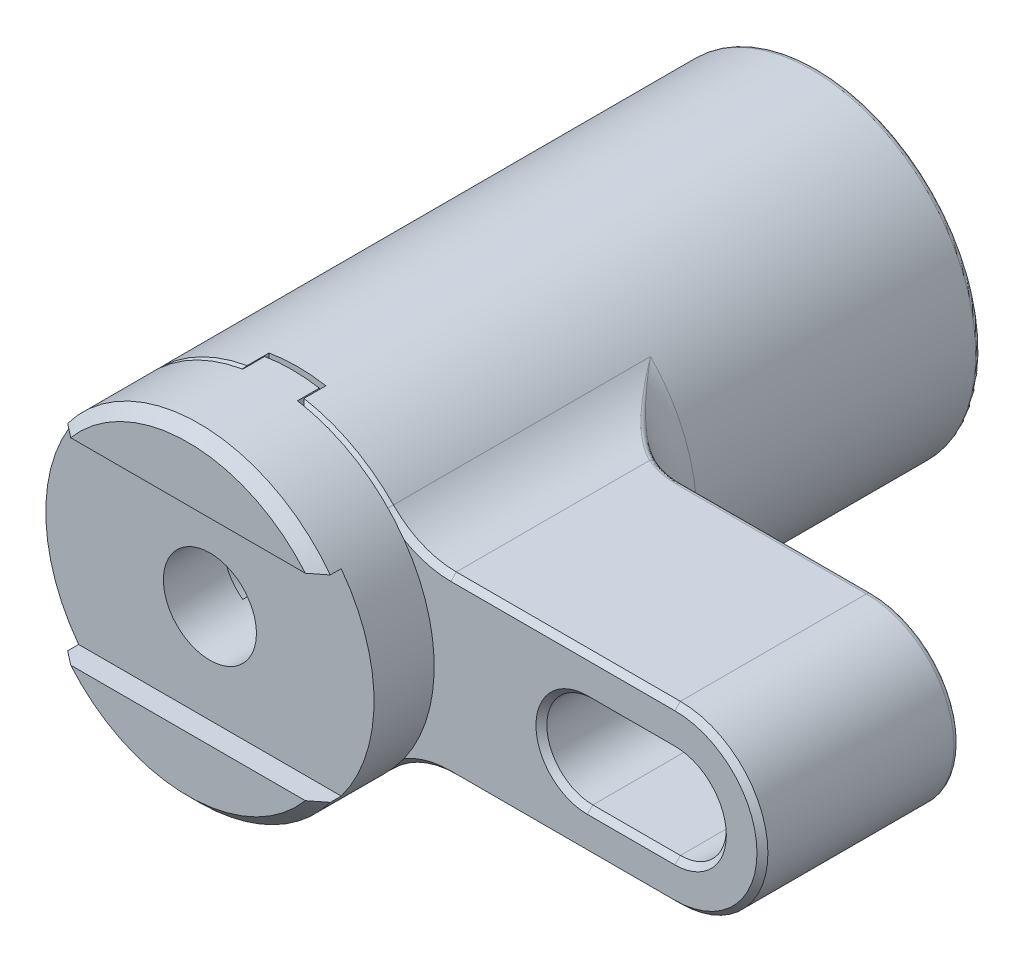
ISO-10303-21;
HEADER;
FILE_DESCRIPTION(('STEP AP214'),'2;1');
FILE_NAME('part.step','',(''),(''),'','','');
FILE_SCHEMA(('AUTOMOTIVE_DESIGN { 1 0 10303 214 1 1 1 1 }'));
ENDSEC;
DATA;
#1=APPLICATION_CONTEXT('core data for automotive mechanical design processes');
#2=APPLICATION_PROTOCOL_DEFINITION('international standard','automotive_design',2000,#1);
#3=PRODUCT_CONTEXT('',#1,'mechanical');
#4=PRODUCT('Part','Part','',(#3));
#5=PRODUCT_RELATED_PRODUCT_CATEGORY('part','',(#4));
#6=PRODUCT_DEFINITION_FORMATION('','',#4);
#7=PRODUCT_DEFINITION_CONTEXT('part definition',#1,'design');
#8=PRODUCT_DEFINITION('design','',#6,#7);
#9=PRODUCT_DEFINITION_SHAPE('','',#8);
#10=(LENGTH_UNIT() NAMED_UNIT(*) SI_UNIT(.MILLI.,.METRE.));
#11=(NAMED_UNIT(*) PLANE_ANGLE_UNIT() SI_UNIT($,.RADIAN.));
#12=(NAMED_UNIT(*) SI_UNIT($,.STERADIAN.) SOLID_ANGLE_UNIT());
#13=UNCERTAINTY_MEASURE_WITH_UNIT(LENGTH_MEASURE(1.E-05),#10,'distance_accuracy_value','');
#14=(GEOMETRIC_REPRESENTATION_CONTEXT(3) GLOBAL_UNCERTAINTY_ASSIGNED_CONTEXT((#13)) GLOBAL_UNIT_ASSIGNED_CONTEXT((#10,
#11,#12)) REPRESENTATION_CONTEXT('',''));
#15=CARTESIAN_POINT('',(0.,0.,0.));
#16=DIRECTION('',(0.,0.,1.));
#17=DIRECTION('',(1.,0.,0.));
#18=AXIS2_PLACEMENT_3D('',#15,#16,#17);
#19=CARTESIAN_POINT('',(0.,0.,50.));
#20=DIRECTION('',(0.,0.,-1.));
#21=DIRECTION('',(0.,-1.,0.));
#22=AXIS2_PLACEMENT_3D('',#19,#20,#21);
#23=CYLINDRICAL_SURFACE('',#22,15.);
#24=CARTESIAN_POINT('',(-14.9596122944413,-1.09999999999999,43.25));
#25=CARTESIAN_POINT('',(-14.8861745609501,-2.09786530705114,42.673882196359));
#26=CARTESIAN_POINT('',(-14.6812686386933,-3.07576838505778,42.1092895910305));
#27=CARTESIAN_POINT('',(-14.4762655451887,-4.05413520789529,41.5444292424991));
#28=CARTESIAN_POINT('',(-14.1431555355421,-4.99711431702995,41.));
#29=B_SPLINE_CURVE_WITH_KNOTS('',2,(#24,#25,#26,#27,#28),.UNSPECIFIED.,.F.,.F.,(3,2,3),(0.,0.5,
1.),.UNSPECIFIED.);
#30=CARTESIAN_POINT('',(-14.9596122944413,-1.1,43.25));
#31=VERTEX_POINT('',#30);
#32=CARTESIAN_POINT('',(-14.1431555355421,-4.99711431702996,41.));
#33=VERTEX_POINT('',#32);
#34=EDGE_CURVE('E532',#31,#33,#29,.T.);
#35=ORIENTED_EDGE('',*,*,#34,.F.);
#36=DIRECTION('',(0.,0.,-1.));
#37=VECTOR('',#36,1.);
#38=CARTESIAN_POINT('',(-14.9596122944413,-1.1,50.));
#39=LINE('',#38,#37);
#40=CARTESIAN_POINT('',(-14.9596122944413,-1.1,42.25));
#41=VERTEX_POINT('',#40);
#42=EDGE_CURVE('E485',#31,#41,#39,.T.);
#43=ORIENTED_EDGE('',*,*,#42,.T.);
#44=CARTESIAN_POINT('',(0.,0.,42.25));
#45=DIRECTION('',(0.,0.,1.));
#46=DIRECTION('',(0.,1.,0.));
#47=AXIS2_PLACEMENT_3D('',#44,#45,#46);
#48=CIRCLE('',#47,15.);
#49=CARTESIAN_POINT('',(-14.1421356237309,5.,42.25));
#50=VERTEX_POINT('',#49);
#51=EDGE_CURVE('E466',#50,#41,#48,.T.);
#52=ORIENTED_EDGE('',*,*,#51,.F.);
#53=DIRECTION('',(0.,0.,-1.));
#54=VECTOR('',#53,1.);
#55=CARTESIAN_POINT('',(-14.1421356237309,5.,50.));
#56=LINE('',#55,#54);
#57=CARTESIAN_POINT('',(-14.1421356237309,5.,39.75));
#58=VERTEX_POINT('',#57);
#59=EDGE_CURVE('E464',#50,#58,#56,.T.);
#60=ORIENTED_EDGE('',*,*,#59,.T.);
#61=CARTESIAN_POINT('',(0.,0.,39.75));
#62=DIRECTION('',(0.,0.,-1.));
#63=DIRECTION('',(0.,-1.,0.));
#64=AXIS2_PLACEMENT_3D('',#61,#62,#63);
#65=CIRCLE('',#64,15.);
#66=CARTESIAN_POINT('',(-14.9596122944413,-1.1,39.75));
#67=VERTEX_POINT('',#66);
#68=EDGE_CURVE('E475',#67,#58,#65,.T.);
#69=ORIENTED_EDGE('',*,*,#68,.F.);
#70=DIRECTION('',(0.,0.,-1.));
#71=VECTOR('',#70,1.);
#72=CARTESIAN_POINT('',(-14.9596122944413,-1.1,50.));
#73=LINE('',#72,#71);
#74=CARTESIAN_POINT('',(-14.9596122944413,-1.1,38.75));
#75=VERTEX_POINT('',#74);
#76=EDGE_CURVE('E474',#67,#75,#73,.T.);
#77=ORIENTED_EDGE('',*,*,#76,.T.);
#78=CARTESIAN_POINT('',(-14.1431555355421,-4.99711431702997,41.));
#79=CARTESIAN_POINT('',(-14.4764247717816,-4.05368446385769,40.4553105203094));
#80=CARTESIAN_POINT('',(-14.6812686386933,-3.0757683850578,39.8907104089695));
#81=CARTESIAN_POINT('',(-14.8862096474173,-2.09738855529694,39.3258425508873));
#82=CARTESIAN_POINT('',(-14.9596122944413,-1.1,38.75));
#83=B_SPLINE_CURVE_WITH_KNOTS('',2,(#78,#79,#80,#81,#82),.UNSPECIFIED.,.F.,.F.,(3,2,3),(0.,0.5,
1.),.UNSPECIFIED.);
#84=EDGE_CURVE('E588',#33,#75,#83,.T.);
#85=ORIENTED_EDGE('',*,*,#84,.F.);
#86=EDGE_LOOP('',(#35,#43,#52,#60,#69,#77,#85));
#87=FACE_BOUND('',#86,.T.);
#88=ADVANCED_FACE('F14',(#87),#23,.T.);
#89=CARTESIAN_POINT('',(-13.8421356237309,5.,50.));
#90=DIRECTION('',(0.,1.,0.));
#91=DIRECTION('',(-1.,0.,0.));
#92=AXIS2_PLACEMENT_3D('',#89,#90,#91);
#93=PLANE('',#92);
#94=ORIENTED_EDGE('',*,*,#59,.F.);
#95=DIRECTION('',(-1.,0.,0.));
#96=VECTOR('',#95,1.);
#97=CARTESIAN_POINT('',(-13.8421356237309,5.,42.25));
#98=LINE('',#97,#96);
#99=CARTESIAN_POINT('',(-13.8421356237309,5.,42.25));
#100=VERTEX_POINT('',#99);
#101=EDGE_CURVE('E449',#100,#50,#98,.T.);
#102=ORIENTED_EDGE('',*,*,#101,.F.);
#103=DIRECTION('',(0.,0.,-1.));
#104=VECTOR('',#103,1.);
#105=CARTESIAN_POINT('',(-13.8421356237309,5.,50.));
#106=LINE('',#105,#104);
#107=CARTESIAN_POINT('',(-13.8421356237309,5.,39.75));
#108=VERTEX_POINT('',#107);
#109=EDGE_CURVE('E461',#100,#108,#106,.T.);
#110=ORIENTED_EDGE('',*,*,#109,.T.);
#111=DIRECTION('',(-1.,0.,0.));
#112=VECTOR('',#111,1.);
#113=CARTESIAN_POINT('',(-13.8421356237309,5.,39.75));
#114=LINE('',#113,#112);
#115=EDGE_CURVE('E473',#108,#58,#114,.T.);
#116=ORIENTED_EDGE('',*,*,#115,.T.);
#117=EDGE_LOOP('',(#94,#102,#110,#116));
#118=FACE_BOUND('',#117,.T.);
#119=ADVANCED_FACE('F459',(#118),#93,.T.);
#120=CARTESIAN_POINT('',(-13.8421356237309,5.,39.75));
#121=DIRECTION('',(0.,0.,1.));
#122=DIRECTION('',(0.,1.,0.));
#123=AXIS2_PLACEMENT_3D('',#120,#121,#122);
#124=PLANE('',#123);
#125=ORIENTED_EDGE('',*,*,#68,.T.);
#126=ORIENTED_EDGE('',*,*,#115,.F.);
#127=CARTESIAN_POINT('',(0.3,0.,39.75));
#128=DIRECTION('',(0.,0.,-1.));
#129=DIRECTION('',(0.,-1.,0.));
#130=AXIS2_PLACEMENT_3D('',#127,#128,#129);
#131=CIRCLE('',#130,15.);
#132=CARTESIAN_POINT('',(-14.6596122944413,-1.1,39.75));
#133=VERTEX_POINT('',#132);
#134=EDGE_CURVE('E472',#133,#108,#131,.T.);
#135=ORIENTED_EDGE('',*,*,#134,.F.);
#136=DIRECTION('',(-1.,0.,0.));
#137=VECTOR('',#136,1.);
#138=CARTESIAN_POINT('',(-14.6596122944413,-1.1,39.75));
#139=LINE('',#138,#137);
#140=EDGE_CURVE('E487',#133,#67,#139,.T.);
#141=ORIENTED_EDGE('',*,*,#140,.T.);
#142=EDGE_LOOP('',(#125,#126,#135,#141));
#143=FACE_BOUND('',#142,.T.);
#144=ADVANCED_FACE('F2354',(#143),#124,.F.);
#145=CARTESIAN_POINT('',(-14.6596122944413,-1.1,50.));
#146=DIRECTION('',(0.,1.,0.));
#147=DIRECTION('',(-1.,0.,0.));
#148=AXIS2_PLACEMENT_3D('',#145,#146,#147);
#149=PLANE('',#148);
#150=ORIENTED_EDGE('',*,*,#76,.F.);
#151=ORIENTED_EDGE('',*,*,#140,.F.);
#152=DIRECTION('',(0.,0.,-1.));
#153=VECTOR('',#152,1.);
#154=CARTESIAN_POINT('',(-14.6596122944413,-1.1,50.));
#155=LINE('',#154,#153);
#156=CARTESIAN_POINT('',(-14.6596122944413,-1.1,38.75));
#157=VERTEX_POINT('',#156);
#158=EDGE_CURVE('E489',#133,#157,#155,.T.);
#159=ORIENTED_EDGE('',*,*,#158,.T.);
#160=DIRECTION('',(-1.,0.,0.));
#161=VECTOR('',#160,1.);
#162=CARTESIAN_POINT('',(-14.6596122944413,-1.1,38.75));
#163=LINE('',#162,#161);
#164=EDGE_CURVE('E591',#157,#75,#163,.T.);
#165=ORIENTED_EDGE('',*,*,#164,.T.);
#166=EDGE_LOOP('',(#150,#151,#159,#165));
#167=FACE_BOUND('',#166,.T.);
#168=ADVANCED_FACE('F568',(#167),#149,.T.);
#169=CARTESIAN_POINT('',(-14.6596122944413,-1.1,38.75));
#170=DIRECTION('',(0.,0.5,0.866025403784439));
#171=DIRECTION('',(0.,0.866025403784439,-0.5));
#172=AXIS2_PLACEMENT_3D('',#169,#170,#171);
#173=PLANE('',#172);
#174=ORIENTED_EDGE('',*,*,#84,.T.);
#175=ORIENTED_EDGE('',*,*,#164,.F.);
#176=CARTESIAN_POINT('',(-13.8431555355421,-4.99711431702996,41.));
#177=CARTESIAN_POINT('',(-13.8953608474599,-4.84935928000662,40.9146890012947));
#178=CARTESIAN_POINT('',(-13.9451838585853,-4.7009758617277,40.8290100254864));
#179=CARTESIAN_POINT('',(-14.0421771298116,-4.396432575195,40.6531634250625));
#180=CARTESIAN_POINT('',(-14.0891302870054,-4.24022079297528,40.5629658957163));
#181=CARTESIAN_POINT('',(-14.1797263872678,-3.91999750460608,40.3780827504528));
#182=CARTESIAN_POINT('',(-14.2231425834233,-3.75593761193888,40.2833698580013));
#183=CARTESIAN_POINT('',(-14.3059764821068,-3.42002716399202,40.0894563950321));
#184=CARTESIAN_POINT('',(-14.3451577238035,-3.24813263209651,39.9902308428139));
#185=CARTESIAN_POINT('',(-14.4113800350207,-2.93204097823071,39.8077244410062));
#186=CARTESIAN_POINT('',(-14.4393565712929,-2.78798696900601,39.7245334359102));
#187=CARTESIAN_POINT('',(-14.4933895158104,-2.48620353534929,39.5502596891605));
#188=CARTESIAN_POINT('',(-14.5190412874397,-2.32841940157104,39.4591458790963));
#189=CARTESIAN_POINT('',(-14.5671929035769,-1.99912909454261,39.2690270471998));
#190=CARTESIAN_POINT('',(-14.5892529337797,-1.82757347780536,39.1699961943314));
#191=CARTESIAN_POINT('',(-14.6288813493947,-1.4707662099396,38.9640330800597));
#192=CARTESIAN_POINT('',(-14.6459745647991,-1.2854747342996,38.8570781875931));
#193=CARTESIAN_POINT('',(-14.6596122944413,-1.09999999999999,38.75));
#194=B_SPLINE_CURVE_WITH_KNOTS('',3,(#176,#177,#178,#179,#180,#181,#182,#183,#184,#185,#186,
#187,#188,#189,#190,#191,#192,#193),.UNSPECIFIED.,.F.,.F.,(4,2,2,2,2,2,2,2,4),(0.,
0.535252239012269,1.09435290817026,1.67731125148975,2.28413539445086,2.79014091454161,
3.34206516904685,3.93990998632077,4.58367659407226),.UNSPECIFIED.);
#195=CARTESIAN_POINT('',(-13.8431555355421,-4.99711431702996,41.));
#196=VERTEX_POINT('',#195);
#197=EDGE_CURVE('E482',#196,#157,#194,.T.);
#198=ORIENTED_EDGE('',*,*,#197,.F.);
#199=DIRECTION('',(-1.,0.,0.));
#200=VECTOR('',#199,1.);
#201=CARTESIAN_POINT('',(-13.8431555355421,-4.99711431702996,41.));
#202=LINE('',#201,#200);
#203=EDGE_CURVE('E586',#196,#33,#202,.T.);
#204=ORIENTED_EDGE('',*,*,#203,.T.);
#205=EDGE_LOOP('',(#174,#175,#198,#204));
#206=FACE_BOUND('',#205,.T.);
#207=ADVANCED_FACE('F559',(#206),#173,.F.);
#208=CARTESIAN_POINT('',(-13.8431555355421,-4.99711431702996,41.));
#209=DIRECTION('',(0.,0.5,-0.866025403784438));
#210=DIRECTION('',(0.,-0.866025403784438,-0.5));
#211=AXIS2_PLACEMENT_3D('',#208,#209,#210);
#212=PLANE('',#211);
#213=ORIENTED_EDGE('',*,*,#34,.T.);
#214=ORIENTED_EDGE('',*,*,#203,.F.);
#215=CARTESIAN_POINT('',(-14.6596122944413,-1.09999999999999,43.25));
#216=CARTESIAN_POINT('',(-14.6459740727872,-1.28548142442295,43.1429179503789));
#217=CARTESIAN_POINT('',(-14.6288801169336,-1.47077956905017,43.0359591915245));
#218=CARTESIAN_POINT('',(-14.5892502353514,-1.82759567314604,42.8299909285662));
#219=CARTESIAN_POINT('',(-14.5671896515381,-1.99915347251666,42.7309587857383));
#220=CARTESIAN_POINT('',(-14.5190374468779,-2.3284436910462,42.5408399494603));
#221=CARTESIAN_POINT('',(-14.4933857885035,-2.48622557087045,42.449727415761));
#222=CARTESIAN_POINT('',(-14.4393540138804,-2.7880001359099,42.2754588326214));
#223=CARTESIAN_POINT('',(-14.411378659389,-2.93204754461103,42.1922716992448));
#224=CARTESIAN_POINT('',(-14.3451568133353,-3.24813697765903,42.0097667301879));
#225=CARTESIAN_POINT('',(-14.3059745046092,-3.42003583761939,41.9105387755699));
#226=CARTESIAN_POINT('',(-14.2231388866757,-3.75595197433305,41.7166221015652));
#227=CARTESIAN_POINT('',(-14.1797221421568,-3.92001324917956,41.6219083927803));
#228=CARTESIAN_POINT('',(-14.0891256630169,-4.24023642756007,41.4370252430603));
#229=CARTESIAN_POINT('',(-14.0421727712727,-4.39644673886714,41.3468285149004));
#230=CARTESIAN_POINT('',(-13.9451810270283,-4.70098429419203,41.1709851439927));
#231=CARTESIAN_POINT('',(-13.8953593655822,-4.84936347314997,41.0853085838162));
#232=CARTESIAN_POINT('',(-13.8431555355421,-4.99711431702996,41.));
#233=B_SPLINE_CURVE_WITH_KNOTS('',3,(#215,#216,#217,#218,#219,#220,#221,#222,#223,#224,#225,
#226,#227,#228,#229,#230,#231,#232),.UNSPECIFIED.,.F.,.F.,(4,2,2,2,2,2,2,2,4),(0.,
0.643789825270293,1.2416423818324,1.79355889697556,2.2995411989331,2.90638052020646,
3.48934392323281,4.04843953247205,4.58367659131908),.UNSPECIFIED.);
#234=CARTESIAN_POINT('',(-14.6596122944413,-1.1,43.25));
#235=VERTEX_POINT('',#234);
#236=EDGE_CURVE('E456',#235,#196,#233,.T.);
#237=ORIENTED_EDGE('',*,*,#236,.F.);
#238=DIRECTION('',(-1.,0.,0.));
#239=VECTOR('',#238,1.);
#240=CARTESIAN_POINT('',(-14.6596122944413,-1.1,43.25));
#241=LINE('',#240,#239);
#242=EDGE_CURVE('E552',#235,#31,#241,.T.);
#243=ORIENTED_EDGE('',*,*,#242,.T.);
#244=EDGE_LOOP('',(#213,#214,#237,#243));
#245=FACE_BOUND('',#244,.T.);
#246=ADVANCED_FACE('F16',(#245),#212,.F.);
#247=CARTESIAN_POINT('',(-14.6596122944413,-1.1,50.));
#248=DIRECTION('',(0.,1.,0.));
#249=DIRECTION('',(-1.,0.,0.));
#250=AXIS2_PLACEMENT_3D('',#247,#248,#249);
#251=PLANE('',#250);
#252=ORIENTED_EDGE('',*,*,#42,.F.);
#253=ORIENTED_EDGE('',*,*,#242,.F.);
#254=DIRECTION('',(0.,0.,-1.));
#255=VECTOR('',#254,1.);
#256=CARTESIAN_POINT('',(-14.6596122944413,-1.1,50.));
#257=LINE('',#256,#255);
#258=CARTESIAN_POINT('',(-14.6596122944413,-1.1,42.25));
#259=VERTEX_POINT('',#258);
#260=EDGE_CURVE('E492',#235,#259,#257,.T.);
#261=ORIENTED_EDGE('',*,*,#260,.T.);
#262=DIRECTION('',(-1.,0.,0.));
#263=VECTOR('',#262,1.);
#264=CARTESIAN_POINT('',(-14.6596122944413,-1.1,42.25));
#265=LINE('',#264,#263);
#266=EDGE_CURVE('E452',#259,#41,#265,.T.);
#267=ORIENTED_EDGE('',*,*,#266,.T.);
#268=EDGE_LOOP('',(#252,#253,#261,#267));
#269=FACE_BOUND('',#268,.T.);
#270=ADVANCED_FACE('F513',(#269),#251,.T.);
#271=CARTESIAN_POINT('',(-14.6596122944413,-1.1,42.25));
#272=DIRECTION('',(0.,0.,-1.));
#273=DIRECTION('',(0.,-1.,0.));
#274=AXIS2_PLACEMENT_3D('',#271,#272,#273);
#275=PLANE('',#274);
#276=ORIENTED_EDGE('',*,*,#51,.T.);
#277=ORIENTED_EDGE('',*,*,#266,.F.);
#278=CARTESIAN_POINT('',(0.3,0.,42.25));
#279=DIRECTION('',(0.,0.,1.));
#280=DIRECTION('',(0.,1.,0.));
#281=AXIS2_PLACEMENT_3D('',#278,#279,#280);
#282=CIRCLE('',#281,15.);
#283=EDGE_CURVE('E19',#100,#259,#282,.T.);
#284=ORIENTED_EDGE('',*,*,#283,.F.);
#285=ORIENTED_EDGE('',*,*,#101,.T.);
#286=EDGE_LOOP('',(#276,#277,#284,#285));
#287=FACE_BOUND('',#286,.T.);
#288=ADVANCED_FACE('F448',(#287),#275,.F.);
#289=CARTESIAN_POINT('',(0.,0.,32.));
#290=DIRECTION('',(0.,0.,1.));
#291=DIRECTION('',(0.,1.,0.));
#292=AXIS2_PLACEMENT_3D('',#289,#290,#291);
#293=PLANE('',#292);
#294=CARTESIAN_POINT('',(29.,0.,32.));
#295=DIRECTION('',(0.,0.,1.));
#296=DIRECTION('',(0.,1.,0.));
#297=AXIS2_PLACEMENT_3D('',#294,#295,#296);
#298=CIRCLE('',#297,4.7);
#299=CARTESIAN_POINT('',(29.,4.7,32.));
#300=VERTEX_POINT('',#299);
#301=CARTESIAN_POINT('',(29.,-4.7,32.));
#302=VERTEX_POINT('',#301);
#303=EDGE_CURVE('E465',#300,#302,#298,.T.);
#304=ORIENTED_EDGE('',*,*,#303,.T.);
#305=DIRECTION('',(1.,0.,0.));
#306=VECTOR('',#305,1.);
#307=CARTESIAN_POINT('',(0.,-4.7,32.));
#308=LINE('',#307,#306);
#309=CARTESIAN_POINT('',(37.,-4.7,32.));
#310=VERTEX_POINT('',#309);
#311=EDGE_CURVE('E1033',#302,#310,#308,.T.);
#312=ORIENTED_EDGE('',*,*,#311,.T.);
#313=CARTESIAN_POINT('',(37.,0.,32.));
#314=DIRECTION('',(0.,0.,1.));
#315=DIRECTION('',(0.,1.,0.));
#316=AXIS2_PLACEMENT_3D('',#313,#314,#315);
#317=CIRCLE('',#316,4.7);
#318=CARTESIAN_POINT('',(37.,4.7,32.));
#319=VERTEX_POINT('',#318);
#320=EDGE_CURVE('E839',#310,#319,#317,.T.);
#321=ORIENTED_EDGE('',*,*,#320,.T.);
#322=DIRECTION('',(-1.,0.,0.));
#323=VECTOR('',#322,1.);
#324=CARTESIAN_POINT('',(0.,4.7,32.));
#325=LINE('',#324,#323);
#326=EDGE_CURVE('E1036',#319,#300,#325,.T.);
#327=ORIENTED_EDGE('',*,*,#326,.T.);
#328=EDGE_LOOP('',(#304,#312,#321,#327));
#329=FACE_BOUND('',#328,.T.);
#330=CARTESIAN_POINT('',(37.,0.,32.));
#331=DIRECTION('',(0.,0.,1.));
#332=DIRECTION('',(0.,1.,0.));
#333=AXIS2_PLACEMENT_3D('',#330,#331,#332);
#334=CIRCLE('',#333,7.5);
#335=CARTESIAN_POINT('',(37.,7.5,32.));
#336=VERTEX_POINT('',#335);
#337=CARTESIAN_POINT('',(37.,-7.5,32.));
#338=VERTEX_POINT('',#337);
#339=EDGE_CURVE('E936',#336,#338,#334,.F.);
#340=ORIENTED_EDGE('',*,*,#339,.T.);
#341=DIRECTION('',(1.,0.,0.));
#342=VECTOR('',#341,1.);
#343=CARTESIAN_POINT('',(0.,-7.5,32.));
#344=LINE('',#343,#342);
#345=CARTESIAN_POINT('',(19.6150452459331,-7.5,32.));
#346=VERTEX_POINT('',#345);
#347=EDGE_CURVE('E1040',#338,#346,#344,.F.);
#348=ORIENTED_EDGE('',*,*,#347,.T.);
#349=CARTESIAN_POINT('',(0.,0.,32.));
#350=DIRECTION('',(0.,0.,1.));
#351=DIRECTION('',(0.,1.,0.));
#352=AXIS2_PLACEMENT_3D('',#349,#350,#351);
#353=CIRCLE('',#352,21.);
#354=CARTESIAN_POINT('',(19.6150452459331,7.5,32.));
#355=VERTEX_POINT('',#354);
#356=EDGE_CURVE('E1624',#346,#355,#353,.T.);
#357=ORIENTED_EDGE('',*,*,#356,.T.);
#358=DIRECTION('',(-1.,0.,0.));
#359=VECTOR('',#358,1.);
#360=CARTESIAN_POINT('',(0.,7.5,32.));
#361=LINE('',#360,#359);
#362=EDGE_CURVE('E664',#355,#336,#361,.F.);
#363=ORIENTED_EDGE('',*,*,#362,.T.);
#364=EDGE_LOOP('',(#340,#348,#357,#363));
#365=FACE_BOUND('',#364,.T.);
#366=ADVANCED_FACE('F1042',(#329,#365),#293,.F.);
#367=CARTESIAN_POINT('',(0.,0.,0.));
#368=DIRECTION('',(0.,0.,1.));
#369=DIRECTION('',(0.,1.,0.));
#370=AXIS2_PLACEMENT_3D('',#367,#368,#369);
#371=PLANE('',#370);
#372=CARTESIAN_POINT('',(0.,0.,0.));
#373=DIRECTION('',(0.,0.,1.));
#374=DIRECTION('',(0.,1.,0.));
#375=AXIS2_PLACEMENT_3D('',#372,#373,#374);
#376=CIRCLE('',#375,11.5);
#377=CARTESIAN_POINT('',(0.,11.5,0.));
#378=VERTEX_POINT('',#377);
#379=EDGE_CURVE('E660',#378,#378,#376,.T.);
#380=ORIENTED_EDGE('',*,*,#379,.T.);
#381=EDGE_LOOP('',(#380));
#382=FACE_BOUND('',#381,.T.);
#383=CARTESIAN_POINT('',(0.,0.,0.));
#384=DIRECTION('',(0.,0.,1.));
#385=DIRECTION('',(0.,1.,0.));
#386=AXIS2_PLACEMENT_3D('',#383,#384,#385);
#387=CIRCLE('',#386,14.5);
#388=CARTESIAN_POINT('',(0.,14.5,0.));
#389=VERTEX_POINT('',#388);
#390=EDGE_CURVE('E663',#389,#389,#387,.F.);
#391=ORIENTED_EDGE('',*,*,#390,.T.);
#392=EDGE_LOOP('',(#391));
#393=FACE_BOUND('',#392,.T.);
#394=ADVANCED_FACE('F1140',(#382,#393),#371,.F.);
#395=CARTESIAN_POINT('',(0.3,0.,50.));
#396=DIRECTION('',(0.,0.,-1.));
#397=DIRECTION('',(0.,-1.,0.));
#398=AXIS2_PLACEMENT_3D('',#395,#396,#397);
#399=CYLINDRICAL_SURFACE('',#398,15.);
#400=DIRECTION('',(0.,0.,-1.));
#401=VECTOR('',#400,1.);
#402=CARTESIAN_POINT('',(-13.4477270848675,-6.,50.));
#403=LINE('',#402,#401);
#404=CARTESIAN_POINT('',(-13.4477270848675,-6.,42.75));
#405=VERTEX_POINT('',#404);
#406=CARTESIAN_POINT('',(-13.4477270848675,-6.,39.25));
#407=VERTEX_POINT('',#406);
#408=EDGE_CURVE('E1243',#405,#407,#403,.T.);
#409=ORIENTED_EDGE('',*,*,#408,.F.);
#410=CARTESIAN_POINT('',(-13.8421356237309,-5.,43.75));
#411=CARTESIAN_POINT('',(-13.800113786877,-5.11885570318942,43.75));
#412=CARTESIAN_POINT('',(-13.7559369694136,-5.23877873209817,43.7283021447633));
#413=CARTESIAN_POINT('',(-13.7134853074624,-5.34997472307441,43.6867591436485));
#414=CARTESIAN_POINT('',(-13.6710156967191,-5.4612177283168,43.6451985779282));
#415=CARTESIAN_POINT('',(-13.6290636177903,-5.56693838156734,43.5825375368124));
#416=CARTESIAN_POINT('',(-13.5920761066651,-5.65775763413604,43.5032296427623));
#417=CARTESIAN_POINT('',(-13.5558000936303,-5.74682987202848,43.425447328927));
#418=CARTESIAN_POINT('',(-13.523257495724,-5.8242104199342,43.3291212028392));
#419=CARTESIAN_POINT('',(-13.4988501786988,-5.88147377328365,43.2222329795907));
#420=CARTESIAN_POINT('',(-13.4761210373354,-5.9347998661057,43.1226940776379));
#421=CARTESIAN_POINT('',(-13.4598396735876,-5.9721983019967,43.0108533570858));
#422=CARTESIAN_POINT('',(-13.452473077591,-5.98911381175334,42.8971525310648));
#423=CARTESIAN_POINT('',(-13.4493259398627,-5.99634041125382,42.84857756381));
#424=CARTESIAN_POINT('',(-13.4477270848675,-6.,42.7992103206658));
#425=CARTESIAN_POINT('',(-13.4477270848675,-6.,42.75));
#426=B_SPLINE_CURVE_WITH_KNOTS('',3,(#410,#411,#412,#413,#414,#415,#416,#417,#418,#419,#420,
#421,#422,#423,#424,#425),.UNSPECIFIED.,.F.,.F.,(4,3,3,3,3,4),(0.,0.233472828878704,
0.467152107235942,0.696551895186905,0.910056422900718,1.),.UNSPECIFIED.);
#427=CARTESIAN_POINT('',(-13.8421356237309,-5.,43.75));
#428=VERTEX_POINT('',#427);
#429=EDGE_CURVE('E1119',#428,#405,#426,.T.);
#430=ORIENTED_EDGE('',*,*,#429,.F.);
#431=CARTESIAN_POINT('',(0.3,0.,43.75));
#432=DIRECTION('',(0.,0.,1.));
#433=DIRECTION('',(0.,1.,0.));
#434=AXIS2_PLACEMENT_3D('',#431,#432,#433);
#435=CIRCLE('',#434,15.);
#436=CARTESIAN_POINT('',(-13.8421356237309,5.,43.75));
#437=VERTEX_POINT('',#436);
#438=EDGE_CURVE('E1296',#437,#428,#435,.T.);
#439=ORIENTED_EDGE('',*,*,#438,.F.);
#440=CARTESIAN_POINT('',(-13.4477270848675,6.,42.75));
#441=CARTESIAN_POINT('',(-13.4477270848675,6.,42.8553752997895));
#442=CARTESIAN_POINT('',(-13.4552707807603,5.98279041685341,42.9622013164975));
#443=CARTESIAN_POINT('',(-13.4693260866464,5.95026546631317,43.0614410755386));
#444=CARTESIAN_POINT('',(-13.4833613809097,5.91778682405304,43.1605395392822));
#445=CARTESIAN_POINT('',(-13.5041894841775,5.86929208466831,43.2547456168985));
#446=CARTESIAN_POINT('',(-13.5293984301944,5.80928042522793,43.337422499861));
#447=CARTESIAN_POINT('',(-13.5555786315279,5.74695662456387,43.4232847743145));
#448=CARTESIAN_POINT('',(-13.5870856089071,5.67072123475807,43.4989552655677));
#449=CARTESIAN_POINT('',(-13.6208646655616,5.58654875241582,43.5599139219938));
#450=CARTESIAN_POINT('',(-13.6572676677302,5.49583778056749,43.6256078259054));
#451=CARTESIAN_POINT('',(-13.6972111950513,5.39360118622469,43.6759320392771));
#452=CARTESIAN_POINT('',(-13.7371775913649,5.28749896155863,43.7077809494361));
#453=CARTESIAN_POINT('',(-13.7721272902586,5.19471499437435,43.7356320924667));
#454=CARTESIAN_POINT('',(-13.8078070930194,5.09709574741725,43.75));
#455=CARTESIAN_POINT('',(-13.8421356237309,5.,43.75));
#456=B_SPLINE_CURVE_WITH_KNOTS('',3,(#440,#441,#442,#443,#444,#445,#446,#447,#448,#449,#450,
#451,#452,#453,#454,#455),.UNSPECIFIED.,.F.,.F.,(4,3,3,3,3,4),(0.,0.195166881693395,
0.389839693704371,0.591945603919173,0.809955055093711,1.),.UNSPECIFIED.);
#457=CARTESIAN_POINT('',(-13.4477270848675,6.,42.75));
#458=VERTEX_POINT('',#457);
#459=EDGE_CURVE('E1289',#458,#437,#456,.T.);
#460=ORIENTED_EDGE('',*,*,#459,.F.);
#461=DIRECTION('',(0.,0.,-1.));
#462=VECTOR('',#461,1.);
#463=CARTESIAN_POINT('',(-13.4477270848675,6.,50.));
#464=LINE('',#463,#462);
#465=CARTESIAN_POINT('',(-13.4477270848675,6.,39.25));
#466=VERTEX_POINT('',#465);
#467=EDGE_CURVE('E457',#458,#466,#464,.T.);
#468=ORIENTED_EDGE('',*,*,#467,.T.);
#469=CARTESIAN_POINT('',(-13.8421356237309,5.,38.25));
#470=CARTESIAN_POINT('',(-13.800113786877,5.11885570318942,38.25));
#471=CARTESIAN_POINT('',(-13.7559369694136,5.23877873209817,38.2716978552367));
#472=CARTESIAN_POINT('',(-13.7134853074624,5.34997472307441,38.3132408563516));
#473=CARTESIAN_POINT('',(-13.6710156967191,5.4612177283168,38.3548014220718));
#474=CARTESIAN_POINT('',(-13.6290636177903,5.56693838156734,38.4174624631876));
#475=CARTESIAN_POINT('',(-13.5920761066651,5.65775763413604,38.4967703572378));
#476=CARTESIAN_POINT('',(-13.5558000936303,5.74682987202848,38.574552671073));
#477=CARTESIAN_POINT('',(-13.523257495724,5.8242104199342,38.6708787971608));
#478=CARTESIAN_POINT('',(-13.4988501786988,5.88147377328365,38.7777670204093));
#479=CARTESIAN_POINT('',(-13.4761210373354,5.9347998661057,38.8773059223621));
#480=CARTESIAN_POINT('',(-13.4598396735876,5.9721983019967,38.9891466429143));
#481=CARTESIAN_POINT('',(-13.452473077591,5.98911381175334,39.1028474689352));
#482=CARTESIAN_POINT('',(-13.4493259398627,5.99634041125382,39.15142243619));
#483=CARTESIAN_POINT('',(-13.4477270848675,6.,39.2007896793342));
#484=CARTESIAN_POINT('',(-13.4477270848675,6.,39.25));
#485=B_SPLINE_CURVE_WITH_KNOTS('',3,(#469,#470,#471,#472,#473,#474,#475,#476,#477,#478,#479,
#480,#481,#482,#483,#484),.UNSPECIFIED.,.F.,.F.,(4,3,3,3,3,4),(0.,0.233472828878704,
0.467152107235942,0.696551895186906,0.910056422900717,1.),.UNSPECIFIED.);
#486=CARTESIAN_POINT('',(-13.8421356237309,5.,38.25));
#487=VERTEX_POINT('',#486);
#488=EDGE_CURVE('E1181',#487,#466,#485,.T.);
#489=ORIENTED_EDGE('',*,*,#488,.F.);
#490=CARTESIAN_POINT('',(0.3,0.,38.25));
#491=DIRECTION('',(0.,0.,-1.));
#492=DIRECTION('',(0.,-1.,0.));
#493=AXIS2_PLACEMENT_3D('',#490,#491,#492);
#494=CIRCLE('',#493,15.);
#495=CARTESIAN_POINT('',(-13.8421356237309,-5.,38.25));
#496=VERTEX_POINT('',#495);
#497=EDGE_CURVE('E1265',#496,#487,#494,.T.);
#498=ORIENTED_EDGE('',*,*,#497,.F.);
#499=CARTESIAN_POINT('',(-13.4477270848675,-6.,39.25));
#500=CARTESIAN_POINT('',(-13.4477270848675,-6.,39.1446247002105));
#501=CARTESIAN_POINT('',(-13.4552707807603,-5.98279041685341,39.0377986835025));
#502=CARTESIAN_POINT('',(-13.4693260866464,-5.95026546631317,38.9385589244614));
#503=CARTESIAN_POINT('',(-13.4833613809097,-5.91778682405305,38.8394604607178));
#504=CARTESIAN_POINT('',(-13.5041894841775,-5.86929208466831,38.7452543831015));
#505=CARTESIAN_POINT('',(-13.5293984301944,-5.80928042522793,38.662577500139));
#506=CARTESIAN_POINT('',(-13.5555786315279,-5.74695662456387,38.5767152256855));
#507=CARTESIAN_POINT('',(-13.5870856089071,-5.67072123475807,38.5010447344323));
#508=CARTESIAN_POINT('',(-13.6208646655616,-5.58654875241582,38.4400860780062));
#509=CARTESIAN_POINT('',(-13.6572676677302,-5.49583778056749,38.3743921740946));
#510=CARTESIAN_POINT('',(-13.6972111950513,-5.39360118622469,38.3240679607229));
#511=CARTESIAN_POINT('',(-13.7371775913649,-5.28749896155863,38.2922190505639));
#512=CARTESIAN_POINT('',(-13.7721272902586,-5.19471499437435,38.2643679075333));
#513=CARTESIAN_POINT('',(-13.8078070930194,-5.09709574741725,38.25));
#514=CARTESIAN_POINT('',(-13.8421356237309,-5.,38.25));
#515=B_SPLINE_CURVE_WITH_KNOTS('',3,(#499,#500,#501,#502,#503,#504,#505,#506,#507,#508,#509,
#510,#511,#512,#513,#514),.UNSPECIFIED.,.F.,.F.,(4,3,3,3,3,4),(0.,0.195166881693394,
0.389839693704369,0.591945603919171,0.809955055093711,1.),.UNSPECIFIED.);
#516=EDGE_CURVE('E1253',#407,#496,#515,.T.);
#517=ORIENTED_EDGE('',*,*,#516,.F.);
#518=EDGE_LOOP('',(#409,#430,#439,#460,#468,#489,#498,#517));
#519=FACE_BOUND('',#518,.T.);
#520=ORIENTED_EDGE('',*,*,#283,.T.);
#521=ORIENTED_EDGE('',*,*,#260,.F.);
#522=ORIENTED_EDGE('',*,*,#236,.T.);
#523=ORIENTED_EDGE('',*,*,#197,.T.);
#524=ORIENTED_EDGE('',*,*,#158,.F.);
#525=ORIENTED_EDGE('',*,*,#134,.T.);
#526=ORIENTED_EDGE('',*,*,#109,.F.);
#527=EDGE_LOOP('',(#520,#521,#522,#523,#524,#525,#526));
#528=FACE_BOUND('',#527,.T.);
#529=ADVANCED_FACE('F469',(#519,#528),#399,.T.);
#530=CARTESIAN_POINT('',(0.,0.,1.5));
#531=DIRECTION('',(0.,0.,1.));
#532=DIRECTION('',(0.,1.,0.));
#533=AXIS2_PLACEMENT_3D('',#530,#531,#532);
#534=TOROIDAL_SURFACE('',#533,11.5,1.5);
#535=CARTESIAN_POINT('',(0.,0.,1.5));
#536=DIRECTION('',(0.,0.,1.));
#537=DIRECTION('',(0.,1.,0.));
#538=AXIS2_PLACEMENT_3D('',#535,#536,#537);
#539=CIRCLE('',#538,10.);
#540=CARTESIAN_POINT('',(0.,10.,1.5));
#541=VERTEX_POINT('',#540);
#542=EDGE_CURVE('E655',#541,#541,#539,.F.);
#543=ORIENTED_EDGE('',*,*,#542,.F.);
#544=EDGE_LOOP('',(#543));
#545=FACE_BOUND('',#544,.T.);
#546=ORIENTED_EDGE('',*,*,#379,.F.);
#547=EDGE_LOOP('',(#546));
#548=FACE_BOUND('',#547,.T.);
#549=ADVANCED_FACE('F825',(#545,#548),#534,.T.);
#550=CARTESIAN_POINT('',(0.,-4.7,32.5));
#551=DIRECTION('',(1.,0.,0.));
#552=DIRECTION('',(0.,1.,0.));
#553=AXIS2_PLACEMENT_3D('',#550,#551,#552);
#554=CYLINDRICAL_SURFACE('',#553,0.5);
#555=CARTESIAN_POINT('',(29.,-4.7,32.5));
#556=DIRECTION('',(1.,0.,0.));
#557=DIRECTION('',(0.,1.,0.));
#558=AXIS2_PLACEMENT_3D('',#555,#556,#557);
#559=CIRCLE('',#558,0.5);
#560=CARTESIAN_POINT('',(29.,-4.2,32.5));
#561=VERTEX_POINT('',#560);
#562=EDGE_CURVE('E481',#302,#561,#559,.T.);
#563=ORIENTED_EDGE('',*,*,#562,.T.);
#564=DIRECTION('',(1.,0.,0.));
#565=VECTOR('',#564,1.);
#566=CARTESIAN_POINT('',(29.,-4.2,32.5));
#567=LINE('',#566,#565);
#568=CARTESIAN_POINT('',(37.,-4.2,32.5));
#569=VERTEX_POINT('',#568);
#570=EDGE_CURVE('E679',#569,#561,#567,.F.);
#571=ORIENTED_EDGE('',*,*,#570,.F.);
#572=CARTESIAN_POINT('',(37.,-4.7,32.5));
#573=DIRECTION('',(-1.,0.,0.));
#574=DIRECTION('',(0.,-1.,0.));
#575=AXIS2_PLACEMENT_3D('',#572,#573,#574);
#576=CIRCLE('',#575,0.5);
#577=EDGE_CURVE('E1025',#569,#310,#576,.T.);
#578=ORIENTED_EDGE('',*,*,#577,.T.);
#579=ORIENTED_EDGE('',*,*,#311,.F.);
#580=EDGE_LOOP('',(#563,#571,#578,#579));
#581=FACE_BOUND('',#580,.T.);
#582=ADVANCED_FACE('F821',(#581),#554,.T.);
#583=CARTESIAN_POINT('',(37.,0.,32.5));
#584=DIRECTION('',(0.,0.,1.));
#585=DIRECTION('',(0.,1.,0.));
#586=AXIS2_PLACEMENT_3D('',#583,#584,#585);
#587=TOROIDAL_SURFACE('',#586,4.7,0.5);
#588=CARTESIAN_POINT('',(37.,4.7,32.5));
#589=DIRECTION('',(1.,0.,0.));
#590=DIRECTION('',(0.,1.,0.));
#591=AXIS2_PLACEMENT_3D('',#588,#589,#590);
#592=CIRCLE('',#591,0.5);
#593=CARTESIAN_POINT('',(37.,4.2,32.5));
#594=VERTEX_POINT('',#593);
#595=EDGE_CURVE('E1022',#594,#319,#592,.T.);
#596=ORIENTED_EDGE('',*,*,#595,.T.);
#597=ORIENTED_EDGE('',*,*,#320,.F.);
#598=ORIENTED_EDGE('',*,*,#577,.F.);
#599=CARTESIAN_POINT('',(37.,0.,32.5));
#600=DIRECTION('',(0.,0.,1.));
#601=DIRECTION('',(0.,1.,0.));
#602=AXIS2_PLACEMENT_3D('',#599,#600,#601);
#603=CIRCLE('',#602,4.2);
#604=EDGE_CURVE('E683',#594,#569,#603,.F.);
#605=ORIENTED_EDGE('',*,*,#604,.F.);
#606=EDGE_LOOP('',(#596,#597,#598,#605));
#607=FACE_BOUND('',#606,.T.);
#608=ADVANCED_FACE('F813',(#607),#587,.T.);
#609=CARTESIAN_POINT('',(0.,4.7,32.5));
#610=DIRECTION('',(-1.,0.,0.));
#611=DIRECTION('',(0.,-1.,0.));
#612=AXIS2_PLACEMENT_3D('',#609,#610,#611);
#613=CYLINDRICAL_SURFACE('',#612,0.5);
#614=ORIENTED_EDGE('',*,*,#595,.F.);
#615=DIRECTION('',(-1.,0.,0.));
#616=VECTOR('',#615,1.);
#617=CARTESIAN_POINT('',(29.,4.2,32.5));
#618=LINE('',#617,#616);
#619=CARTESIAN_POINT('',(29.,4.2,32.5));
#620=VERTEX_POINT('',#619);
#621=EDGE_CURVE('E703',#620,#594,#618,.F.);
#622=ORIENTED_EDGE('',*,*,#621,.F.);
#623=CARTESIAN_POINT('',(29.,4.7,32.5));
#624=DIRECTION('',(-1.,0.,0.));
#625=DIRECTION('',(0.,-1.,0.));
#626=AXIS2_PLACEMENT_3D('',#623,#624,#625);
#627=CIRCLE('',#626,0.5);
#628=EDGE_CURVE('E1018',#300,#620,#627,.T.);
#629=ORIENTED_EDGE('',*,*,#628,.F.);
#630=ORIENTED_EDGE('',*,*,#326,.F.);
#631=EDGE_LOOP('',(#614,#622,#629,#630));
#632=FACE_BOUND('',#631,.T.);
#633=ADVANCED_FACE('F809',(#632),#613,.T.);
#634=CARTESIAN_POINT('',(29.,0.,32.5));
#635=DIRECTION('',(0.,0.,1.));
#636=DIRECTION('',(0.,1.,0.));
#637=AXIS2_PLACEMENT_3D('',#634,#635,#636);
#638=TOROIDAL_SURFACE('',#637,4.7,0.5);
#639=ORIENTED_EDGE('',*,*,#628,.T.);
#640=CARTESIAN_POINT('',(29.,0.,32.5));
#641=DIRECTION('',(0.,0.,1.));
#642=DIRECTION('',(0.,1.,0.));
#643=AXIS2_PLACEMENT_3D('',#640,#641,#642);
#644=CIRCLE('',#643,4.2);
#645=EDGE_CURVE('E687',#561,#620,#644,.F.);
#646=ORIENTED_EDGE('',*,*,#645,.F.);
#647=ORIENTED_EDGE('',*,*,#562,.F.);
#648=ORIENTED_EDGE('',*,*,#303,.F.);
#649=EDGE_LOOP('',(#639,#646,#647,#648));
#650=FACE_BOUND('',#649,.T.);
#651=ADVANCED_FACE('F812',(#650),#638,.T.);
#652=CARTESIAN_POINT('',(18.3927077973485,7.72436611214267,31.9072101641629));
#653=CARTESIAN_POINT('',(18.2882252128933,8.19680086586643,31.9226194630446));
#654=CARTESIAN_POINT('',(18.2066977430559,8.17924614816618,32.3994776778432));
#655=CARTESIAN_POINT('',(18.2506557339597,7.69611432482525,31.8819834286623));
#656=CARTESIAN_POINT('',(18.1553042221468,8.1666241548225,31.9009796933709));
#657=CARTESIAN_POINT('',(18.0627862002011,8.14823729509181,32.3721487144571));
#658=CARTESIAN_POINT('',(18.1085156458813,7.67235241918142,31.8517398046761));
#659=CARTESIAN_POINT('',(18.0214046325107,8.1397690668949,31.8748287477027));
#660=CARTESIAN_POINT('',(17.9189425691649,8.12144148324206,32.3393847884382));
#661=CARTESIAN_POINT('',(17.8251462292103,7.63355145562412,31.7819389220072));
#662=CARTESIAN_POINT('',(17.7530656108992,8.0930924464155,31.8136530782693));
#663=CARTESIAN_POINT('',(17.6325072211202,8.0760324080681,32.263767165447));
#664=CARTESIAN_POINT('',(17.6839159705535,7.61850131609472,31.7423935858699));
#665=CARTESIAN_POINT('',(17.6189264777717,8.07324527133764,31.7787924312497));
#666=CARTESIAN_POINT('',(17.4899141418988,8.05740875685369,32.2209263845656));
#667=CARTESIAN_POINT('',(17.4046950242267,7.59692072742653,31.655144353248));
#668=CARTESIAN_POINT('',(17.3521110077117,8.04071248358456,31.7009263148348));
#669=CARTESIAN_POINT('',(17.2083466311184,8.02819115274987,32.1264063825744));
#670=CARTESIAN_POINT('',(17.2666857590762,7.5902946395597,31.607539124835));
#671=CARTESIAN_POINT('',(17.2196905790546,8.02790069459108,31.6581887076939));
#672=CARTESIAN_POINT('',(17.0693494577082,8.01750764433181,32.0748340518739));
#673=CARTESIAN_POINT('',(16.9928828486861,7.58481456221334,31.5045817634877));
#674=CARTESIAN_POINT('',(16.9554772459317,8.00901394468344,31.5647053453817));
#675=CARTESIAN_POINT('',(16.7939474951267,8.00340969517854,31.9632969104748));
#676=CARTESIAN_POINT('',(16.8570903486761,7.58596447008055,31.4492257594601));
#677=CARTESIAN_POINT('',(16.8238595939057,8.00286981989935,31.5141220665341));
#678=CARTESIAN_POINT('',(16.6575440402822,7.99999890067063,31.9033279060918));
#679=CARTESIAN_POINT('',(16.4848553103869,7.59926116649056,31.2862055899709));
#680=CARTESIAN_POINT('',(16.4629863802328,7.99501869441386,31.3643402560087));
#681=CARTESIAN_POINT('',(16.2841628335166,8.00000194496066,31.7267227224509));
#682=CARTESIAN_POINT('',(16.2513395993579,7.61918661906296,31.1710592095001));
#683=CARTESIAN_POINT('',(16.2336158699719,7.99990833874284,31.2569571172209));
#684=CARTESIAN_POINT('',(16.0505316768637,8.01068364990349,31.6019808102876));
#685=CARTESIAN_POINT('',(15.7948273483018,7.6789782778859,30.9227748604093));
#686=CARTESIAN_POINT('',(15.7818208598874,8.02909855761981,31.021236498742));
#687=CARTESIAN_POINT('',(15.5950839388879,8.05066713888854,31.3330060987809));
#688=CARTESIAN_POINT('',(15.5718402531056,7.71886202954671,30.7896211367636));
#689=CARTESIAN_POINT('',(15.5595248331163,8.05290724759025,30.8935645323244));
#690=CARTESIAN_POINT('',(15.3732779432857,8.07998531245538,31.1887562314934));
#691=CARTESIAN_POINT('',(15.1353363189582,7.81613913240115,30.507699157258));
#692=CARTESIAN_POINT('',(15.1225751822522,8.11831276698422,30.6196049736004));
#693=CARTESIAN_POINT('',(14.9404790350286,8.15492659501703,30.8833407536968));
#694=CARTESIAN_POINT('',(14.9219156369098,7.87367786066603,30.3588082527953));
#695=CARTESIAN_POINT('',(14.9077019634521,8.15962239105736,30.4735754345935));
#696=CARTESIAN_POINT('',(14.7295935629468,8.20068563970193,30.7220422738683));
#697=CARTESIAN_POINT('',(14.5066061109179,8.00357447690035,30.0494380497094));
#698=CARTESIAN_POINT('',(14.4890195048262,8.2579728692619,30.1671632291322));
#699=CARTESIAN_POINT('',(14.320711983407,8.30612120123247,30.3868912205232));
#700=CARTESIAN_POINT('',(14.304715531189,8.07593012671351,29.8889605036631));
#701=CARTESIAN_POINT('',(14.2847121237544,8.31469529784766,30.0069493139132));
#702=CARTESIAN_POINT('',(14.122713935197,8.36579561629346,30.2130405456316));
#703=CARTESIAN_POINT('',(13.8396781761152,8.26230137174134,29.4981539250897));
#704=CARTESIAN_POINT('',(13.8164996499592,8.46481794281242,29.61560092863));
#705=CARTESIAN_POINT('',(13.6684915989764,8.52133588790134,29.7896667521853));
#706=CARTESIAN_POINT('',(13.5813080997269,8.38185203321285,29.2638399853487));
#707=CARTESIAN_POINT('',(13.5543773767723,8.56447681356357,29.3777509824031));
#708=CARTESIAN_POINT('',(13.4176318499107,8.62244077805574,29.5358266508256));
#709=CARTESIAN_POINT('',(13.0833888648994,8.64060273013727,28.783120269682));
#710=CARTESIAN_POINT('',(13.0522605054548,8.78576680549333,28.8872798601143));
#711=CARTESIAN_POINT('',(12.937180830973,8.8436082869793,29.0150469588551));
#712=CARTESIAN_POINT('',(12.8438508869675,8.77981430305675,28.5367074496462));
#713=CARTESIAN_POINT('',(12.8105380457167,8.90741814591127,28.6338210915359));
#714=CARTESIAN_POINT('',(12.7076021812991,8.96368204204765,28.7480997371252));
#715=CARTESIAN_POINT('',(12.3825278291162,9.07466186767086,28.0363652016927));
#716=CARTESIAN_POINT('',(12.3490200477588,9.1693522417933,28.1181992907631));
#717=CARTESIAN_POINT('',(12.2684650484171,9.22018632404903,28.2060623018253));
#718=CARTESIAN_POINT('',(12.1607011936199,9.2302573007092,27.7824554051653));
#719=CARTESIAN_POINT('',(12.1275233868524,9.30996281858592,27.8548169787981));
#720=CARTESIAN_POINT('',(12.0588594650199,9.3565765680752,27.930993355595));
#721=CARTESIAN_POINT('',(11.7328083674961,9.55631539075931,27.2697553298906));
#722=CARTESIAN_POINT('',(11.7047437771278,9.60809275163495,27.3231504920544));
#723=CARTESIAN_POINT('',(11.6574635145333,9.64465858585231,27.3755682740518));
#724=CARTESIAN_POINT('',(11.5267346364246,9.72677085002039,27.0109674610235));
#725=CARTESIAN_POINT('',(11.5019478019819,9.76628537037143,27.0533466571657));
#726=CARTESIAN_POINT('',(11.4656646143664,9.79634295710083,27.0952147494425));
#727=CARTESIAN_POINT('',(11.2339949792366,9.98820284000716,26.6280246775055));
#728=CARTESIAN_POINT('',(11.2168149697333,10.0114444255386,26.6542387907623));
#729=CARTESIAN_POINT('',(11.1952464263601,10.0308039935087,26.6803600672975));
#730=CARTESIAN_POINT('',(11.1416031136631,10.0737557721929,26.5047477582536));
#731=CARTESIAN_POINT('',(11.1272835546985,10.0920107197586,26.5258023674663));
#732=CARTESIAN_POINT('',(11.1102216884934,10.1077964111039,26.5468100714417));
#733=CARTESIAN_POINT('',(10.9601010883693,10.2479355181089,26.2579854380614));
#734=CARTESIAN_POINT('',(10.9523002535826,10.2567408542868,26.2688262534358));
#735=CARTESIAN_POINT('',(10.9438051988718,10.2651143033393,26.2794842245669));
#736=CARTESIAN_POINT('',(10.8709892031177,10.336560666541,26.1345001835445));
#737=CARTESIAN_POINT('',(10.8667178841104,10.3410128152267,26.1401069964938));
#738=CARTESIAN_POINT('',(10.8624115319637,10.3454379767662,26.1457085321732));
#739=CARTESIAN_POINT('',(10.7808831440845,10.4294138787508,26.0073463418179));
#740=CARTESIAN_POINT('',(10.7806489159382,10.4296563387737,26.00765244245));
#741=CARTESIAN_POINT('',(10.7804142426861,10.4298983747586,26.0079585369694));
#742=CARTESIAN_POINT('',(10.7782816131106,10.4320975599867,26.0036731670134));
#743=CARTESIAN_POINT('',(10.7781643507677,10.4322186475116,26.0038262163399));
#744=CARTESIAN_POINT('',(10.7780470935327,10.4323397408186,26.0039792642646));
#745=CARTESIAN_POINT('',(10.7756815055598,10.4347826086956,26.));
#746=CARTESIAN_POINT('',(10.7756815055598,10.4347826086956,26.));
#747=CARTESIAN_POINT('',(10.7756815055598,10.4347826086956,26.));
#748=(BOUNDED_SURFACE() B_SPLINE_SURFACE(3,2,((#652,#653,#654),(#655,#656,#657),(#658,#659,
#660),(#661,#662,#663),(#664,#665,#666),(#667,#668,#669),(#670,#671,#672),(#673,#674,#675),
(#676,#677,#678),(#679,#680,#681),(#682,#683,#684),(#685,#686,#687),(#688,#689,#690),(#691,#692,
#693),(#694,#695,#696),(#697,#698,#699),(#700,#701,#702),(#703,#704,#705),(#706,#707,#708),
(#709,#710,#711),(#712,#713,#714),(#715,#716,#717),(#718,#719,#720),(#721,#722,#723),(#724,#725,
#726),(#727,#728,#729),(#730,#731,#732),(#733,#734,#735),(#736,#737,#738),(#739,#740,#741),
(#742,#743,#744),(#745,#746,#747)),.UNSPECIFIED.,.F.,.F.,.F.) B_SPLINE_SURFACE_WITH_KNOTS((4,2,
2,2,2,2,2,2,2,2,2,2,2,2,2,4),(3,3),(0.,0.476107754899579,0.951608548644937,1.42166128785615,
1.89194963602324,2.72399539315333,3.55677389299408,4.39660266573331,5.23630467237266,
6.38480680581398,7.53398572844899,8.68038388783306,9.82622981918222,10.3685746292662,
10.9106299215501,10.9267544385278),(0.,1.),
.UNSPECIFIED.) GEOMETRIC_REPRESENTATION_ITEM() RATIONAL_B_SPLINE_SURFACE(((1.,0.718440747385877,
1.),(1.,0.721143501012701,1.),(1.,0.72430461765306,1.),(1.,0.731421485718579,1.),(1.,
0.735376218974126,1.),(1.,0.743916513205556,1.),(1.,0.748494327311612,1.),(1.,0.758185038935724,
1.),(1.,0.763298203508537,1.),(1.,0.778016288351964,1.),(1.,0.788050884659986,1.),(1.,
0.808685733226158,1.),(1.,0.81928647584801,1.),(1.,0.840552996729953,1.),(1.,0.851218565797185,
1.),(1.,0.872048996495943,1.),(1.,0.882213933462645,1.),(1.,0.905263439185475,1.),(1.,
0.91777344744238,1.),(1.,0.940523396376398,1.),(1.,0.950761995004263,1.),(1.,0.968512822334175,
1.),(1.,0.976031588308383,1.),(1.,0.988104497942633,1.),(1.,0.992660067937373,1.),(1.,
0.997085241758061,1.),(1.,0.998159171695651,1.),(1.,0.999605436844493,1.),(1.,0.999978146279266,
1.),(1.,0.999999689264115,1.),(1.,1.00000000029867,1.),(1.,1.,1.))) REPRESENTATION_ITEM('') SURFACE());
#749=CARTESIAN_POINT('',(18.3927077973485,7.72436611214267,31.9072101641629));
#750=CARTESIAN_POINT('',(18.2506557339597,7.69611432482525,31.8819834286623));
#751=CARTESIAN_POINT('',(18.1085156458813,7.67235241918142,31.8517398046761));
#752=CARTESIAN_POINT('',(17.8251462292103,7.63355145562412,31.7819389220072));
#753=CARTESIAN_POINT('',(17.6839159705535,7.61850131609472,31.74239358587));
#754=CARTESIAN_POINT('',(17.4046950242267,7.59692072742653,31.655144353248));
#755=CARTESIAN_POINT('',(17.2666857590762,7.5902946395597,31.607539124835));
#756=CARTESIAN_POINT('',(16.9928828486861,7.58481456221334,31.5045817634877));
#757=CARTESIAN_POINT('',(16.8570903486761,7.58596447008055,31.4492257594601));
#758=CARTESIAN_POINT('',(16.4848553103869,7.59926116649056,31.2862055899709));
#759=CARTESIAN_POINT('',(16.2513395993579,7.61918661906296,31.1710592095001));
#760=CARTESIAN_POINT('',(15.7948273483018,7.6789782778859,30.9227748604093));
#761=CARTESIAN_POINT('',(15.5718402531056,7.71886202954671,30.7896211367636));
#762=CARTESIAN_POINT('',(15.1353363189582,7.81613913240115,30.507699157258));
#763=CARTESIAN_POINT('',(14.9219156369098,7.87367786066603,30.3588082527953));
#764=CARTESIAN_POINT('',(14.5066061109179,8.00357447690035,30.0494380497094));
#765=CARTESIAN_POINT('',(14.304715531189,8.07593012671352,29.8889605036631));
#766=CARTESIAN_POINT('',(13.8396781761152,8.26230137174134,29.4981539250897));
#767=CARTESIAN_POINT('',(13.5813080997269,8.38185203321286,29.2638399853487));
#768=CARTESIAN_POINT('',(13.0833888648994,8.64060273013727,28.783120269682));
#769=CARTESIAN_POINT('',(12.8438508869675,8.77981430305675,28.5367074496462));
#770=CARTESIAN_POINT('',(12.3825278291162,9.07466186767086,28.0363652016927));
#771=CARTESIAN_POINT('',(12.1607011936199,9.2302573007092,27.7824554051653));
#772=CARTESIAN_POINT('',(11.7328083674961,9.55631539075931,27.2697553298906));
#773=CARTESIAN_POINT('',(11.5267346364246,9.72677085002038,27.0109674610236));
#774=CARTESIAN_POINT('',(11.2339949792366,9.98820284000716,26.6280246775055));
#775=CARTESIAN_POINT('',(11.1416031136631,10.0737557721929,26.5047477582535));
#776=CARTESIAN_POINT('',(10.9601010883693,10.2479355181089,26.2579854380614));
#777=CARTESIAN_POINT('',(10.8709892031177,10.336560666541,26.1345001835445));
#778=CARTESIAN_POINT('',(10.7808831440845,10.4294138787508,26.0073463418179));
#779=CARTESIAN_POINT('',(10.7782816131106,10.4320975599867,26.0036731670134));
#780=CARTESIAN_POINT('',(10.7756815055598,10.4347826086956,26.));
#781=B_SPLINE_CURVE_WITH_KNOTS('',3,(#749,#750,#751,#752,#753,#754,#755,#756,#757,#758,#759,
#760,#761,#762,#763,#764,#765,#766,#767,#768,#769,#770,#771,#772,#773,#774,#775,#776,#777,#778,
#779,#780),.UNSPECIFIED.,.F.,.F.,(4,2,2,2,2,2,2,2,2,2,2,2,2,2,2,4),(0.,0.476107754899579,
0.951608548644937,1.42166128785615,1.89194963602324,2.72399539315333,3.55677389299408,
4.39660266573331,5.23630467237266,6.38480680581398,7.53398572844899,8.68038388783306,
9.82622981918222,10.3685746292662,10.9106299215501,10.9267544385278),.UNSPECIFIED.);
#782=CARTESIAN_POINT('',(10.7756815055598,10.4347826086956,26.));
#783=VERTEX_POINT('',#782);
#784=CARTESIAN_POINT('',(16.7226718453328,7.59076606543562,31.3903572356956));
#785=VERTEX_POINT('',#784);
#786=EDGE_CURVE('E908',#783,#785,#781,.F.);
#787=ORIENTED_EDGE('',*,*,#786,.F.);
#788=CARTESIAN_POINT('',(18.2066977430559,8.17924614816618,32.3994776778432));
#789=CARTESIAN_POINT('',(18.0627862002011,8.14823729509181,32.3721487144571));
#790=CARTESIAN_POINT('',(17.9189425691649,8.12144148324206,32.3393847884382));
#791=CARTESIAN_POINT('',(17.6325072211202,8.0760324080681,32.263767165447));
#792=CARTESIAN_POINT('',(17.4899141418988,8.05740875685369,32.2209263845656));
#793=CARTESIAN_POINT('',(17.2083466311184,8.02819115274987,32.1264063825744));
#794=CARTESIAN_POINT('',(17.0693494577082,8.01750764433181,32.0748340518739));
#795=CARTESIAN_POINT('',(16.7939474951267,8.00340969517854,31.9632969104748));
#796=CARTESIAN_POINT('',(16.6575440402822,7.99999890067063,31.9033279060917));
#797=CARTESIAN_POINT('',(16.2841628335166,8.00000194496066,31.7267227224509));
#798=CARTESIAN_POINT('',(16.0505316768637,8.01068364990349,31.6019808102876));
#799=CARTESIAN_POINT('',(15.5950839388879,8.05066713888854,31.333006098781));
#800=CARTESIAN_POINT('',(15.3732779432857,8.07998531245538,31.1887562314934));
#801=CARTESIAN_POINT('',(14.9404790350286,8.15492659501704,30.8833407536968));
#802=CARTESIAN_POINT('',(14.7295935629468,8.20068563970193,30.7220422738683));
#803=CARTESIAN_POINT('',(14.320711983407,8.30612120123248,30.3868912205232));
#804=CARTESIAN_POINT('',(14.122713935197,8.36579561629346,30.2130405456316));
#805=CARTESIAN_POINT('',(13.6684915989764,8.52133588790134,29.7896667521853));
#806=CARTESIAN_POINT('',(13.4176318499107,8.62244077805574,29.5358266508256));
#807=CARTESIAN_POINT('',(12.937180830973,8.8436082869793,29.0150469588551));
#808=CARTESIAN_POINT('',(12.7076021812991,8.96368204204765,28.7480997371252));
#809=CARTESIAN_POINT('',(12.2684650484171,9.22018632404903,28.2060623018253));
#810=CARTESIAN_POINT('',(12.0588594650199,9.3565765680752,27.930993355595));
#811=CARTESIAN_POINT('',(11.6574635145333,9.64465858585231,27.3755682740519));
#812=CARTESIAN_POINT('',(11.4656646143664,9.79634295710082,27.0952147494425));
#813=CARTESIAN_POINT('',(11.1952464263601,10.0308039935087,26.6803600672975));
#814=CARTESIAN_POINT('',(11.1102216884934,10.1077964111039,26.5468100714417));
#815=CARTESIAN_POINT('',(10.9438051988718,10.2651143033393,26.2794842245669));
#816=CARTESIAN_POINT('',(10.8624115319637,10.3454379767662,26.1457085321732));
#817=CARTESIAN_POINT('',(10.7804142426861,10.4298983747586,26.0079585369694));
#818=CARTESIAN_POINT('',(10.7780470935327,10.4323397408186,26.0039792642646));
#819=CARTESIAN_POINT('',(10.7756815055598,10.4347826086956,26.));
#820=B_SPLINE_CURVE_WITH_KNOTS('',3,(#788,#789,#790,#791,#792,#793,#794,#795,#796,#797,#798,
#799,#800,#801,#802,#803,#804,#805,#806,#807,#808,#809,#810,#811,#812,#813,#814,#815,#816,#817,
#818,#819),.UNSPECIFIED.,.F.,.F.,(4,2,2,2,2,2,2,2,2,2,2,2,2,2,2,4),(0.,0.476107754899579,
0.951608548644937,1.42166128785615,1.89194963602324,2.72399539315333,3.55677389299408,
4.39660266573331,5.23630467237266,6.38480680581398,7.53398572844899,8.68038388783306,
9.82622981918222,10.3685746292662,10.9106299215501,10.9267544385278),.UNSPECIFIED.);
#821=CARTESIAN_POINT('',(16.5227116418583,8.,31.8395536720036));
#822=VERTEX_POINT('',#821);
#823=EDGE_CURVE('E729',#822,#783,#820,.T.);
#824=ORIENTED_EDGE('',*,*,#823,.F.);
#825=CARTESIAN_POINT('',(16.5227116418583,7.5,31.8395536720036));
#826=DIRECTION('',(0.913571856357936,0.,0.406677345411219));
#827=DIRECTION('',(0.406677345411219,0.,-0.913571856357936));
#828=AXIS2_PLACEMENT_3D('',#825,#826,#827);
#829=CIRCLE('',#828,0.5);
#830=EDGE_CURVE('E1021',#785,#822,#829,.T.);
#831=ORIENTED_EDGE('',*,*,#830,.F.);
#832=EDGE_LOOP('',(#787,#824,#831));
#833=FACE_BOUND('',#832,.T.);
#834=ADVANCED_FACE('F817',(#833),#748,.T.);
#835=CARTESIAN_POINT('',(21.8283182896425,7.44451004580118,31.6342298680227));
#836=CARTESIAN_POINT('',(21.808007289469,8.,31.5756179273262));
#837=CARTESIAN_POINT('',(21.9910223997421,8.,32.1037490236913));
#838=CARTESIAN_POINT('',(21.6510346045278,7.44855720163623,31.6952033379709));
#839=CARTESIAN_POINT('',(21.6348563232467,8.,31.6404533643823));
#840=CARTESIAN_POINT('',(21.8004604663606,8.,32.1698036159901));
#841=CARTESIAN_POINT('',(21.4710844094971,7.4527538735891,31.7485918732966));
#842=CARTESIAN_POINT('',(21.4579080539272,8.,31.6983647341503));
#843=CARTESIAN_POINT('',(21.6070843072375,8.,32.2276411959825));
#844=CARTESIAN_POINT('',(21.1072261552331,7.46143763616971,31.8401090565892));
#845=CARTESIAN_POINT('',(21.0991127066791,8.,31.7992116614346));
#846=CARTESIAN_POINT('',(21.2161996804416,8.,32.3267848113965));
#847=CARTESIAN_POINT('',(20.9233193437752,7.46592463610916,31.8782424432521));
#848=CARTESIAN_POINT('',(20.917403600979,8.,31.8422672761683));
#849=CARTESIAN_POINT('',(21.0186925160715,8.,32.3680959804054));
#850=CARTESIAN_POINT('',(20.5527305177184,7.47518498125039,31.9392105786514));
#851=CARTESIAN_POINT('',(20.5502230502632,8.,31.9132131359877));
#852=CARTESIAN_POINT('',(20.6208351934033,8.,32.4341447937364));
#853=CARTESIAN_POINT('',(20.3660473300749,7.47995845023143,31.9620386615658));
#854=CARTESIAN_POINT('',(20.3648686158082,8.,31.9412288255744));
#855=CARTESIAN_POINT('',(20.4204838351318,8.,32.4588752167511));
#856=CARTESIAN_POINT('',(19.9913115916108,7.48977719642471,31.9924372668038));
#857=CARTESIAN_POINT('',(19.9918324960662,8.,31.9819504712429));
#858=CARTESIAN_POINT('',(20.0184656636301,8.,32.4918070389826));
#859=CARTESIAN_POINT('',(19.8032589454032,7.4948224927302,32.0000067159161));
#860=CARTESIAN_POINT('',(19.8042487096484,8.,31.9948006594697));
#861=CARTESIAN_POINT('',(19.816798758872,8.,32.5000072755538));
#862=CARTESIAN_POINT('',(19.2159529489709,7.51097849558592,31.99998575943));
#863=CARTESIAN_POINT('',(19.2202653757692,8.,32.0108486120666));
#864=CARTESIAN_POINT('',(19.187242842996,8.,32.4999845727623));
#865=CARTESIAN_POINT('',(18.816136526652,7.5225514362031,31.9659076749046));
#866=CARTESIAN_POINT('',(18.8187695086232,8.,31.9883863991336));
#867=CARTESIAN_POINT('',(18.7590510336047,8.,32.4630666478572));
#868=CARTESIAN_POINT('',(18.027928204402,7.54664292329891,31.8319317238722));
#869=CARTESIAN_POINT('',(18.0233081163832,8.,31.87436368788));
#870=CARTESIAN_POINT('',(17.9158340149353,8.,32.3179260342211));
#871=CARTESIAN_POINT('',(17.6395144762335,7.55915947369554,31.7321695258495));
#872=CARTESIAN_POINT('',(17.629604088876,8.,31.7845246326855));
#873=CARTESIAN_POINT('',(17.5007835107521,8.,32.2098503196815));
#874=CARTESIAN_POINT('',(17.1708805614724,7.57507628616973,31.5698996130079));
#875=CARTESIAN_POINT('',(17.1489375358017,8.,31.6306011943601));
#876=CARTESIAN_POINT('',(17.0006602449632,8.,32.0340579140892));
#877=CARTESIAN_POINT('',(17.0802145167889,7.57819526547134,31.5364712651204));
#878=CARTESIAN_POINT('',(17.0566449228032,8.,31.5989826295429));
#879=CARTESIAN_POINT('',(16.9039334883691,8.,31.9978438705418));
#880=CARTESIAN_POINT('',(16.9003482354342,7.5844603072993,31.4660732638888));
#881=CARTESIAN_POINT('',(16.8734147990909,8.,31.5320137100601));
#882=CARTESIAN_POINT('',(16.7121068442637,8.,31.9215793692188));
#883=CARTESIAN_POINT('',(16.8111468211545,7.5876063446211,31.429106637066));
#884=CARTESIAN_POINT('',(16.7824704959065,8.,31.4966870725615));
#885=CARTESIAN_POINT('',(16.6170056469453,8.,31.8815321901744));
#886=CARTESIAN_POINT('',(16.3702297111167,7.60335288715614,31.2359980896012));
#887=CARTESIAN_POINT('',(16.336112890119,8.,31.3126884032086));
#888=CARTESIAN_POINT('',(16.1470892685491,8.,31.6723312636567));
#889=CARTESIAN_POINT('',(16.0293150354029,7.61615684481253,31.0533490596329));
#890=CARTESIAN_POINT('',(15.9867316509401,8.,31.1352435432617));
#891=CARTESIAN_POINT('',(15.7842757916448,8.,31.4744614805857));
#892=CARTESIAN_POINT('',(15.5426378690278,7.63528211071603,30.739683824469));
#893=CARTESIAN_POINT('',(15.4848847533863,8.,30.8244275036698));
#894=CARTESIAN_POINT('',(15.2671055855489,8.,31.1346574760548));
#895=CARTESIAN_POINT('',(15.3838872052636,7.64167158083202,30.6279350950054));
#896=CARTESIAN_POINT('',(15.3217121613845,8.,30.7137581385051));
#897=CARTESIAN_POINT('',(15.0985453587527,8.,31.0135963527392));
#898=CARTESIAN_POINT('',(15.0763799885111,7.65431775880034,30.3917444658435));
#899=CARTESIAN_POINT('',(15.0054787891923,8.,30.4787341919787));
#900=CARTESIAN_POINT('',(14.772291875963,8.,30.7577231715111));
#901=CARTESIAN_POINT('',(14.9276205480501,7.66057450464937,30.2673062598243));
#902=CARTESIAN_POINT('',(14.8522644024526,8.,30.3544763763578));
#903=CARTESIAN_POINT('',(14.6145954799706,8.,30.6229151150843));
#904=CARTESIAN_POINT('',(14.7843741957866,7.66672366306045,30.136720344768));
#905=CARTESIAN_POINT('',(14.703976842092,8.,30.2229241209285));
#906=CARTESIAN_POINT('',(14.4628672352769,8.,30.4814470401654));
#907=(BOUNDED_SURFACE() B_SPLINE_SURFACE(3,2,((#835,#836,#837),(#838,#839,#840),(#841,#842,
#843),(#844,#845,#846),(#847,#848,#849),(#850,#851,#852),(#853,#854,#855),(#856,#857,#858),
(#859,#860,#861),(#862,#863,#864),(#865,#866,#867),(#868,#869,#870),(#871,#872,#873),(#874,#875,
#876),(#877,#878,#879),(#880,#881,#882),(#883,#884,#885),(#886,#887,#888),(#889,#890,#891),
(#892,#893,#894),(#895,#896,#897),(#898,#899,#900),(#901,#902,#903),(#904,#905,#906)),
.UNSPECIFIED.,.F.,.F.,.F.) B_SPLINE_SURFACE_WITH_KNOTS((4,2,2,2,2,2,2,2,2,2,2,4),(3,3),(0.,
0.604821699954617,1.20945537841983,1.8143522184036,2.4192916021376,3.70201782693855,
4.98210289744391,5.29190035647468,5.60143515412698,6.83447425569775,7.45647095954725,
8.07828712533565),(0.,1.),
.UNSPECIFIED.) GEOMETRIC_REPRESENTATION_ITEM() RATIONAL_B_SPLINE_SURFACE(((1.,0.6667158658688,
1.),(1.,0.669751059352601,1.),(1.,0.672877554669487,1.),(1.,0.679299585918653,1.),(1.,
0.682595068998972,1.),(1.,0.689344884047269,1.),(1.,0.692799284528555,1.),(1.,0.699849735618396,
1.),(1.,0.703445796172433,1.),(1.,0.714869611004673,1.),(1.,0.722924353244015,1.),(1.,
0.739398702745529,1.),(1.,0.747817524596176,1.),(1.,0.758340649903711,1.),(1.,0.76039429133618,
1.),(1.,0.764502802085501,1.),(1.,0.766557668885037,1.),(1.,0.776800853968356,1.),(1.,
0.784997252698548,1.),(1.,0.79705625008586,1.),(1.,0.801053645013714,1.),(1.,0.80890867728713,
1.),(1.,0.812766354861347,1.),(1.,0.816531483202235,1.))) REPRESENTATION_ITEM('') SURFACE());
#908=ORIENTED_EDGE('',*,*,#830,.T.);
#909=CARTESIAN_POINT('',(21.9910223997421,8.,32.1037490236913));
#910=CARTESIAN_POINT('',(21.8004604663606,8.,32.1698036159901));
#911=CARTESIAN_POINT('',(21.6070843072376,8.,32.2276411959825));
#912=CARTESIAN_POINT('',(21.2161996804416,8.,32.3267848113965));
#913=CARTESIAN_POINT('',(21.0186925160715,8.,32.3680959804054));
#914=CARTESIAN_POINT('',(20.6208351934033,8.,32.4341447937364));
#915=CARTESIAN_POINT('',(20.4204838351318,8.,32.4588752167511));
#916=CARTESIAN_POINT('',(20.0184656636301,8.,32.4918070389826));
#917=CARTESIAN_POINT('',(19.816798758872,8.,32.5000072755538));
#918=CARTESIAN_POINT('',(19.187242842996,8.,32.4999845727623));
#919=CARTESIAN_POINT('',(18.7590510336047,8.,32.4630666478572));
#920=CARTESIAN_POINT('',(17.9158340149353,8.,32.3179260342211));
#921=CARTESIAN_POINT('',(17.5007835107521,8.,32.2098503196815));
#922=CARTESIAN_POINT('',(17.0006602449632,8.,32.0340579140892));
#923=CARTESIAN_POINT('',(16.9039334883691,8.,31.9978438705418));
#924=CARTESIAN_POINT('',(16.7121068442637,8.,31.9215793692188));
#925=CARTESIAN_POINT('',(16.6170056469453,8.,31.8815321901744));
#926=CARTESIAN_POINT('',(16.1470892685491,8.,31.6723312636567));
#927=CARTESIAN_POINT('',(15.7842757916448,8.,31.4744614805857));
#928=CARTESIAN_POINT('',(15.2671055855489,8.,31.1346574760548));
#929=CARTESIAN_POINT('',(15.0985453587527,8.,31.0135963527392));
#930=CARTESIAN_POINT('',(14.772291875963,8.,30.7577231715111));
#931=CARTESIAN_POINT('',(14.6145954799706,8.,30.6229151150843));
#932=CARTESIAN_POINT('',(14.4628672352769,8.,30.4814470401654));
#933=B_SPLINE_CURVE_WITH_KNOTS('',3,(#909,#910,#911,#912,#913,#914,#915,#916,#917,#918,#919,
#920,#921,#922,#923,#924,#925,#926,#927,#928,#929,#930,#931,#932),.UNSPECIFIED.,.F.,.F.,(4,2,2,
2,2,2,2,2,2,2,2,4),(0.,0.604821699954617,1.20945537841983,1.8143522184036,2.4192916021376,
3.70201782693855,4.98210289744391,5.29190035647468,5.60143515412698,6.83447425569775,
7.45647095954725,8.07828712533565),.UNSPECIFIED.);
#934=CARTESIAN_POINT('',(19.615045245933,8.,32.5));
#935=VERTEX_POINT('',#934);
#936=EDGE_CURVE('E733',#935,#822,#933,.T.);
#937=ORIENTED_EDGE('',*,*,#936,.F.);
#938=CARTESIAN_POINT('',(19.615045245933,7.5,32.5));
#939=DIRECTION('',(1.,0.,0.));
#940=DIRECTION('',(0.,1.,0.));
#941=AXIS2_PLACEMENT_3D('',#938,#939,#940);
#942=CIRCLE('',#941,0.5);
#943=EDGE_CURVE('E1675',#355,#935,#942,.T.);
#944=ORIENTED_EDGE('',*,*,#943,.F.);
#945=CARTESIAN_POINT('',(14.7843741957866,7.66672366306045,30.136720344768));
#946=CARTESIAN_POINT('',(14.9276205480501,7.66057450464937,30.2673062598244));
#947=CARTESIAN_POINT('',(15.0763799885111,7.65431775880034,30.3917444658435));
#948=CARTESIAN_POINT('',(15.3838872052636,7.64167158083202,30.6279350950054));
#949=CARTESIAN_POINT('',(15.5426378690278,7.63528211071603,30.739683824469));
#950=CARTESIAN_POINT('',(16.0293150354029,7.61615684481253,31.0533490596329));
#951=CARTESIAN_POINT('',(16.3702297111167,7.60335288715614,31.2359980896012));
#952=CARTESIAN_POINT('',(16.8111468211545,7.5876063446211,31.429106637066));
#953=CARTESIAN_POINT('',(16.9003482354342,7.5844603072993,31.4660732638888));
#954=CARTESIAN_POINT('',(17.0802145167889,7.57819526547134,31.5364712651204));
#955=CARTESIAN_POINT('',(17.1708805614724,7.57507628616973,31.5698996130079));
#956=CARTESIAN_POINT('',(17.6395144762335,7.55915947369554,31.7321695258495));
#957=CARTESIAN_POINT('',(18.027928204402,7.54664292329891,31.8319317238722));
#958=CARTESIAN_POINT('',(18.816136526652,7.5225514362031,31.9659076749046));
#959=CARTESIAN_POINT('',(19.2159529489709,7.51097849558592,31.99998575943));
#960=CARTESIAN_POINT('',(19.8032589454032,7.4948224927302,32.0000067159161));
#961=CARTESIAN_POINT('',(19.9913115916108,7.48977719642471,31.9924372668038));
#962=CARTESIAN_POINT('',(20.3660473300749,7.47995845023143,31.9620386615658));
#963=CARTESIAN_POINT('',(20.5527305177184,7.47518498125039,31.9392105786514));
#964=CARTESIAN_POINT('',(20.9233193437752,7.46592463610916,31.8782424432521));
#965=CARTESIAN_POINT('',(21.1072261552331,7.46143763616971,31.8401090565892));
#966=CARTESIAN_POINT('',(21.4710844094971,7.45275387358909,31.7485918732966));
#967=CARTESIAN_POINT('',(21.6510346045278,7.44855720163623,31.6952033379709));
#968=CARTESIAN_POINT('',(21.8283182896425,7.44451004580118,31.6342298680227));
#969=B_SPLINE_CURVE_WITH_KNOTS('',3,(#945,#946,#947,#948,#949,#950,#951,#952,#953,#954,#955,
#956,#957,#958,#959,#960,#961,#962,#963,#964,#965,#966,#967,#968),.UNSPECIFIED.,.F.,.F.,(4,2,2,
2,2,2,2,2,2,2,2,4),(0.,0.621816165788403,1.2438128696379,2.47685197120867,2.78638676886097,
3.09618422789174,4.3762692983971,5.65899552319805,6.26393490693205,6.86883174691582,
7.47346542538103,8.07828712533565),.UNSPECIFIED.);
#970=EDGE_CURVE('E901',#785,#355,#969,.T.);
#971=ORIENTED_EDGE('',*,*,#970,.F.);
#972=EDGE_LOOP('',(#908,#937,#944,#971));
#973=FACE_BOUND('',#972,.T.);
#974=ADVANCED_FACE('F852',(#973),#907,.T.);
#975=CARTESIAN_POINT('',(12.6885775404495,7.5,32.5));
#976=DIRECTION('',(-1.,0.,0.));
#977=DIRECTION('',(0.,-1.,0.));
#978=AXIS2_PLACEMENT_3D('',#975,#976,#977);
#979=CYLINDRICAL_SURFACE('',#978,0.5);
#980=ORIENTED_EDGE('',*,*,#943,.T.);
#981=DIRECTION('',(-1.,0.,0.));
#982=VECTOR('',#981,1.);
#983=CARTESIAN_POINT('',(12.6885775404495,8.,32.5));
#984=LINE('',#983,#982);
#985=CARTESIAN_POINT('',(37.,8.,32.5));
#986=VERTEX_POINT('',#985);
#987=EDGE_CURVE('E1645',#986,#935,#984,.T.);
#988=ORIENTED_EDGE('',*,*,#987,.F.);
#989=CARTESIAN_POINT('',(37.,7.5,32.5));
#990=DIRECTION('',(1.,0.,0.));
#991=DIRECTION('',(0.,1.,0.));
#992=AXIS2_PLACEMENT_3D('',#989,#990,#991);
#993=CIRCLE('',#992,0.5);
#994=EDGE_CURVE('E1678',#336,#986,#993,.T.);
#995=ORIENTED_EDGE('',*,*,#994,.F.);
#996=ORIENTED_EDGE('',*,*,#362,.F.);
#997=EDGE_LOOP('',(#980,#988,#995,#996));
#998=FACE_BOUND('',#997,.T.);
#999=ADVANCED_FACE('F1680',(#998),#979,.T.);
#1000=CARTESIAN_POINT('',(37.,0.,32.5));
#1001=DIRECTION('',(0.,0.,1.));
#1002=DIRECTION('',(0.,1.,0.));
#1003=AXIS2_PLACEMENT_3D('',#1000,#1001,#1002);
#1004=TOROIDAL_SURFACE('',#1003,7.5,0.5);
#1005=ORIENTED_EDGE('',*,*,#994,.T.);
#1006=CARTESIAN_POINT('',(37.,0.,32.5));
#1007=DIRECTION('',(0.,0.,1.));
#1008=DIRECTION('',(0.,1.,0.));
#1009=AXIS2_PLACEMENT_3D('',#1006,#1007,#1008);
#1010=CIRCLE('',#1009,8.);
#1011=CARTESIAN_POINT('',(37.,-8.,32.5));
#1012=VERTEX_POINT('',#1011);
#1013=EDGE_CURVE('E1644',#1012,#986,#1010,.T.);
#1014=ORIENTED_EDGE('',*,*,#1013,.F.);
#1015=CARTESIAN_POINT('',(37.,-7.5,32.5));
#1016=DIRECTION('',(-1.,0.,0.));
#1017=DIRECTION('',(0.,-1.,0.));
#1018=AXIS2_PLACEMENT_3D('',#1015,#1016,#1017);
#1019=CIRCLE('',#1018,0.5);
#1020=EDGE_CURVE('E1684',#338,#1012,#1019,.T.);
#1021=ORIENTED_EDGE('',*,*,#1020,.F.);
#1022=ORIENTED_EDGE('',*,*,#339,.F.);
#1023=EDGE_LOOP('',(#1005,#1014,#1021,#1022));
#1024=FACE_BOUND('',#1023,.T.);
#1025=ADVANCED_FACE('F1687',(#1024),#1004,.T.);
#1026=CARTESIAN_POINT('',(12.6885775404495,-7.5,32.5));
#1027=DIRECTION('',(1.,0.,0.));
#1028=DIRECTION('',(0.,1.,0.));
#1029=AXIS2_PLACEMENT_3D('',#1026,#1027,#1028);
#1030=CYLINDRICAL_SURFACE('',#1029,0.5);
#1031=ORIENTED_EDGE('',*,*,#1020,.T.);
#1032=DIRECTION('',(1.,0.,0.));
#1033=VECTOR('',#1032,1.);
#1034=CARTESIAN_POINT('',(12.6885775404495,-8.,32.5));
#1035=LINE('',#1034,#1033);
#1036=CARTESIAN_POINT('',(19.6150452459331,-8.,32.5));
#1037=VERTEX_POINT('',#1036);
#1038=EDGE_CURVE('E934',#1037,#1012,#1035,.T.);
#1039=ORIENTED_EDGE('',*,*,#1038,.F.);
#1040=CARTESIAN_POINT('',(19.6150452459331,-7.5,32.5));
#1041=DIRECTION('',(-1.,0.,0.));
#1042=DIRECTION('',(0.,-1.,0.));
#1043=AXIS2_PLACEMENT_3D('',#1040,#1041,#1042);
#1044=CIRCLE('',#1043,0.5);
#1045=EDGE_CURVE('E1690',#346,#1037,#1044,.T.);
#1046=ORIENTED_EDGE('',*,*,#1045,.F.);
#1047=ORIENTED_EDGE('',*,*,#347,.F.);
#1048=EDGE_LOOP('',(#1031,#1039,#1046,#1047));
#1049=FACE_BOUND('',#1048,.T.);
#1050=ADVANCED_FACE('F1692',(#1049),#1030,.T.);
#1051=CARTESIAN_POINT('',(14.7843741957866,-7.66672366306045,30.136720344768));
#1052=CARTESIAN_POINT('',(14.703976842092,-8.,30.2229241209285));
#1053=CARTESIAN_POINT('',(14.4628672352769,-8.,30.4814470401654));
#1054=CARTESIAN_POINT('',(15.0695374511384,-7.65445265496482,30.396721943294));
#1055=CARTESIAN_POINT('',(15.0010170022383,-8.,30.4864277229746));
#1056=CARTESIAN_POINT('',(14.7648854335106,-8.,30.7631154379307));
#1057=CARTESIAN_POINT('',(15.3767892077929,-7.64179787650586,30.6324144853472));
#1058=CARTESIAN_POINT('',(15.317334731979,-8.,30.7202922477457));
#1059=CARTESIAN_POINT('',(15.0908631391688,-8.,31.0184490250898));
#1060=CARTESIAN_POINT('',(16.0261332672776,-7.61628369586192,31.0516724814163));
#1061=CARTESIAN_POINT('',(15.9833809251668,-8.,31.1335345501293));
#1062=CARTESIAN_POINT('',(15.78089721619,-8.,31.4726451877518));
#1063=CARTESIAN_POINT('',(16.3682833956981,-7.60342398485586,31.2351494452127));
#1064=CARTESIAN_POINT('',(16.3341424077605,-8.,31.3118633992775));
#1065=CARTESIAN_POINT('',(16.145016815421,-8.,31.6714118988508));
#1066=CARTESIAN_POINT('',(17.0896905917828,-7.57765702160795,31.5510965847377));
#1067=CARTESIAN_POINT('',(17.0706802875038,-8.,31.6155071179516));
#1068=CARTESIAN_POINT('',(16.9138673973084,-8.,32.0136879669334));
#1069=CARTESIAN_POINT('',(17.4698355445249,-7.56476440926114,31.6815158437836));
#1070=CARTESIAN_POINT('',(17.4574979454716,-8.,31.7371912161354));
#1071=CARTESIAN_POINT('',(17.3195832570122,-8.,32.154975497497));
#1072=CARTESIAN_POINT('',(18.2452804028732,-7.53982706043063,31.8777862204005));
#1073=CARTESIAN_POINT('',(18.2430687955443,-8.,31.9153323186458));
#1074=CARTESIAN_POINT('',(18.1482240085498,-8.,32.367601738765));
#1075=CARTESIAN_POINT('',(18.640538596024,-7.52778021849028,31.9438033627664));
#1076=CARTESIAN_POINT('',(18.6418280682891,-8.,31.9704052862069));
#1077=CARTESIAN_POINT('',(18.5711017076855,-8.,32.4391203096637));
#1078=CARTESIAN_POINT('',(19.1337317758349,-7.51350940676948,31.9842140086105));
#1079=CARTESIAN_POINT('',(19.1331258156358,-8.,31.9973655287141));
#1080=CARTESIAN_POINT('',(19.0992903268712,-8.,32.482898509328));
#1081=CARTESIAN_POINT('',(19.2299577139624,-7.51076079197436,31.990127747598));
#1082=CARTESIAN_POINT('',(19.2296704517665,-8.,32.0006638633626));
#1083=CARTESIAN_POINT('',(19.2023691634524,-8.,32.4893050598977));
#1084=CARTESIAN_POINT('',(19.4224745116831,-7.50533028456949,31.998019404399));
#1085=CARTESIAN_POINT('',(19.4226214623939,-8.,32.0033109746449));
#1086=CARTESIAN_POINT('',(19.4086435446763,-8.,32.4978543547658));
#1087=CARTESIAN_POINT('',(19.5187652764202,-7.50264834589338,32.0000001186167));
#1088=CARTESIAN_POINT('',(19.5190196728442,-8.,32.0026412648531));
#1089=CARTESIAN_POINT('',(19.5118389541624,-8.,32.500000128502));
#1090=CARTESIAN_POINT('',(19.8023719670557,-7.49484725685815,31.999999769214));
#1091=CARTESIAN_POINT('',(19.8033420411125,-8.,31.9948207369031));
#1092=CARTESIAN_POINT('',(19.8158481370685,-8.,32.4999997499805));
#1093=CARTESIAN_POINT('',(19.9896578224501,-7.48982168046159,31.9925010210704));
#1094=CARTESIAN_POINT('',(19.9901711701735,-8.,31.9820618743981));
#1095=CARTESIAN_POINT('',(20.0166922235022,-8.,32.4918761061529));
#1096=CARTESIAN_POINT('',(20.3629286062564,-7.48003902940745,31.9623611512));
#1097=CARTESIAN_POINT('',(20.3617646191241,-8.,31.9416374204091));
#1098=CARTESIAN_POINT('',(20.4171373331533,-8.,32.4592245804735));
#1099=CARTESIAN_POINT('',(20.5489127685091,-7.4752821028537,31.93971176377));
#1100=CARTESIAN_POINT('',(20.5464282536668,-8.,31.9138201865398));
#1101=CARTESIAN_POINT('',(20.6167376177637,-8.,32.43468774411));
#1102=CARTESIAN_POINT('',(20.9196456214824,-7.46601474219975,31.8789715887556));
#1103=CARTESIAN_POINT('',(20.9137776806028,-8.,31.8430931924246));
#1104=CARTESIAN_POINT('',(21.0147474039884,-8.,32.3688858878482));
#1105=CARTESIAN_POINT('',(21.1043739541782,-7.46150647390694,31.8407639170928));
#1106=CARTESIAN_POINT('',(21.0963038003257,-8.,31.7999390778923));
#1107=CARTESIAN_POINT('',(21.2131360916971,-8.,32.3274942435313));
#1108=CARTESIAN_POINT('',(21.4697386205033,-7.45278522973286,31.7489922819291));
#1109=CARTESIAN_POINT('',(21.4565918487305,-8.,31.6987966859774));
#1110=CARTESIAN_POINT('',(21.6056380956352,-8.,32.2280749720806));
#1111=CARTESIAN_POINT('',(21.6503760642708,-7.44857217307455,31.6954325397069));
#1112=CARTESIAN_POINT('',(21.6342180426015,-8.,31.6406953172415));
#1113=CARTESIAN_POINT('',(21.7997525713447,-8.,32.1700519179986));
#1114=CARTESIAN_POINT('',(21.8283182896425,-7.44451004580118,31.6342298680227));
#1115=CARTESIAN_POINT('',(21.808007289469,-8.,31.5756179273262));
#1116=CARTESIAN_POINT('',(21.9910223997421,-8.,32.1037490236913));
#1117=(BOUNDED_SURFACE() B_SPLINE_SURFACE(3,2,((#1051,#1052,#1053),(#1054,#1055,#1056),(#1057,
#1058,#1059),(#1060,#1061,#1062),(#1063,#1064,#1065),(#1066,#1067,#1068),(#1069,#1070,#1071),
(#1072,#1073,#1074),(#1075,#1076,#1077),(#1078,#1079,#1080),(#1081,#1082,#1083),(#1084,#1085,
#1086),(#1087,#1088,#1089),(#1090,#1091,#1092),(#1093,#1094,#1095),(#1096,#1097,#1098),(#1099,
#1100,#1101),(#1102,#1103,#1104),(#1105,#1106,#1107),(#1108,#1109,#1110),(#1111,#1112,#1113),
(#1114,#1115,#1116)),.UNSPECIFIED.,.F.,.F.,.F.) B_SPLINE_SURFACE_WITH_KNOTS((4,2,2,2,2,2,2,2,2,
2,4),(3,3),(0.,1.23682901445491,2.47574177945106,3.75880901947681,5.03855977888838,
5.34834887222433,5.6579176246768,6.26022877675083,6.86286879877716,7.47012232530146,
8.07720903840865),(0.,1.),
.UNSPECIFIED.) GEOMETRIC_REPRESENTATION_ITEM() RATIONAL_B_SPLINE_SURFACE(((1.,0.816531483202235,
1.),(1.,0.809024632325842,1.),(1.,0.801165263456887,1.),(1.,0.785076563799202,1.),(1.,
0.776846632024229,1.),(1.,0.760086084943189,1.),(1.,0.751555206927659,1.),(1.,0.734776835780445,
1.),(1.,0.726528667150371,1.),(1.,0.716598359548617,1.),(1.,0.714677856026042,1.),(1.,
0.710868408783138,1.),(1.,0.708979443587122,1.),(1.,0.703463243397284,1.),(1.,0.699881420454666,
1.),(1.,0.692857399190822,1.),(1.,0.689415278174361,1.),(1.,0.682661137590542,1.),(1.,
0.679350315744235,1.),(1.,0.672900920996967,1.),(1.,0.669762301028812,1.),(1.,0.6667158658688,1.))) REPRESENTATION_ITEM('') SURFACE());
#1118=ORIENTED_EDGE('',*,*,#1045,.T.);
#1119=CARTESIAN_POINT('',(14.4628672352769,-8.,30.4814470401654));
#1120=CARTESIAN_POINT('',(14.7648854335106,-8.,30.7631154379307));
#1121=CARTESIAN_POINT('',(15.0908631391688,-8.,31.0184490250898));
#1122=CARTESIAN_POINT('',(15.78089721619,-8.,31.4726451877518));
#1123=CARTESIAN_POINT('',(16.145016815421,-8.,31.6714118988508));
#1124=CARTESIAN_POINT('',(16.9138673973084,-8.,32.0136879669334));
#1125=CARTESIAN_POINT('',(17.3195832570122,-8.,32.154975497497));
#1126=CARTESIAN_POINT('',(18.1482240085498,-8.,32.367601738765));
#1127=CARTESIAN_POINT('',(18.5711017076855,-8.,32.4391203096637));
#1128=CARTESIAN_POINT('',(19.0992903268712,-8.,32.482898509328));
#1129=CARTESIAN_POINT('',(19.2023691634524,-8.,32.4893050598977));
#1130=CARTESIAN_POINT('',(19.4086435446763,-8.,32.4978543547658));
#1131=CARTESIAN_POINT('',(19.5118389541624,-8.,32.500000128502));
#1132=CARTESIAN_POINT('',(19.8158481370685,-8.,32.4999997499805));
#1133=CARTESIAN_POINT('',(20.0166922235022,-8.,32.4918761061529));
#1134=CARTESIAN_POINT('',(20.4171373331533,-8.,32.4592245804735));
#1135=CARTESIAN_POINT('',(20.6167376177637,-8.,32.43468774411));
#1136=CARTESIAN_POINT('',(21.0147474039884,-8.,32.3688858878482));
#1137=CARTESIAN_POINT('',(21.2131360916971,-8.,32.3274942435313));
#1138=CARTESIAN_POINT('',(21.6056380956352,-8.,32.2280749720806));
#1139=CARTESIAN_POINT('',(21.7997525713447,-8.,32.1700519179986));
#1140=CARTESIAN_POINT('',(21.9910223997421,-8.,32.1037490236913));
#1141=B_SPLINE_CURVE_WITH_KNOTS('',3,(#1119,#1120,#1121,#1122,#1123,#1124,#1125,#1126,#1127,
#1128,#1129,#1130,#1131,#1132,#1133,#1134,#1135,#1136,#1137,#1138,#1139,#1140),.UNSPECIFIED.,
.F.,.F.,(4,2,2,2,2,2,2,2,2,2,4),(0.,1.23682901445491,2.47574177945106,3.75880901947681,
5.03855977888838,5.34834887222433,5.6579176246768,6.26022877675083,6.86286879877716,
7.47012232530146,8.07720903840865),.UNSPECIFIED.);
#1142=CARTESIAN_POINT('',(16.5227116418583,-8.,31.8395536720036));
#1143=VERTEX_POINT('',#1142);
#1144=EDGE_CURVE('E928',#1143,#1037,#1141,.T.);
#1145=ORIENTED_EDGE('',*,*,#1144,.F.);
#1146=CARTESIAN_POINT('',(16.5227116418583,-7.5,31.8395536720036));
#1147=DIRECTION('',(-0.913571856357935,0.,-0.406677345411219));
#1148=DIRECTION('',(-0.406677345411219,0.,0.913571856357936));
#1149=AXIS2_PLACEMENT_3D('',#1146,#1147,#1148);
#1150=CIRCLE('',#1149,0.5);
#1151=CARTESIAN_POINT('',(16.7226718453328,-7.59076606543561,31.3903572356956));
#1152=VERTEX_POINT('',#1151);
#1153=EDGE_CURVE('E1697',#1152,#1143,#1150,.T.);
#1154=ORIENTED_EDGE('',*,*,#1153,.F.);
#1155=CARTESIAN_POINT('',(21.8283182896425,-7.44451004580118,31.6342298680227));
#1156=CARTESIAN_POINT('',(21.6503760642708,-7.44857217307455,31.6954325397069));
#1157=CARTESIAN_POINT('',(21.4697386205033,-7.45278522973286,31.7489922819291));
#1158=CARTESIAN_POINT('',(21.1043739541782,-7.46150647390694,31.8407639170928));
#1159=CARTESIAN_POINT('',(20.9196456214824,-7.46601474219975,31.8789715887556));
#1160=CARTESIAN_POINT('',(20.5489127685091,-7.4752821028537,31.93971176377));
#1161=CARTESIAN_POINT('',(20.3629286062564,-7.48003902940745,31.9623611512));
#1162=CARTESIAN_POINT('',(19.9896578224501,-7.48982168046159,31.9925010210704));
#1163=CARTESIAN_POINT('',(19.8023719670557,-7.49484725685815,31.999999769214));
#1164=CARTESIAN_POINT('',(19.5187652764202,-7.50264834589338,32.0000001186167));
#1165=CARTESIAN_POINT('',(19.4224745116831,-7.50533028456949,31.9980194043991));
#1166=CARTESIAN_POINT('',(19.2299577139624,-7.51076079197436,31.990127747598));
#1167=CARTESIAN_POINT('',(19.1337317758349,-7.51350940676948,31.9842140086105));
#1168=CARTESIAN_POINT('',(18.640538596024,-7.52778021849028,31.9438033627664));
#1169=CARTESIAN_POINT('',(18.2452804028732,-7.53982706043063,31.8777862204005));
#1170=CARTESIAN_POINT('',(17.4698355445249,-7.56476440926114,31.6815158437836));
#1171=CARTESIAN_POINT('',(17.0896905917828,-7.57765702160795,31.5510965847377));
#1172=CARTESIAN_POINT('',(16.3682833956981,-7.60342398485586,31.2351494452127));
#1173=CARTESIAN_POINT('',(16.0261332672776,-7.61628369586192,31.0516724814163));
#1174=CARTESIAN_POINT('',(15.3767892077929,-7.64179787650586,30.6324144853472));
#1175=CARTESIAN_POINT('',(15.0695374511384,-7.65445265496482,30.396721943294));
#1176=CARTESIAN_POINT('',(14.7843741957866,-7.66672366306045,30.136720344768));
#1177=B_SPLINE_CURVE_WITH_KNOTS('',3,(#1155,#1156,#1157,#1158,#1159,#1160,#1161,#1162,#1163,
#1164,#1165,#1166,#1167,#1168,#1169,#1170,#1171,#1172,#1173,#1174,#1175,#1176),.UNSPECIFIED.,
.F.,.F.,(4,2,2,2,2,2,2,2,2,2,4),(0.,0.607086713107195,1.21434023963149,1.81698026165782,
2.41929141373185,2.72886016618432,3.03864925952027,4.31840001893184,5.60146725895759,
6.84038002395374,8.07720903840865),.UNSPECIFIED.);
#1178=EDGE_CURVE('E913',#346,#1152,#1177,.T.);
#1179=ORIENTED_EDGE('',*,*,#1178,.F.);
#1180=EDGE_LOOP('',(#1118,#1145,#1154,#1179));
#1181=FACE_BOUND('',#1180,.T.);
#1182=ADVANCED_FACE('F889',(#1181),#1117,.T.);
#1183=CARTESIAN_POINT('',(18.2066977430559,-8.17924614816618,32.3994776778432));
#1184=CARTESIAN_POINT('',(18.2882252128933,-8.19680086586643,31.9226194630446));
#1185=CARTESIAN_POINT('',(18.3927077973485,-7.72436611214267,31.9072101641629));
#1186=CARTESIAN_POINT('',(18.0627862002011,-8.14823729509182,32.3721487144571));
#1187=CARTESIAN_POINT('',(18.1553042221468,-8.16662415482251,31.9009796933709));
#1188=CARTESIAN_POINT('',(18.2506557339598,-7.69611432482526,31.8819834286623));
#1189=CARTESIAN_POINT('',(17.918942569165,-8.12144148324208,32.3393847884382));
#1190=CARTESIAN_POINT('',(18.0214046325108,-8.13976906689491,31.8748287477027));
#1191=CARTESIAN_POINT('',(18.1085156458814,-7.67235241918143,31.8517398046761));
#1192=CARTESIAN_POINT('',(17.6325072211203,-8.07603240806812,32.263767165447));
#1193=CARTESIAN_POINT('',(17.7530656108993,-8.09309244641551,31.8136530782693));
#1194=CARTESIAN_POINT('',(17.8251462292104,-7.63355145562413,31.7819389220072));
#1195=CARTESIAN_POINT('',(17.489914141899,-8.05740875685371,32.2209263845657));
#1196=CARTESIAN_POINT('',(17.6189264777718,-8.07324527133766,31.7787924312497));
#1197=CARTESIAN_POINT('',(17.6839159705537,-7.61850131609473,31.74239358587));
#1198=CARTESIAN_POINT('',(17.2083466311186,-8.02819115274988,32.1264063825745));
#1199=CARTESIAN_POINT('',(17.3521110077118,-8.04071248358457,31.7009263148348));
#1200=CARTESIAN_POINT('',(17.4046950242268,-7.59692072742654,31.6551443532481));
#1201=CARTESIAN_POINT('',(17.0693494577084,-8.01750764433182,32.0748340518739));
#1202=CARTESIAN_POINT('',(17.2196905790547,-8.0279006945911,31.6581887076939));
#1203=CARTESIAN_POINT('',(17.2666857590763,-7.5902946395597,31.607539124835));
#1204=CARTESIAN_POINT('',(16.7939474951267,-8.00340969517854,31.9632969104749));
#1205=CARTESIAN_POINT('',(16.9554772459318,-8.00901394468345,31.5647053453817));
#1206=CARTESIAN_POINT('',(16.9928828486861,-7.58481456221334,31.5045817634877));
#1207=CARTESIAN_POINT('',(16.6575440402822,-7.99999890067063,31.9033279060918));
#1208=CARTESIAN_POINT('',(16.8238595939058,-8.00286981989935,31.5141220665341));
#1209=CARTESIAN_POINT('',(16.8570903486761,-7.58596447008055,31.4492257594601));
#1210=CARTESIAN_POINT('',(16.2841628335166,-8.00000194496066,31.7267227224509));
#1211=CARTESIAN_POINT('',(16.4629863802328,-7.99501869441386,31.3643402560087));
#1212=CARTESIAN_POINT('',(16.4848553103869,-7.59926116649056,31.2862055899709));
#1213=CARTESIAN_POINT('',(16.0505316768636,-8.01068364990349,31.6019808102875));
#1214=CARTESIAN_POINT('',(16.2336158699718,-7.99990833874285,31.2569571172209));
#1215=CARTESIAN_POINT('',(16.2513395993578,-7.61918661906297,31.1710592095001));
#1216=CARTESIAN_POINT('',(15.5950839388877,-8.05066713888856,31.3330060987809));
#1217=CARTESIAN_POINT('',(15.7818208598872,-8.02909855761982,31.0212364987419));
#1218=CARTESIAN_POINT('',(15.7948273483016,-7.67897827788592,30.9227748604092));
#1219=CARTESIAN_POINT('',(15.3732779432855,-8.07998531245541,31.1887562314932));
#1220=CARTESIAN_POINT('',(15.5595248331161,-8.05290724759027,30.8935645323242));
#1221=CARTESIAN_POINT('',(15.5718402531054,-7.71886202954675,30.7896211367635));
#1222=CARTESIAN_POINT('',(14.9404790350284,-8.15492659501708,30.8833407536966));
#1223=CARTESIAN_POINT('',(15.122575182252,-8.11831276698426,30.6196049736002));
#1224=CARTESIAN_POINT('',(15.135336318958,-7.8161391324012,30.5076991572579));
#1225=CARTESIAN_POINT('',(14.7295935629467,-8.20068563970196,30.7220422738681));
#1226=CARTESIAN_POINT('',(14.9077019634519,-8.1596223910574,30.4735754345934));
#1227=CARTESIAN_POINT('',(14.9219156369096,-7.87367786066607,30.3588082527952));
#1228=CARTESIAN_POINT('',(14.3207119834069,-8.3061212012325,30.3868912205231));
#1229=CARTESIAN_POINT('',(14.4890195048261,-8.25797286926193,30.1671632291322));
#1230=CARTESIAN_POINT('',(14.5066061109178,-8.00357447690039,30.0494380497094));
#1231=CARTESIAN_POINT('',(14.122713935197,-8.36579561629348,30.2130405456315));
#1232=CARTESIAN_POINT('',(14.2847121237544,-8.31469529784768,30.0069493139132));
#1233=CARTESIAN_POINT('',(14.304715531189,-8.07593012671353,29.8889605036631));
#1234=CARTESIAN_POINT('',(13.6684915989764,-8.52133588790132,29.7896667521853));
#1235=CARTESIAN_POINT('',(13.8164996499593,-8.4648179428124,29.61560092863));
#1236=CARTESIAN_POINT('',(13.8396781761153,-8.26230137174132,29.4981539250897));
#1237=CARTESIAN_POINT('',(13.4176318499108,-8.6224407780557,29.5358266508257));
#1238=CARTESIAN_POINT('',(13.5543773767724,-8.56447681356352,29.3777509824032));
#1239=CARTESIAN_POINT('',(13.581308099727,-8.3818520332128,29.2638399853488));
#1240=CARTESIAN_POINT('',(12.9371808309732,-8.84360828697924,29.0150469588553));
#1241=CARTESIAN_POINT('',(13.052260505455,-8.78576680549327,28.8872798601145));
#1242=CARTESIAN_POINT('',(13.0833888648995,-8.6406027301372,28.7831202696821));
#1243=CARTESIAN_POINT('',(12.7076021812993,-8.9636820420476,28.7480997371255));
#1244=CARTESIAN_POINT('',(12.8105380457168,-8.90741814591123,28.6338210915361));
#1245=CARTESIAN_POINT('',(12.8438508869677,-8.7798143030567,28.5367074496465));
#1246=CARTESIAN_POINT('',(12.2684650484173,-9.22018632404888,28.2060623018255));
#1247=CARTESIAN_POINT('',(12.349020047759,-9.16935224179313,28.1181992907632));
#1248=CARTESIAN_POINT('',(12.3825278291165,-9.07466186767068,28.0363652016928));
#1249=CARTESIAN_POINT('',(12.0588594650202,-9.35657656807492,27.9309933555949));
#1250=CARTESIAN_POINT('',(12.1275233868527,-9.30996281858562,27.854816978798));
#1251=CARTESIAN_POINT('',(12.1607011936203,-9.23025730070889,27.7824554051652));
#1252=CARTESIAN_POINT('',(11.6574635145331,-9.64465858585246,27.3755682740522));
#1253=CARTESIAN_POINT('',(11.7047437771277,-9.60809275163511,27.3231504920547));
#1254=CARTESIAN_POINT('',(11.7328083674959,-9.55631539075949,27.269755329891));
#1255=CARTESIAN_POINT('',(11.4656646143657,-9.79634295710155,27.0952147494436));
#1256=CARTESIAN_POINT('',(11.5019478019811,-9.76628537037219,27.0533466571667));
#1257=CARTESIAN_POINT('',(11.5267346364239,-9.72677085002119,27.0109674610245));
#1258=CARTESIAN_POINT('',(11.1952464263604,-10.0308039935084,26.680360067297));
#1259=CARTESIAN_POINT('',(11.2168149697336,-10.0114444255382,26.6542387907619));
#1260=CARTESIAN_POINT('',(11.2339949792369,-9.98820284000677,26.6280246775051));
#1261=CARTESIAN_POINT('',(11.1102216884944,-10.1077964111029,26.5468100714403));
#1262=CARTESIAN_POINT('',(11.1272835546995,-10.0920107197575,26.525802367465));
#1263=CARTESIAN_POINT('',(11.1416031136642,-10.0737557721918,26.5047477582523));
#1264=CARTESIAN_POINT('',(10.9438051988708,-10.2651143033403,26.2794842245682));
#1265=CARTESIAN_POINT('',(10.9523002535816,-10.2567408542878,26.2688262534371));
#1266=CARTESIAN_POINT('',(10.9601010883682,-10.24793551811,26.2579854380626));
#1267=CARTESIAN_POINT('',(10.8624115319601,-10.3454379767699,26.1457085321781));
#1268=CARTESIAN_POINT('',(10.8667178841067,-10.3410128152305,26.1401069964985));
#1269=CARTESIAN_POINT('',(10.8709892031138,-10.336560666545,26.1345001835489));
#1270=CARTESIAN_POINT('',(10.7804142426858,-10.4298983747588,26.0079585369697));
#1271=CARTESIAN_POINT('',(10.780648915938,-10.4296563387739,26.0076524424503));
#1272=CARTESIAN_POINT('',(10.7808831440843,-10.4294138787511,26.0073463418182));
#1273=CARTESIAN_POINT('',(10.7780470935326,-10.4323397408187,26.0039792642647));
#1274=CARTESIAN_POINT('',(10.7781643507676,-10.4322186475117,26.00382621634));
#1275=CARTESIAN_POINT('',(10.7782816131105,-10.4320975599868,26.0036731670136));
#1276=CARTESIAN_POINT('',(10.7756815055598,-10.4347826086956,26.));
#1277=CARTESIAN_POINT('',(10.7756815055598,-10.4347826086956,26.));
#1278=CARTESIAN_POINT('',(10.7756815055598,-10.4347826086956,26.));
#1279=(BOUNDED_SURFACE() B_SPLINE_SURFACE(3,2,((#1183,#1184,#1185),(#1186,#1187,#1188),(#1189,
#1190,#1191),(#1192,#1193,#1194),(#1195,#1196,#1197),(#1198,#1199,#1200),(#1201,#1202,#1203),
(#1204,#1205,#1206),(#1207,#1208,#1209),(#1210,#1211,#1212),(#1213,#1214,#1215),(#1216,#1217,
#1218),(#1219,#1220,#1221),(#1222,#1223,#1224),(#1225,#1226,#1227),(#1228,#1229,#1230),(#1231,
#1232,#1233),(#1234,#1235,#1236),(#1237,#1238,#1239),(#1240,#1241,#1242),(#1243,#1244,#1245),
(#1246,#1247,#1248),(#1249,#1250,#1251),(#1252,#1253,#1254),(#1255,#1256,#1257),(#1258,#1259,
#1260),(#1261,#1262,#1263),(#1264,#1265,#1266),(#1267,#1268,#1269),(#1270,#1271,#1272),(#1273,
#1274,#1275),(#1276,#1277,#1278)),.UNSPECIFIED.,.F.,.F.,.F.) B_SPLINE_SURFACE_WITH_KNOTS((4,2,2,
2,2,2,2,2,2,2,2,2,2,2,2,4),(3,3),(0.,0.47610775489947,0.951608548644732,1.42166128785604,
1.89194963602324,2.72399539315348,3.55677389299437,4.39660266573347,5.23630467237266,
6.38480680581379,7.53398572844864,8.6803838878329,9.82622981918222,10.3685746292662,
10.9106299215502,10.9267544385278),(0.,1.),
.UNSPECIFIED.) GEOMETRIC_REPRESENTATION_ITEM() RATIONAL_B_SPLINE_SURFACE(((1.,0.718440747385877,
1.),(1.,0.721143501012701,1.),(1.,0.724304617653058,1.),(1.,0.731421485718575,1.),(1.,
0.735376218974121,1.),(1.,0.74391651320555,1.),(1.,0.748494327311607,1.),(1.,0.758185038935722,
1.),(1.,0.763298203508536,1.),(1.,0.778016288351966,1.),(1.,0.788050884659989,1.),(1.,
0.808685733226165,1.),(1.,0.819286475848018,1.),(1.,0.840552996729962,1.),(1.,0.851218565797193,
1.),(1.,0.872048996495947,1.),(1.,0.882213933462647,1.),(1.,0.905263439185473,1.),(1.,
0.917773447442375,1.),(1.,0.940523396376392,1.),(1.,0.950761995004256,1.),(1.,0.96851282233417,
1.),(1.,0.976031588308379,1.),(1.,0.988104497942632,1.),(1.,0.992660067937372,1.),(1.,
0.997085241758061,1.),(1.,0.998159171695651,1.),(1.,0.999605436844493,1.),(1.,0.999978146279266,
1.),(1.,0.999999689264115,1.),(1.,1.00000000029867,1.),(1.,1.,1.))) REPRESENTATION_ITEM('') SURFACE());
#1280=CARTESIAN_POINT('',(18.2066977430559,-8.17924614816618,32.3994776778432));
#1281=CARTESIAN_POINT('',(18.0627862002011,-8.14823729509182,32.3721487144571));
#1282=CARTESIAN_POINT('',(17.918942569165,-8.12144148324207,32.3393847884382));
#1283=CARTESIAN_POINT('',(17.6325072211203,-8.07603240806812,32.263767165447));
#1284=CARTESIAN_POINT('',(17.489914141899,-8.05740875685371,32.2209263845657));
#1285=CARTESIAN_POINT('',(17.2083466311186,-8.02819115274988,32.1264063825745));
#1286=CARTESIAN_POINT('',(17.0693494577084,-8.01750764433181,32.0748340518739));
#1287=CARTESIAN_POINT('',(16.7939474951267,-8.00340969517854,31.9632969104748));
#1288=CARTESIAN_POINT('',(16.6575440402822,-7.99999890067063,31.9033279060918));
#1289=CARTESIAN_POINT('',(16.2841628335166,-8.00000194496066,31.7267227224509));
#1290=CARTESIAN_POINT('',(16.0505316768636,-8.01068364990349,31.6019808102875));
#1291=CARTESIAN_POINT('',(15.5950839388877,-8.05066713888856,31.3330060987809));
#1292=CARTESIAN_POINT('',(15.3732779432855,-8.07998531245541,31.1887562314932));
#1293=CARTESIAN_POINT('',(14.9404790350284,-8.15492659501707,30.8833407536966));
#1294=CARTESIAN_POINT('',(14.7295935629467,-8.20068563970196,30.7220422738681));
#1295=CARTESIAN_POINT('',(14.3207119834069,-8.3061212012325,30.3868912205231));
#1296=CARTESIAN_POINT('',(14.122713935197,-8.36579561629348,30.2130405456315));
#1297=CARTESIAN_POINT('',(13.6684915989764,-8.52133588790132,29.7896667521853));
#1298=CARTESIAN_POINT('',(13.4176318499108,-8.6224407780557,29.5358266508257));
#1299=CARTESIAN_POINT('',(12.9371808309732,-8.84360828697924,29.0150469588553));
#1300=CARTESIAN_POINT('',(12.7076021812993,-8.9636820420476,28.7480997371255));
#1301=CARTESIAN_POINT('',(12.2684650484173,-9.22018632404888,28.2060623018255));
#1302=CARTESIAN_POINT('',(12.0588594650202,-9.35657656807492,27.9309933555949));
#1303=CARTESIAN_POINT('',(11.6574635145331,-9.64465858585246,27.3755682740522));
#1304=CARTESIAN_POINT('',(11.4656646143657,-9.79634295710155,27.0952147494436));
#1305=CARTESIAN_POINT('',(11.1952464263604,-10.0308039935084,26.680360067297));
#1306=CARTESIAN_POINT('',(11.1102216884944,-10.1077964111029,26.5468100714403));
#1307=CARTESIAN_POINT('',(10.9438051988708,-10.2651143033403,26.2794842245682));
#1308=CARTESIAN_POINT('',(10.8624115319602,-10.3454379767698,26.1457085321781));
#1309=CARTESIAN_POINT('',(10.7804142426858,-10.4298983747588,26.0079585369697));
#1310=CARTESIAN_POINT('',(10.7780470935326,-10.4323397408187,26.0039792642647));
#1311=CARTESIAN_POINT('',(10.7756815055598,-10.4347826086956,26.));
#1312=B_SPLINE_CURVE_WITH_KNOTS('',3,(#1280,#1281,#1282,#1283,#1284,#1285,#1286,#1287,#1288,
#1289,#1290,#1291,#1292,#1293,#1294,#1295,#1296,#1297,#1298,#1299,#1300,#1301,#1302,#1303,#1304,
#1305,#1306,#1307,#1308,#1309,#1310,#1311),.UNSPECIFIED.,.F.,.F.,(4,2,2,2,2,2,2,2,2,2,2,2,2,2,2,
4),(0.,0.47610775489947,0.951608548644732,1.42166128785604,1.89194963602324,2.72399539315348,
3.55677389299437,4.39660266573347,5.23630467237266,6.38480680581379,7.53398572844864,
8.6803838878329,9.82622981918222,10.3685746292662,10.9106299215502,10.9267544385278),.UNSPECIFIED.);
#1313=CARTESIAN_POINT('',(10.7756815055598,-10.4347826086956,26.));
#1314=VERTEX_POINT('',#1313);
#1315=EDGE_CURVE('E944',#1314,#1143,#1312,.F.);
#1316=ORIENTED_EDGE('',*,*,#1315,.F.);
#1317=CARTESIAN_POINT('',(18.3927077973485,-7.72436611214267,31.9072101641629));
#1318=CARTESIAN_POINT('',(18.2506557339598,-7.69611432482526,31.8819834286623));
#1319=CARTESIAN_POINT('',(18.1085156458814,-7.67235241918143,31.8517398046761));
#1320=CARTESIAN_POINT('',(17.8251462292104,-7.63355145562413,31.7819389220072));
#1321=CARTESIAN_POINT('',(17.6839159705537,-7.61850131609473,31.74239358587));
#1322=CARTESIAN_POINT('',(17.4046950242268,-7.59692072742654,31.6551443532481));
#1323=CARTESIAN_POINT('',(17.2666857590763,-7.5902946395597,31.607539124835));
#1324=CARTESIAN_POINT('',(16.9928828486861,-7.58481456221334,31.5045817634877));
#1325=CARTESIAN_POINT('',(16.8570903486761,-7.58596447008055,31.4492257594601));
#1326=CARTESIAN_POINT('',(16.4848553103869,-7.59926116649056,31.2862055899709));
#1327=CARTESIAN_POINT('',(16.2513395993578,-7.61918661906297,31.1710592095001));
#1328=CARTESIAN_POINT('',(15.7948273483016,-7.67897827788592,30.9227748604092));
#1329=CARTESIAN_POINT('',(15.5718402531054,-7.71886202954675,30.7896211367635));
#1330=CARTESIAN_POINT('',(15.135336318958,-7.8161391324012,30.5076991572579));
#1331=CARTESIAN_POINT('',(14.9219156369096,-7.87367786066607,30.3588082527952));
#1332=CARTESIAN_POINT('',(14.5066061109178,-8.00357447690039,30.0494380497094));
#1333=CARTESIAN_POINT('',(14.304715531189,-8.07593012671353,29.8889605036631));
#1334=CARTESIAN_POINT('',(13.8396781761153,-8.26230137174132,29.4981539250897));
#1335=CARTESIAN_POINT('',(13.581308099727,-8.3818520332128,29.2638399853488));
#1336=CARTESIAN_POINT('',(13.0833888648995,-8.6406027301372,28.7831202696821));
#1337=CARTESIAN_POINT('',(12.8438508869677,-8.7798143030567,28.5367074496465));
#1338=CARTESIAN_POINT('',(12.3825278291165,-9.07466186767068,28.0363652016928));
#1339=CARTESIAN_POINT('',(12.1607011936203,-9.23025730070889,27.7824554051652));
#1340=CARTESIAN_POINT('',(11.7328083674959,-9.55631539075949,27.269755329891));
#1341=CARTESIAN_POINT('',(11.5267346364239,-9.72677085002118,27.0109674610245));
#1342=CARTESIAN_POINT('',(11.2339949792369,-9.98820284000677,26.6280246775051));
#1343=CARTESIAN_POINT('',(11.1416031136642,-10.0737557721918,26.5047477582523));
#1344=CARTESIAN_POINT('',(10.9601010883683,-10.24793551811,26.2579854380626));
#1345=CARTESIAN_POINT('',(10.8709892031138,-10.336560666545,26.134500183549));
#1346=CARTESIAN_POINT('',(10.7808831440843,-10.4294138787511,26.0073463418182));
#1347=CARTESIAN_POINT('',(10.7782816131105,-10.4320975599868,26.0036731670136));
#1348=CARTESIAN_POINT('',(10.7756815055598,-10.4347826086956,26.));
#1349=B_SPLINE_CURVE_WITH_KNOTS('',3,(#1317,#1318,#1319,#1320,#1321,#1322,#1323,#1324,#1325,
#1326,#1327,#1328,#1329,#1330,#1331,#1332,#1333,#1334,#1335,#1336,#1337,#1338,#1339,#1340,#1341,
#1342,#1343,#1344,#1345,#1346,#1347,#1348),.UNSPECIFIED.,.F.,.F.,(4,2,2,2,2,2,2,2,2,2,2,2,2,2,2,
4),(0.,0.47610775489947,0.951608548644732,1.42166128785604,1.89194963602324,2.72399539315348,
3.55677389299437,4.39660266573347,5.23630467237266,6.38480680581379,7.53398572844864,
8.6803838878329,9.82622981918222,10.3685746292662,10.9106299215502,10.9267544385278),.UNSPECIFIED.);
#1350=EDGE_CURVE('E873',#1152,#1314,#1349,.T.);
#1351=ORIENTED_EDGE('',*,*,#1350,.F.);
#1352=ORIENTED_EDGE('',*,*,#1153,.T.);
#1353=EDGE_LOOP('',(#1316,#1351,#1352));
#1354=FACE_BOUND('',#1353,.T.);
#1355=ADVANCED_FACE('F865',(#1354),#1279,.T.);
#1356=CARTESIAN_POINT('',(0.,0.,26.));
#1357=DIRECTION('',(0.,0.,1.));
#1358=DIRECTION('',(0.,1.,0.));
#1359=AXIS2_PLACEMENT_3D('',#1356,#1357,#1358);
#1360=TOROIDAL_SURFACE('',#1359,21.,6.);
#1361=ORIENTED_EDGE('',*,*,#1178,.T.);
#1362=ORIENTED_EDGE('',*,*,#1350,.T.);
#1363=CARTESIAN_POINT('',(0.,0.,26.));
#1364=DIRECTION('',(0.,0.,1.));
#1365=DIRECTION('',(0.,1.,0.));
#1366=AXIS2_PLACEMENT_3D('',#1363,#1364,#1365);
#1367=CIRCLE('',#1366,15.);
#1368=EDGE_CURVE('E985',#783,#1314,#1367,.F.);
#1369=ORIENTED_EDGE('',*,*,#1368,.F.);
#1370=ORIENTED_EDGE('',*,*,#786,.T.);
#1371=ORIENTED_EDGE('',*,*,#970,.T.);
#1372=ORIENTED_EDGE('',*,*,#356,.F.);
#1373=EDGE_LOOP('',(#1361,#1362,#1369,#1370,#1371,#1372));
#1374=FACE_BOUND('',#1373,.T.);
#1375=ADVANCED_FACE('F860',(#1374),#1360,.F.);
#1376=CARTESIAN_POINT('',(0.,0.,0.5));
#1377=DIRECTION('',(0.,0.,1.));
#1378=DIRECTION('',(0.,1.,0.));
#1379=AXIS2_PLACEMENT_3D('',#1376,#1377,#1378);
#1380=TOROIDAL_SURFACE('',#1379,14.5,0.5);
#1381=ORIENTED_EDGE('',*,*,#390,.F.);
#1382=EDGE_LOOP('',(#1381));
#1383=FACE_BOUND('',#1382,.T.);
#1384=CARTESIAN_POINT('',(0.,0.,0.5));
#1385=DIRECTION('',(0.,0.,1.));
#1386=DIRECTION('',(0.,1.,0.));
#1387=AXIS2_PLACEMENT_3D('',#1384,#1385,#1386);
#1388=CIRCLE('',#1387,15.);
#1389=CARTESIAN_POINT('',(0.,15.,0.5));
#1390=VERTEX_POINT('',#1389);
#1391=EDGE_CURVE('E1270',#1390,#1390,#1388,.T.);
#1392=ORIENTED_EDGE('',*,*,#1391,.F.);
#1393=EDGE_LOOP('',(#1392));
#1394=FACE_BOUND('',#1393,.T.);
#1395=ADVANCED_FACE('F864',(#1383,#1394),#1380,.T.);
#1396=CARTESIAN_POINT('',(-13.7477270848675,-6.,50.));
#1397=DIRECTION('',(0.,-1.,0.));
#1398=DIRECTION('',(1.,0.,0.));
#1399=AXIS2_PLACEMENT_3D('',#1396,#1397,#1398);
#1400=PLANE('',#1399);
#1401=ORIENTED_EDGE('',*,*,#408,.T.);
#1402=DIRECTION('',(1.,0.,0.));
#1403=VECTOR('',#1402,1.);
#1404=CARTESIAN_POINT('',(-13.7477270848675,-6.,39.25));
#1405=LINE('',#1404,#1403);
#1406=CARTESIAN_POINT('',(-13.7477270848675,-6.,39.25));
#1407=VERTEX_POINT('',#1406);
#1408=EDGE_CURVE('E659',#1407,#407,#1405,.T.);
#1409=ORIENTED_EDGE('',*,*,#1408,.F.);
#1410=DIRECTION('',(0.,0.,-1.));
#1411=VECTOR('',#1410,1.);
#1412=CARTESIAN_POINT('',(-13.7477270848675,-6.,50.));
#1413=LINE('',#1412,#1411);
#1414=CARTESIAN_POINT('',(-13.7477270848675,-6.,42.75));
#1415=VERTEX_POINT('',#1414);
#1416=EDGE_CURVE('E610',#1415,#1407,#1413,.T.);
#1417=ORIENTED_EDGE('',*,*,#1416,.F.);
#1418=DIRECTION('',(1.,0.,0.));
#1419=VECTOR('',#1418,1.);
#1420=CARTESIAN_POINT('',(-13.7477270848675,-6.,42.75));
#1421=LINE('',#1420,#1419);
#1422=EDGE_CURVE('E1127',#1415,#405,#1421,.T.);
#1423=ORIENTED_EDGE('',*,*,#1422,.T.);
#1424=EDGE_LOOP('',(#1401,#1409,#1417,#1423));
#1425=FACE_BOUND('',#1424,.T.);
#1426=ADVANCED_FACE('F1143',(#1425),#1400,.F.);
#1427=CARTESIAN_POINT('',(-14.1421356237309,-5.,43.75));
#1428=CARTESIAN_POINT('',(-14.100113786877,-5.11885570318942,43.75));
#1429=CARTESIAN_POINT('',(-14.0559369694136,-5.23877873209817,43.7283021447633));
#1430=CARTESIAN_POINT('',(-14.0134853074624,-5.34997472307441,43.6867591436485));
#1431=CARTESIAN_POINT('',(-13.9710156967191,-5.4612177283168,43.6451985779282));
#1432=CARTESIAN_POINT('',(-13.9290636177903,-5.56693838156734,43.5825375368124));
#1433=CARTESIAN_POINT('',(-13.8920761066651,-5.65775763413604,43.5032296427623));
#1434=CARTESIAN_POINT('',(-13.8558000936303,-5.74682987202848,43.425447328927));
#1435=CARTESIAN_POINT('',(-13.823257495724,-5.8242104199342,43.3291212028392));
#1436=CARTESIAN_POINT('',(-13.7988501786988,-5.88147377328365,43.2222329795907));
#1437=CARTESIAN_POINT('',(-13.7761210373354,-5.9347998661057,43.1226940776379));
#1438=CARTESIAN_POINT('',(-13.7598396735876,-5.9721983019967,43.0108533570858));
#1439=CARTESIAN_POINT('',(-13.752473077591,-5.98911381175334,42.8971525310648));
#1440=CARTESIAN_POINT('',(-13.7493259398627,-5.99634041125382,42.84857756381));
#1441=CARTESIAN_POINT('',(-13.7477270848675,-6.,42.7992103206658));
#1442=CARTESIAN_POINT('',(-13.7477270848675,-6.,42.75));
#1443=B_SPLINE_CURVE_WITH_KNOTS('',3,(#1427,#1428,#1429,#1430,#1431,#1432,#1433,#1434,#1435,
#1436,#1437,#1438,#1439,#1440,#1441,#1442),.UNSPECIFIED.,.F.,.F.,(4,3,3,3,3,4),(0.,
0.233472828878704,0.467152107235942,0.696551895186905,0.910056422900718,1.),.UNSPECIFIED.);
#1444=DIRECTION('',(1.,0.,0.));
#1445=VECTOR('',#1444,1.);
#1446=SURFACE_OF_LINEAR_EXTRUSION('',#1443,#1445);
#1447=ORIENTED_EDGE('',*,*,#429,.T.);
#1448=ORIENTED_EDGE('',*,*,#1422,.F.);
#1449=CARTESIAN_POINT('',(-14.1421356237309,-5.,43.75));
#1450=CARTESIAN_POINT('',(-14.1315972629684,-5.02980978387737,43.7499930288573));
#1451=CARTESIAN_POINT('',(-14.1209649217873,-5.05957995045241,43.7486349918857));
#1452=CARTESIAN_POINT('',(-14.0995870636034,-5.11885046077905,43.7432814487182));
#1453=CARTESIAN_POINT('',(-14.0888415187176,-5.14835073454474,43.7392852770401));
#1454=CARTESIAN_POINT('',(-14.0673124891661,-5.20688907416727,43.7287177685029));
#1455=CARTESIAN_POINT('',(-14.0565289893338,-5.23592692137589,43.7221452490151));
#1456=CARTESIAN_POINT('',(-14.03501901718,-5.29331477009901,43.7064470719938));
#1457=CARTESIAN_POINT('',(-14.0242925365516,-5.32166487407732,43.6973217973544));
#1458=CARTESIAN_POINT('',(-13.9923323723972,-5.40538547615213,43.6660851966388));
#1459=CARTESIAN_POINT('',(-13.9713114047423,-5.45944405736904,43.6401099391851));
#1460=CARTESIAN_POINT('',(-13.9305978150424,-5.56250957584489,43.5788417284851));
#1461=CARTESIAN_POINT('',(-13.910904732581,-5.61151826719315,43.5435520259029));
#1462=CARTESIAN_POINT('',(-13.8740984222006,-5.70190738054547,43.4647300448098));
#1463=CARTESIAN_POINT('',(-13.856946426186,-5.74340519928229,43.4213510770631));
#1464=CARTESIAN_POINT('',(-13.8255485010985,-5.81857882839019,43.3273232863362));
#1465=CARTESIAN_POINT('',(-13.8113021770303,-5.85225570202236,43.2766754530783));
#1466=CARTESIAN_POINT('',(-13.7875674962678,-5.90794816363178,43.172903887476));
#1467=CARTESIAN_POINT('',(-13.7778224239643,-5.93059860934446,43.1201795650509));
#1468=CARTESIAN_POINT('',(-13.7621680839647,-5.96683484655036,43.0112177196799));
#1469=CARTESIAN_POINT('',(-13.7562516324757,-5.98043761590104,42.9549869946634));
#1470=CARTESIAN_POINT('',(-13.7509248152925,-5.99266887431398,42.8734610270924));
#1471=CARTESIAN_POINT('',(-13.7497285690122,-5.99541241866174,42.8488468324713));
#1472=CARTESIAN_POINT('',(-13.7481335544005,-5.99906875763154,42.7994910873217));
#1473=CARTESIAN_POINT('',(-13.7477336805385,-5.99998409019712,42.7747497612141));
#1474=CARTESIAN_POINT('',(-13.7477270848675,-6.,42.75));
#1475=B_SPLINE_CURVE_WITH_KNOTS('',3,(#1449,#1450,#1451,#1452,#1453,#1454,#1455,#1456,#1457,
#1458,#1459,#1460,#1461,#1462,#1463,#1464,#1465,#1466,#1467,#1468,#1469,#1470,#1471,#1472,#1473,
#1474),.UNSPECIFIED.,.F.,.F.,(4,2,2,2,2,2,2,2,2,2,2,2,4),(0.,0.0948154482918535,
0.189654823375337,0.284537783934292,0.379406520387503,0.569087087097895,0.758701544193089,
0.945032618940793,1.13133834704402,1.30503800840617,1.47841079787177,1.55272687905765,
1.62693972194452),.UNSPECIFIED.);
#1476=CARTESIAN_POINT('',(-14.1421356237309,-5.,43.75));
#1477=VERTEX_POINT('',#1476);
#1478=EDGE_CURVE('E602',#1477,#1415,#1475,.T.);
#1479=ORIENTED_EDGE('',*,*,#1478,.F.);
#1480=DIRECTION('',(1.,0.,0.));
#1481=VECTOR('',#1480,1.);
#1482=CARTESIAN_POINT('',(-14.1421356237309,-5.,43.75));
#1483=LINE('',#1482,#1481);
#1484=EDGE_CURVE('E1299',#1477,#428,#1483,.T.);
#1485=ORIENTED_EDGE('',*,*,#1484,.T.);
#1486=EDGE_LOOP('',(#1447,#1448,#1479,#1485));
#1487=FACE_BOUND('',#1486,.T.);
#1488=ADVANCED_FACE('F509',(#1487),#1446,.F.);
#1489=CARTESIAN_POINT('',(-14.1421356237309,-5.,43.75));
#1490=DIRECTION('',(0.,0.,1.));
#1491=DIRECTION('',(0.,1.,0.));
#1492=AXIS2_PLACEMENT_3D('',#1489,#1490,#1491);
#1493=PLANE('',#1492);
#1494=ORIENTED_EDGE('',*,*,#438,.T.);
#1495=ORIENTED_EDGE('',*,*,#1484,.F.);
#1496=CARTESIAN_POINT('',(0.,0.,43.75));
#1497=DIRECTION('',(0.,0.,1.));
#1498=DIRECTION('',(0.,1.,0.));
#1499=AXIS2_PLACEMENT_3D('',#1496,#1497,#1498);
#1500=CIRCLE('',#1499,15.);
#1501=CARTESIAN_POINT('',(-14.1421356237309,5.,43.75));
#1502=VERTEX_POINT('',#1501);
#1503=EDGE_CURVE('E611',#1502,#1477,#1500,.T.);
#1504=ORIENTED_EDGE('',*,*,#1503,.F.);
#1505=DIRECTION('',(1.,0.,0.));
#1506=VECTOR('',#1505,1.);
#1507=CARTESIAN_POINT('',(-14.1421356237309,5.,43.75));
#1508=LINE('',#1507,#1506);
#1509=EDGE_CURVE('E1292',#1502,#437,#1508,.T.);
#1510=ORIENTED_EDGE('',*,*,#1509,.T.);
#1511=EDGE_LOOP('',(#1494,#1495,#1504,#1510));
#1512=FACE_BOUND('',#1511,.T.);
#1513=ADVANCED_FACE('F1315',(#1512),#1493,.F.);
#1514=CARTESIAN_POINT('',(-13.7477270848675,6.,42.75));
#1515=CARTESIAN_POINT('',(-13.7477270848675,6.,42.8553752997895));
#1516=CARTESIAN_POINT('',(-13.7552707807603,5.98279041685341,42.9622013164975));
#1517=CARTESIAN_POINT('',(-13.7693260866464,5.95026546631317,43.0614410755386));
#1518=CARTESIAN_POINT('',(-13.7833613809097,5.91778682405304,43.1605395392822));
#1519=CARTESIAN_POINT('',(-13.8041894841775,5.86929208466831,43.2547456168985));
#1520=CARTESIAN_POINT('',(-13.8293984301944,5.80928042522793,43.337422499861));
#1521=CARTESIAN_POINT('',(-13.8555786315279,5.74695662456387,43.4232847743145));
#1522=CARTESIAN_POINT('',(-13.8870856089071,5.67072123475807,43.4989552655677));
#1523=CARTESIAN_POINT('',(-13.9208646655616,5.58654875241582,43.5599139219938));
#1524=CARTESIAN_POINT('',(-13.9572676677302,5.49583778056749,43.6256078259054));
#1525=CARTESIAN_POINT('',(-13.9972111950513,5.39360118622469,43.6759320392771));
#1526=CARTESIAN_POINT('',(-14.0371775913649,5.28749896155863,43.7077809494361));
#1527=CARTESIAN_POINT('',(-14.0721272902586,5.19471499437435,43.7356320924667));
#1528=CARTESIAN_POINT('',(-14.1078070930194,5.09709574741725,43.75));
#1529=CARTESIAN_POINT('',(-14.1421356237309,5.,43.75));
#1530=B_SPLINE_CURVE_WITH_KNOTS('',3,(#1514,#1515,#1516,#1517,#1518,#1519,#1520,#1521,#1522,
#1523,#1524,#1525,#1526,#1527,#1528,#1529),.UNSPECIFIED.,.F.,.F.,(4,3,3,3,3,4),(0.,
0.195166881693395,0.389839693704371,0.591945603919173,0.809955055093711,1.),.UNSPECIFIED.);
#1531=DIRECTION('',(1.,0.,0.));
#1532=VECTOR('',#1531,1.);
#1533=SURFACE_OF_LINEAR_EXTRUSION('',#1530,#1532);
#1534=ORIENTED_EDGE('',*,*,#459,.T.);
#1535=ORIENTED_EDGE('',*,*,#1509,.F.);
#1536=CARTESIAN_POINT('',(-14.1421356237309,5.,43.75));
#1537=CARTESIAN_POINT('',(-14.1078070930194,5.09709574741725,43.75));
#1538=CARTESIAN_POINT('',(-14.0721272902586,5.19471499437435,43.7356320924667));
#1539=CARTESIAN_POINT('',(-14.0371775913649,5.28749896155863,43.7077809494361));
#1540=CARTESIAN_POINT('',(-13.9972111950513,5.39360118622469,43.6759320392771));
#1541=CARTESIAN_POINT('',(-13.9572676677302,5.49583778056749,43.6256078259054));
#1542=CARTESIAN_POINT('',(-13.9208646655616,5.58654875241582,43.5599139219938));
#1543=CARTESIAN_POINT('',(-13.8870856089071,5.67072123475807,43.4989552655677));
#1544=CARTESIAN_POINT('',(-13.8555786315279,5.74695662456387,43.4232847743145));
#1545=CARTESIAN_POINT('',(-13.8293984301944,5.80928042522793,43.337422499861));
#1546=CARTESIAN_POINT('',(-13.8041894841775,5.86929208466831,43.2547456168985));
#1547=CARTESIAN_POINT('',(-13.7833613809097,5.91778682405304,43.1605395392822));
#1548=CARTESIAN_POINT('',(-13.7693260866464,5.95026546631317,43.0614410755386));
#1549=CARTESIAN_POINT('',(-13.7552707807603,5.98279041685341,42.9622013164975));
#1550=CARTESIAN_POINT('',(-13.7477270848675,6.,42.8553752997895));
#1551=CARTESIAN_POINT('',(-13.7477270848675,6.,42.75));
#1552=B_SPLINE_CURVE_WITH_KNOTS('',3,(#1536,#1537,#1538,#1539,#1540,#1541,#1542,#1543,#1544,
#1545,#1546,#1547,#1548,#1549,#1550,#1551),.UNSPECIFIED.,.F.,.F.,(4,3,3,3,3,4),(0.,
0.190044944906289,0.408054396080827,0.610160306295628,0.804833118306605,1.),.UNSPECIFIED.);
#1553=CARTESIAN_POINT('',(-13.7477270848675,6.,42.75));
#1554=VERTEX_POINT('',#1553);
#1555=EDGE_CURVE('E654',#1554,#1502,#1552,.F.);
#1556=ORIENTED_EDGE('',*,*,#1555,.F.);
#1557=DIRECTION('',(1.,0.,0.));
#1558=VECTOR('',#1557,1.);
#1559=CARTESIAN_POINT('',(-13.7477270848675,6.,42.75));
#1560=LINE('',#1559,#1558);
#1561=EDGE_CURVE('E1182',#1554,#458,#1560,.T.);
#1562=ORIENTED_EDGE('',*,*,#1561,.T.);
#1563=EDGE_LOOP('',(#1534,#1535,#1556,#1562));
#1564=FACE_BOUND('',#1563,.T.);
#1565=ADVANCED_FACE('F1307',(#1564),#1533,.F.);
#1566=CARTESIAN_POINT('',(-13.7477270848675,6.,50.));
#1567=DIRECTION('',(0.,-1.,0.));
#1568=DIRECTION('',(1.,0.,0.));
#1569=AXIS2_PLACEMENT_3D('',#1566,#1567,#1568);
#1570=PLANE('',#1569);
#1571=ORIENTED_EDGE('',*,*,#467,.F.);
#1572=ORIENTED_EDGE('',*,*,#1561,.F.);
#1573=DIRECTION('',(0.,0.,-1.));
#1574=VECTOR('',#1573,1.);
#1575=CARTESIAN_POINT('',(-13.7477270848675,6.,50.));
#1576=LINE('',#1575,#1574);
#1577=CARTESIAN_POINT('',(-13.7477270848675,6.,39.25));
#1578=VERTEX_POINT('',#1577);
#1579=EDGE_CURVE('E1166',#1554,#1578,#1576,.T.);
#1580=ORIENTED_EDGE('',*,*,#1579,.T.);
#1581=DIRECTION('',(1.,0.,0.));
#1582=VECTOR('',#1581,1.);
#1583=CARTESIAN_POINT('',(-13.7477270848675,6.,39.25));
#1584=LINE('',#1583,#1582);
#1585=EDGE_CURVE('E1281',#1578,#466,#1584,.T.);
#1586=ORIENTED_EDGE('',*,*,#1585,.T.);
#1587=EDGE_LOOP('',(#1571,#1572,#1580,#1586));
#1588=FACE_BOUND('',#1587,.T.);
#1589=ADVANCED_FACE('F1202',(#1588),#1570,.T.);
#1590=CARTESIAN_POINT('',(-14.1421356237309,5.,38.25));
#1591=CARTESIAN_POINT('',(-14.100113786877,5.11885570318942,38.25));
#1592=CARTESIAN_POINT('',(-14.0559369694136,5.23877873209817,38.2716978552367));
#1593=CARTESIAN_POINT('',(-14.0134853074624,5.34997472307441,38.3132408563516));
#1594=CARTESIAN_POINT('',(-13.9710156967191,5.4612177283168,38.3548014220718));
#1595=CARTESIAN_POINT('',(-13.9290636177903,5.56693838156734,38.4174624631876));
#1596=CARTESIAN_POINT('',(-13.8920761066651,5.65775763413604,38.4967703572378));
#1597=CARTESIAN_POINT('',(-13.8558000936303,5.74682987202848,38.574552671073));
#1598=CARTESIAN_POINT('',(-13.823257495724,5.8242104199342,38.6708787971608));
#1599=CARTESIAN_POINT('',(-13.7988501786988,5.88147377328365,38.7777670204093));
#1600=CARTESIAN_POINT('',(-13.7761210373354,5.9347998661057,38.8773059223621));
#1601=CARTESIAN_POINT('',(-13.7598396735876,5.9721983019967,38.9891466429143));
#1602=CARTESIAN_POINT('',(-13.752473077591,5.98911381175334,39.1028474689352));
#1603=CARTESIAN_POINT('',(-13.7493259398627,5.99634041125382,39.15142243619));
#1604=CARTESIAN_POINT('',(-13.7477270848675,6.,39.2007896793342));
#1605=CARTESIAN_POINT('',(-13.7477270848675,6.,39.25));
#1606=B_SPLINE_CURVE_WITH_KNOTS('',3,(#1590,#1591,#1592,#1593,#1594,#1595,#1596,#1597,#1598,
#1599,#1600,#1601,#1602,#1603,#1604,#1605),.UNSPECIFIED.,.F.,.F.,(4,3,3,3,3,4),(0.,
0.233472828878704,0.467152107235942,0.696551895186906,0.910056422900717,1.),.UNSPECIFIED.);
#1607=DIRECTION('',(1.,0.,0.));
#1608=VECTOR('',#1607,1.);
#1609=SURFACE_OF_LINEAR_EXTRUSION('',#1606,#1608);
#1610=ORIENTED_EDGE('',*,*,#488,.T.);
#1611=ORIENTED_EDGE('',*,*,#1585,.F.);
#1612=CARTESIAN_POINT('',(-14.1421356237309,5.,38.25));
#1613=CARTESIAN_POINT('',(-14.1315972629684,5.02980978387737,38.2500069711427));
#1614=CARTESIAN_POINT('',(-14.1209649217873,5.05957995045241,38.2513650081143));
#1615=CARTESIAN_POINT('',(-14.0995870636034,5.11885046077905,38.2567185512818));
#1616=CARTESIAN_POINT('',(-14.0888415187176,5.14835073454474,38.2607147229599));
#1617=CARTESIAN_POINT('',(-14.0673124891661,5.20688907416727,38.2712822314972));
#1618=CARTESIAN_POINT('',(-14.0565289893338,5.23592692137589,38.277854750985));
#1619=CARTESIAN_POINT('',(-14.03501901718,5.293314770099,38.2935529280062));
#1620=CARTESIAN_POINT('',(-14.0242925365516,5.32166487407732,38.3026782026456));
#1621=CARTESIAN_POINT('',(-13.9923323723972,5.40538547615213,38.3339148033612));
#1622=CARTESIAN_POINT('',(-13.9713114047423,5.45944405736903,38.3598900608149));
#1623=CARTESIAN_POINT('',(-13.9305978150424,5.56250957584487,38.4211582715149));
#1624=CARTESIAN_POINT('',(-13.910904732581,5.61151826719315,38.4564479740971));
#1625=CARTESIAN_POINT('',(-13.8740984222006,5.70190738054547,38.5352699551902));
#1626=CARTESIAN_POINT('',(-13.856946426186,5.74340519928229,38.5786489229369));
#1627=CARTESIAN_POINT('',(-13.8255485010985,5.81857882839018,38.6726767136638));
#1628=CARTESIAN_POINT('',(-13.8113021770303,5.85225570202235,38.7233245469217));
#1629=CARTESIAN_POINT('',(-13.7875674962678,5.90794816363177,38.827096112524));
#1630=CARTESIAN_POINT('',(-13.7778224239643,5.93059860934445,38.8798204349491));
#1631=CARTESIAN_POINT('',(-13.7621680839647,5.96683484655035,38.9887822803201));
#1632=CARTESIAN_POINT('',(-13.7562516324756,5.98043761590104,39.0450130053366));
#1633=CARTESIAN_POINT('',(-13.7509248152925,5.99266887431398,39.1265389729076));
#1634=CARTESIAN_POINT('',(-13.7497285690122,5.99541241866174,39.1511531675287));
#1635=CARTESIAN_POINT('',(-13.7481335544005,5.99906875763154,39.2005089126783));
#1636=CARTESIAN_POINT('',(-13.7477336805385,5.99998409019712,39.2252502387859));
#1637=CARTESIAN_POINT('',(-13.7477270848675,6.,39.25));
#1638=B_SPLINE_CURVE_WITH_KNOTS('',3,(#1612,#1613,#1614,#1615,#1616,#1617,#1618,#1619,#1620,
#1621,#1622,#1623,#1624,#1625,#1626,#1627,#1628,#1629,#1630,#1631,#1632,#1633,#1634,#1635,#1636,
#1637),.UNSPECIFIED.,.F.,.F.,(4,2,2,2,2,2,2,2,2,2,2,2,4),(0.,0.0948154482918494,
0.189654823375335,0.284537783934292,0.379406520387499,0.569087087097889,0.758701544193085,
0.945032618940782,1.13133834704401,1.30503800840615,1.47841079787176,1.55272687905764,
1.62693972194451),.UNSPECIFIED.);
#1639=CARTESIAN_POINT('',(-14.1421356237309,5.,38.25));
#1640=VERTEX_POINT('',#1639);
#1641=EDGE_CURVE('E612',#1640,#1578,#1638,.T.);
#1642=ORIENTED_EDGE('',*,*,#1641,.F.);
#1643=DIRECTION('',(1.,0.,0.));
#1644=VECTOR('',#1643,1.);
#1645=CARTESIAN_POINT('',(-14.1421356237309,5.,38.25));
#1646=LINE('',#1645,#1644);
#1647=EDGE_CURVE('E1276',#1640,#487,#1646,.T.);
#1648=ORIENTED_EDGE('',*,*,#1647,.T.);
#1649=EDGE_LOOP('',(#1610,#1611,#1642,#1648));
#1650=FACE_BOUND('',#1649,.T.);
#1651=ADVANCED_FACE('F1190',(#1650),#1609,.F.);
#1652=CARTESIAN_POINT('',(-14.1421356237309,5.,38.25));
#1653=DIRECTION('',(0.,0.,-1.));
#1654=DIRECTION('',(0.,-1.,0.));
#1655=AXIS2_PLACEMENT_3D('',#1652,#1653,#1654);
#1656=PLANE('',#1655);
#1657=ORIENTED_EDGE('',*,*,#497,.T.);
#1658=ORIENTED_EDGE('',*,*,#1647,.F.);
#1659=CARTESIAN_POINT('',(0.,0.,38.25));
#1660=DIRECTION('',(0.,0.,-1.));
#1661=DIRECTION('',(0.,-1.,0.));
#1662=AXIS2_PLACEMENT_3D('',#1659,#1660,#1661);
#1663=CIRCLE('',#1662,15.);
#1664=CARTESIAN_POINT('',(-14.1421356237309,-5.,38.25));
#1665=VERTEX_POINT('',#1664);
#1666=EDGE_CURVE('E1257',#1665,#1640,#1663,.T.);
#1667=ORIENTED_EDGE('',*,*,#1666,.F.);
#1668=DIRECTION('',(1.,0.,0.));
#1669=VECTOR('',#1668,1.);
#1670=CARTESIAN_POINT('',(-14.1421356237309,-5.,38.25));
#1671=LINE('',#1670,#1669);
#1672=EDGE_CURVE('E1263',#1665,#496,#1671,.T.);
#1673=ORIENTED_EDGE('',*,*,#1672,.T.);
#1674=EDGE_LOOP('',(#1657,#1658,#1667,#1673));
#1675=FACE_BOUND('',#1674,.T.);
#1676=ADVANCED_FACE('F1201',(#1675),#1656,.F.);
#1677=CARTESIAN_POINT('',(-13.7477270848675,-6.,39.25));
#1678=CARTESIAN_POINT('',(-13.7477270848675,-6.,39.1446247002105));
#1679=CARTESIAN_POINT('',(-13.7552707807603,-5.98279041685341,39.0377986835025));
#1680=CARTESIAN_POINT('',(-13.7693260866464,-5.95026546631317,38.9385589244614));
#1681=CARTESIAN_POINT('',(-13.7833613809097,-5.91778682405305,38.8394604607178));
#1682=CARTESIAN_POINT('',(-13.8041894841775,-5.86929208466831,38.7452543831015));
#1683=CARTESIAN_POINT('',(-13.8293984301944,-5.80928042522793,38.662577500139));
#1684=CARTESIAN_POINT('',(-13.8555786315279,-5.74695662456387,38.5767152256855));
#1685=CARTESIAN_POINT('',(-13.8870856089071,-5.67072123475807,38.5010447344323));
#1686=CARTESIAN_POINT('',(-13.9208646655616,-5.58654875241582,38.4400860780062));
#1687=CARTESIAN_POINT('',(-13.9572676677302,-5.49583778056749,38.3743921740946));
#1688=CARTESIAN_POINT('',(-13.9972111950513,-5.39360118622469,38.3240679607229));
#1689=CARTESIAN_POINT('',(-14.0371775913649,-5.28749896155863,38.2922190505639));
#1690=CARTESIAN_POINT('',(-14.0721272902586,-5.19471499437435,38.2643679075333));
#1691=CARTESIAN_POINT('',(-14.1078070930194,-5.09709574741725,38.25));
#1692=CARTESIAN_POINT('',(-14.1421356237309,-5.,38.25));
#1693=B_SPLINE_CURVE_WITH_KNOTS('',3,(#1677,#1678,#1679,#1680,#1681,#1682,#1683,#1684,#1685,
#1686,#1687,#1688,#1689,#1690,#1691,#1692),.UNSPECIFIED.,.F.,.F.,(4,3,3,3,3,4),(0.,
0.195166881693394,0.389839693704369,0.591945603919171,0.809955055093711,1.),.UNSPECIFIED.);
#1694=DIRECTION('',(1.,0.,0.));
#1695=VECTOR('',#1694,1.);
#1696=SURFACE_OF_LINEAR_EXTRUSION('',#1693,#1695);
#1697=ORIENTED_EDGE('',*,*,#516,.T.);
#1698=ORIENTED_EDGE('',*,*,#1672,.F.);
#1699=CARTESIAN_POINT('',(-14.1421356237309,-5.,38.25));
#1700=CARTESIAN_POINT('',(-14.1078070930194,-5.09709574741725,38.25));
#1701=CARTESIAN_POINT('',(-14.0721272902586,-5.19471499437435,38.2643679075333));
#1702=CARTESIAN_POINT('',(-14.0371775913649,-5.28749896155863,38.2922190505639));
#1703=CARTESIAN_POINT('',(-13.9972111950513,-5.39360118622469,38.3240679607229));
#1704=CARTESIAN_POINT('',(-13.9572676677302,-5.49583778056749,38.3743921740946));
#1705=CARTESIAN_POINT('',(-13.9208646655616,-5.58654875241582,38.4400860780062));
#1706=CARTESIAN_POINT('',(-13.8870856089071,-5.67072123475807,38.5010447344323));
#1707=CARTESIAN_POINT('',(-13.8555786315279,-5.74695662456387,38.5767152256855));
#1708=CARTESIAN_POINT('',(-13.8293984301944,-5.80928042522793,38.662577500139));
#1709=CARTESIAN_POINT('',(-13.8041894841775,-5.86929208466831,38.7452543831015));
#1710=CARTESIAN_POINT('',(-13.7833613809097,-5.91778682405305,38.8394604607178));
#1711=CARTESIAN_POINT('',(-13.7693260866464,-5.95026546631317,38.9385589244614));
#1712=CARTESIAN_POINT('',(-13.7552707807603,-5.98279041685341,39.0377986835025));
#1713=CARTESIAN_POINT('',(-13.7477270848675,-6.,39.1446247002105));
#1714=CARTESIAN_POINT('',(-13.7477270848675,-6.,39.25));
#1715=B_SPLINE_CURVE_WITH_KNOTS('',3,(#1699,#1700,#1701,#1702,#1703,#1704,#1705,#1706,#1707,
#1708,#1709,#1710,#1711,#1712,#1713,#1714),.UNSPECIFIED.,.F.,.F.,(4,3,3,3,3,4),(0.,
0.190044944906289,0.408054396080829,0.61016030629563,0.804833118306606,1.),.UNSPECIFIED.);
#1716=EDGE_CURVE('E1260',#1407,#1665,#1715,.F.);
#1717=ORIENTED_EDGE('',*,*,#1716,.F.);
#1718=ORIENTED_EDGE('',*,*,#1408,.T.);
#1719=EDGE_LOOP('',(#1697,#1698,#1717,#1718));
#1720=FACE_BOUND('',#1719,.T.);
#1721=ADVANCED_FACE('F1227',(#1720),#1696,.F.);
#1722=CARTESIAN_POINT('',(0.,0.,32.));
#1723=DIRECTION('',(0.,0.,1.));
#1724=DIRECTION('',(0.,1.,0.));
#1725=AXIS2_PLACEMENT_3D('',#1722,#1723,#1724);
#1726=CYLINDRICAL_SURFACE('',#1725,10.);
#1727=ORIENTED_EDGE('',*,*,#542,.T.);
#1728=EDGE_LOOP('',(#1727));
#1729=FACE_BOUND('',#1728,.T.);
#1730=CARTESIAN_POINT('',(0.,0.,31.));
#1731=DIRECTION('',(0.,0.,1.));
#1732=DIRECTION('',(0.,1.,0.));
#1733=AXIS2_PLACEMENT_3D('',#1730,#1731,#1732);
#1734=CIRCLE('',#1733,10.);
#1735=CARTESIAN_POINT('',(0.,10.,31.));
#1736=VERTEX_POINT('',#1735);
#1737=EDGE_CURVE('E658',#1736,#1736,#1734,.T.);
#1738=ORIENTED_EDGE('',*,*,#1737,.T.);
#1739=EDGE_LOOP('',(#1738));
#1740=FACE_BOUND('',#1739,.T.);
#1741=ADVANCED_FACE('F1230',(#1729,#1740),#1726,.F.);
#1742=CARTESIAN_POINT('',(29.,-4.2,0.));
#1743=DIRECTION('',(0.,-1.,0.));
#1744=DIRECTION('',(1.,0.,0.));
#1745=AXIS2_PLACEMENT_3D('',#1742,#1743,#1744);
#1746=PLANE('',#1745);
#1747=DIRECTION('',(0.,0.,1.));
#1748=VECTOR('',#1747,1.);
#1749=CARTESIAN_POINT('',(29.,-4.2,0.));
#1750=LINE('',#1749,#1748);
#1751=CARTESIAN_POINT('',(29.,-4.2,49.5));
#1752=VERTEX_POINT('',#1751);
#1753=EDGE_CURVE('E680',#561,#1752,#1750,.T.);
#1754=ORIENTED_EDGE('',*,*,#1753,.T.);
#1755=DIRECTION('',(1.,0.,0.));
#1756=VECTOR('',#1755,1.);
#1757=CARTESIAN_POINT('',(37.,-4.2,49.5));
#1758=LINE('',#1757,#1756);
#1759=CARTESIAN_POINT('',(37.,-4.2,49.5));
#1760=VERTEX_POINT('',#1759);
#1761=EDGE_CURVE('E677',#1752,#1760,#1758,.T.);
#1762=ORIENTED_EDGE('',*,*,#1761,.T.);
#1763=DIRECTION('',(0.,0.,1.));
#1764=VECTOR('',#1763,1.);
#1765=CARTESIAN_POINT('',(37.,-4.2,0.));
#1766=LINE('',#1765,#1764);
#1767=EDGE_CURVE('E684',#569,#1760,#1766,.T.);
#1768=ORIENTED_EDGE('',*,*,#1767,.F.);
#1769=ORIENTED_EDGE('',*,*,#570,.T.);
#1770=EDGE_LOOP('',(#1754,#1762,#1768,#1769));
#1771=FACE_BOUND('',#1770,.T.);
#1772=ADVANCED_FACE('F1060',(#1771),#1746,.F.);
#1773=CARTESIAN_POINT('',(37.,0.,0.));
#1774=DIRECTION('',(0.,0.,1.));
#1775=DIRECTION('',(0.,1.,0.));
#1776=AXIS2_PLACEMENT_3D('',#1773,#1774,#1775);
#1777=CYLINDRICAL_SURFACE('',#1776,4.2);
#1778=ORIENTED_EDGE('',*,*,#1767,.T.);
#1779=CARTESIAN_POINT('',(37.,0.,49.5));
#1780=DIRECTION('',(0.,0.,1.));
#1781=DIRECTION('',(0.,1.,0.));
#1782=AXIS2_PLACEMENT_3D('',#1779,#1780,#1781);
#1783=CIRCLE('',#1782,4.2);
#1784=CARTESIAN_POINT('',(37.,4.2,49.5));
#1785=VERTEX_POINT('',#1784);
#1786=EDGE_CURVE('E681',#1760,#1785,#1783,.T.);
#1787=ORIENTED_EDGE('',*,*,#1786,.T.);
#1788=DIRECTION('',(0.,0.,1.));
#1789=VECTOR('',#1788,1.);
#1790=CARTESIAN_POINT('',(37.,4.2,0.));
#1791=LINE('',#1790,#1789);
#1792=EDGE_CURVE('E704',#594,#1785,#1791,.T.);
#1793=ORIENTED_EDGE('',*,*,#1792,.F.);
#1794=ORIENTED_EDGE('',*,*,#604,.T.);
#1795=EDGE_LOOP('',(#1778,#1787,#1793,#1794));
#1796=FACE_BOUND('',#1795,.T.);
#1797=ADVANCED_FACE('F1054',(#1796),#1777,.F.);
#1798=CARTESIAN_POINT('',(29.,4.2,0.));
#1799=DIRECTION('',(0.,1.,0.));
#1800=DIRECTION('',(-1.,0.,0.));
#1801=AXIS2_PLACEMENT_3D('',#1798,#1799,#1800);
#1802=PLANE('',#1801);
#1803=ORIENTED_EDGE('',*,*,#1792,.T.);
#1804=DIRECTION('',(-1.,0.,0.));
#1805=VECTOR('',#1804,1.);
#1806=CARTESIAN_POINT('',(29.,4.2,49.5));
#1807=LINE('',#1806,#1805);
#1808=CARTESIAN_POINT('',(29.,4.2,49.5));
#1809=VERTEX_POINT('',#1808);
#1810=EDGE_CURVE('E700',#1785,#1809,#1807,.T.);
#1811=ORIENTED_EDGE('',*,*,#1810,.T.);
#1812=DIRECTION('',(0.,0.,1.));
#1813=VECTOR('',#1812,1.);
#1814=CARTESIAN_POINT('',(29.,4.2,0.));
#1815=LINE('',#1814,#1813);
#1816=EDGE_CURVE('E688',#620,#1809,#1815,.T.);
#1817=ORIENTED_EDGE('',*,*,#1816,.F.);
#1818=ORIENTED_EDGE('',*,*,#621,.T.);
#1819=EDGE_LOOP('',(#1803,#1811,#1817,#1818));
#1820=FACE_BOUND('',#1819,.T.);
#1821=ADVANCED_FACE('F1071',(#1820),#1802,.F.);
#1822=CARTESIAN_POINT('',(29.,0.,0.));
#1823=DIRECTION('',(0.,0.,1.));
#1824=DIRECTION('',(0.,1.,0.));
#1825=AXIS2_PLACEMENT_3D('',#1822,#1823,#1824);
#1826=CYLINDRICAL_SURFACE('',#1825,4.2);
#1827=ORIENTED_EDGE('',*,*,#1816,.T.);
#1828=CARTESIAN_POINT('',(29.,0.,49.5));
#1829=DIRECTION('',(0.,0.,1.));
#1830=DIRECTION('',(0.,1.,0.));
#1831=AXIS2_PLACEMENT_3D('',#1828,#1829,#1830);
#1832=CIRCLE('',#1831,4.2);
#1833=EDGE_CURVE('E685',#1809,#1752,#1832,.T.);
#1834=ORIENTED_EDGE('',*,*,#1833,.T.);
#1835=ORIENTED_EDGE('',*,*,#1753,.F.);
#1836=ORIENTED_EDGE('',*,*,#645,.T.);
#1837=EDGE_LOOP('',(#1827,#1834,#1835,#1836));
#1838=FACE_BOUND('',#1837,.T.);
#1839=ADVANCED_FACE('F1069',(#1838),#1826,.F.);
#1840=CARTESIAN_POINT('',(16.5227116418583,16.,50.));
#1841=DIRECTION('',(0.,0.,-1.));
#1842=DIRECTION('',(0.,-1.,0.));
#1843=AXIS2_PLACEMENT_3D('',#1840,#1841,#1842);
#1844=CYLINDRICAL_SURFACE('',#1843,8.);
#1845=DIRECTION('',(0.,0.,-1.));
#1846=VECTOR('',#1845,1.);
#1847=CARTESIAN_POINT('',(10.7756815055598,10.4347826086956,50.));
#1848=LINE('',#1847,#1846);
#1849=CARTESIAN_POINT('',(10.7756815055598,10.4347826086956,49.5));
#1850=VERTEX_POINT('',#1849);
#1851=EDGE_CURVE('E1641',#1850,#783,#1848,.T.);
#1852=ORIENTED_EDGE('',*,*,#1851,.F.);
#1853=CARTESIAN_POINT('',(16.5227116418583,16.,49.5));
#1854=DIRECTION('',(0.,0.,1.));
#1855=DIRECTION('',(0.,1.,0.));
#1856=AXIS2_PLACEMENT_3D('',#1853,#1854,#1855);
#1857=CIRCLE('',#1856,8.);
#1858=CARTESIAN_POINT('',(16.5227116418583,8.,49.5));
#1859=VERTEX_POINT('',#1858);
#1860=EDGE_CURVE('E727',#1850,#1859,#1857,.T.);
#1861=ORIENTED_EDGE('',*,*,#1860,.T.);
#1862=DIRECTION('',(0.,0.,1.));
#1863=VECTOR('',#1862,1.);
#1864=CARTESIAN_POINT('',(16.5227116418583,8.,50.));
#1865=LINE('',#1864,#1863);
#1866=EDGE_CURVE('E726',#822,#1859,#1865,.T.);
#1867=ORIENTED_EDGE('',*,*,#1866,.F.);
#1868=ORIENTED_EDGE('',*,*,#823,.T.);
#1869=EDGE_LOOP('',(#1852,#1861,#1867,#1868));
#1870=FACE_BOUND('',#1869,.T.);
#1871=ADVANCED_FACE('F857',(#1870),#1844,.F.);
#1872=CARTESIAN_POINT('',(12.6885775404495,8.,50.));
#1873=DIRECTION('',(0.,-1.,0.));
#1874=DIRECTION('',(1.,0.,0.));
#1875=AXIS2_PLACEMENT_3D('',#1872,#1873,#1874);
#1876=PLANE('',#1875);
#1877=ORIENTED_EDGE('',*,*,#1866,.T.);
#1878=DIRECTION('',(1.,0.,0.));
#1879=VECTOR('',#1878,1.);
#1880=CARTESIAN_POINT('',(37.,8.,49.5));
#1881=LINE('',#1880,#1879);
#1882=CARTESIAN_POINT('',(37.,8.,49.5));
#1883=VERTEX_POINT('',#1882);
#1884=EDGE_CURVE('E723',#1859,#1883,#1881,.T.);
#1885=ORIENTED_EDGE('',*,*,#1884,.T.);
#1886=DIRECTION('',(0.,0.,-1.));
#1887=VECTOR('',#1886,1.);
#1888=CARTESIAN_POINT('',(37.,8.,50.));
#1889=LINE('',#1888,#1887);
#1890=EDGE_CURVE('E725',#1883,#986,#1889,.T.);
#1891=ORIENTED_EDGE('',*,*,#1890,.T.);
#1892=ORIENTED_EDGE('',*,*,#987,.T.);
#1893=ORIENTED_EDGE('',*,*,#936,.T.);
#1894=EDGE_LOOP('',(#1877,#1885,#1891,#1892,#1893));
#1895=FACE_BOUND('',#1894,.T.);
#1896=ADVANCED_FACE('F2433',(#1895),#1876,.F.);
#1897=CARTESIAN_POINT('',(37.,0.,50.));
#1898=DIRECTION('',(0.,0.,-1.));
#1899=DIRECTION('',(0.,-1.,0.));
#1900=AXIS2_PLACEMENT_3D('',#1897,#1898,#1899);
#1901=CYLINDRICAL_SURFACE('',#1900,8.);
#1902=ORIENTED_EDGE('',*,*,#1890,.F.);
#1903=CARTESIAN_POINT('',(37.,0.,49.5));
#1904=DIRECTION('',(0.,0.,1.));
#1905=DIRECTION('',(0.,1.,0.));
#1906=AXIS2_PLACEMENT_3D('',#1903,#1904,#1905);
#1907=CIRCLE('',#1906,8.);
#1908=CARTESIAN_POINT('',(37.,-8.,49.5));
#1909=VERTEX_POINT('',#1908);
#1910=EDGE_CURVE('E730',#1883,#1909,#1907,.F.);
#1911=ORIENTED_EDGE('',*,*,#1910,.T.);
#1912=DIRECTION('',(0.,0.,-1.));
#1913=VECTOR('',#1912,1.);
#1914=CARTESIAN_POINT('',(37.,-8.,50.));
#1915=LINE('',#1914,#1913);
#1916=EDGE_CURVE('E732',#1909,#1012,#1915,.T.);
#1917=ORIENTED_EDGE('',*,*,#1916,.T.);
#1918=ORIENTED_EDGE('',*,*,#1013,.T.);
#1919=EDGE_LOOP('',(#1902,#1911,#1917,#1918));
#1920=FACE_BOUND('',#1919,.T.);
#1921=ADVANCED_FACE('F2441',(#1920),#1901,.T.);
#1922=CARTESIAN_POINT('',(12.6885775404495,-8.,50.));
#1923=DIRECTION('',(0.,1.,0.));
#1924=DIRECTION('',(-1.,0.,0.));
#1925=AXIS2_PLACEMENT_3D('',#1922,#1923,#1924);
#1926=PLANE('',#1925);
#1927=ORIENTED_EDGE('',*,*,#1916,.F.);
#1928=DIRECTION('',(-1.,0.,0.));
#1929=VECTOR('',#1928,1.);
#1930=CARTESIAN_POINT('',(16.5227116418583,-8.,49.5));
#1931=LINE('',#1930,#1929);
#1932=CARTESIAN_POINT('',(16.5227116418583,-8.,49.5));
#1933=VERTEX_POINT('',#1932);
#1934=EDGE_CURVE('E742',#1909,#1933,#1931,.T.);
#1935=ORIENTED_EDGE('',*,*,#1934,.T.);
#1936=DIRECTION('',(0.,0.,1.));
#1937=VECTOR('',#1936,1.);
#1938=CARTESIAN_POINT('',(16.5227116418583,-8.,32.));
#1939=LINE('',#1938,#1937);
#1940=EDGE_CURVE('E935',#1933,#1143,#1939,.F.);
#1941=ORIENTED_EDGE('',*,*,#1940,.T.);
#1942=ORIENTED_EDGE('',*,*,#1144,.T.);
#1943=ORIENTED_EDGE('',*,*,#1038,.T.);
#1944=EDGE_LOOP('',(#1927,#1935,#1941,#1942,#1943));
#1945=FACE_BOUND('',#1944,.T.);
#1946=ADVANCED_FACE('F630',(#1945),#1926,.F.);
#1947=CARTESIAN_POINT('',(16.5227116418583,-16.,50.));
#1948=DIRECTION('',(0.,0.,-1.));
#1949=DIRECTION('',(0.,-1.,0.));
#1950=AXIS2_PLACEMENT_3D('',#1947,#1948,#1949);
#1951=CYLINDRICAL_SURFACE('',#1950,8.);
#1952=ORIENTED_EDGE('',*,*,#1940,.F.);
#1953=CARTESIAN_POINT('',(16.5227116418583,-16.,49.5));
#1954=DIRECTION('',(0.,0.,1.));
#1955=DIRECTION('',(0.,1.,0.));
#1956=AXIS2_PLACEMENT_3D('',#1953,#1954,#1955);
#1957=CIRCLE('',#1956,8.);
#1958=CARTESIAN_POINT('',(10.7756815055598,-10.4347826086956,49.5));
#1959=VERTEX_POINT('',#1958);
#1960=EDGE_CURVE('E939',#1933,#1959,#1957,.T.);
#1961=ORIENTED_EDGE('',*,*,#1960,.T.);
#1962=DIRECTION('',(0.,0.,-1.));
#1963=VECTOR('',#1962,1.);
#1964=CARTESIAN_POINT('',(10.7756815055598,-10.4347826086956,50.));
#1965=LINE('',#1964,#1963);
#1966=EDGE_CURVE('E1627',#1314,#1959,#1965,.F.);
#1967=ORIENTED_EDGE('',*,*,#1966,.F.);
#1968=ORIENTED_EDGE('',*,*,#1315,.T.);
#1969=EDGE_LOOP('',(#1952,#1961,#1967,#1968));
#1970=FACE_BOUND('',#1969,.T.);
#1971=ADVANCED_FACE('F627',(#1970),#1951,.F.);
#1972=CARTESIAN_POINT('',(2.59999999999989,-16.2201259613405,47.5));
#1973=DIRECTION('',(1.,0.,0.));
#1974=DIRECTION('',(0.,1.,0.));
#1975=AXIS2_PLACEMENT_3D('',#1972,#1973,#1974);
#1976=PLANE('',#1975);
#1977=DIRECTION('',(0.,0.,-1.));
#1978=VECTOR('',#1977,1.);
#1979=CARTESIAN_POINT('',(2.59999999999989,-14.7729482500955,50.));
#1980=LINE('',#1979,#1978);
#1981=CARTESIAN_POINT('',(2.59999999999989,-14.7729482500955,49.5));
#1982=VERTEX_POINT('',#1981);
#1983=CARTESIAN_POINT('',(2.59999999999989,-14.7729482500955,47.5));
#1984=VERTEX_POINT('',#1983);
#1985=EDGE_CURVE('E1432',#1982,#1984,#1980,.T.);
#1986=ORIENTED_EDGE('',*,*,#1985,.F.);
#1987=DIRECTION('',(0.,1.,0.));
#1988=VECTOR('',#1987,1.);
#1989=CARTESIAN_POINT('',(2.59999999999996,-5.64670651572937,49.5));
#1990=LINE('',#1989,#1988);
#1991=CARTESIAN_POINT('',(2.59999999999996,-5.64670651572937,49.5));
#1992=VERTEX_POINT('',#1991);
#1993=EDGE_CURVE('E951',#1982,#1992,#1990,.T.);
#1994=ORIENTED_EDGE('',*,*,#1993,.T.);
#1995=DIRECTION('',(0.,0.,1.));
#1996=VECTOR('',#1995,1.);
#1997=CARTESIAN_POINT('',(2.59999999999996,-5.64670651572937,47.5));
#1998=LINE('',#1997,#1996);
#1999=CARTESIAN_POINT('',(2.59999999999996,-5.64670651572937,47.5));
#2000=VERTEX_POINT('',#1999);
#2001=EDGE_CURVE('E1098',#2000,#1992,#1998,.T.);
#2002=ORIENTED_EDGE('',*,*,#2001,.F.);
#2003=DIRECTION('',(0.,1.,0.));
#2004=VECTOR('',#2003,1.);
#2005=CARTESIAN_POINT('',(2.59999999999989,-16.2201259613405,47.5));
#2006=LINE('',#2005,#2004);
#2007=EDGE_CURVE('E1107',#1984,#2000,#2006,.T.);
#2008=ORIENTED_EDGE('',*,*,#2007,.F.);
#2009=EDGE_LOOP('',(#1986,#1994,#2002,#2008));
#2010=FACE_BOUND('',#2009,.T.);
#2011=ADVANCED_FACE('F1421',(#2010),#1976,.F.);
#2012=CARTESIAN_POINT('',(0.,0.,47.5));
#2013=DIRECTION('',(0.,0.,1.));
#2014=DIRECTION('',(0.,-1.,0.));
#2015=AXIS2_PLACEMENT_3D('',#2012,#2013,#2014);
#2016=PLANE('',#2015);
#2017=CARTESIAN_POINT('',(0.,0.,47.5));
#2018=DIRECTION('',(0.,0.,1.));
#2019=DIRECTION('',(0.,1.,0.));
#2020=AXIS2_PLACEMENT_3D('',#2017,#2018,#2019);
#2021=CIRCLE('',#2020,15.);
#2022=CARTESIAN_POINT('',(-2.6000000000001,-14.7729482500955,47.5));
#2023=VERTEX_POINT('',#2022);
#2024=EDGE_CURVE('E1017',#2023,#1984,#2021,.T.);
#2025=ORIENTED_EDGE('',*,*,#2024,.T.);
#2026=ORIENTED_EDGE('',*,*,#2007,.T.);
#2027=DIRECTION('',(-1.,0.,0.));
#2028=VECTOR('',#2027,1.);
#2029=CARTESIAN_POINT('',(2.59999999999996,-5.64670651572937,47.5));
#2030=LINE('',#2029,#2028);
#2031=CARTESIAN_POINT('',(-2.60000000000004,-5.64670651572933,47.5));
#2032=VERTEX_POINT('',#2031);
#2033=EDGE_CURVE('E1109',#2000,#2032,#2030,.T.);
#2034=ORIENTED_EDGE('',*,*,#2033,.T.);
#2035=DIRECTION('',(0.,-1.,0.));
#2036=VECTOR('',#2035,1.);
#2037=CARTESIAN_POINT('',(-2.60000000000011,-16.2201259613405,47.5));
#2038=LINE('',#2037,#2036);
#2039=EDGE_CURVE('E1097',#2032,#2023,#2038,.T.);
#2040=ORIENTED_EDGE('',*,*,#2039,.T.);
#2041=EDGE_LOOP('',(#2025,#2026,#2034,#2040));
#2042=FACE_BOUND('',#2041,.T.);
#2043=ADVANCED_FACE('F1141',(#2042),#2016,.T.);
#2044=CARTESIAN_POINT('',(-2.60000000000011,-16.2201259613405,47.5));
#2045=DIRECTION('',(-1.,0.,0.));
#2046=DIRECTION('',(0.,-1.,0.));
#2047=AXIS2_PLACEMENT_3D('',#2044,#2045,#2046);
#2048=PLANE('',#2047);
#2049=DIRECTION('',(0.,0.,1.));
#2050=VECTOR('',#2049,1.);
#2051=CARTESIAN_POINT('',(-2.60000000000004,-5.64670651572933,47.5));
#2052=LINE('',#2051,#2050);
#2053=CARTESIAN_POINT('',(-2.60000000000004,-5.64670651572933,49.5));
#2054=VERTEX_POINT('',#2053);
#2055=EDGE_CURVE('E1093',#2032,#2054,#2052,.T.);
#2056=ORIENTED_EDGE('',*,*,#2055,.T.);
#2057=DIRECTION('',(0.,-1.,0.));
#2058=VECTOR('',#2057,1.);
#2059=CARTESIAN_POINT('',(-2.6000000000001,-14.7729482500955,49.5));
#2060=LINE('',#2059,#2058);
#2061=CARTESIAN_POINT('',(-2.6000000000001,-14.7729482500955,49.5));
#2062=VERTEX_POINT('',#2061);
#2063=EDGE_CURVE('E1096',#2054,#2062,#2060,.T.);
#2064=ORIENTED_EDGE('',*,*,#2063,.T.);
#2065=DIRECTION('',(0.,0.,-1.));
#2066=VECTOR('',#2065,1.);
#2067=CARTESIAN_POINT('',(-2.6000000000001,-14.7729482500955,50.));
#2068=LINE('',#2067,#2066);
#2069=EDGE_CURVE('E1438',#2023,#2062,#2068,.F.);
#2070=ORIENTED_EDGE('',*,*,#2069,.F.);
#2071=ORIENTED_EDGE('',*,*,#2039,.F.);
#2072=EDGE_LOOP('',(#2056,#2064,#2070,#2071));
#2073=FACE_BOUND('',#2072,.T.);
#2074=ADVANCED_FACE('F625',(#2073),#2048,.F.);
#2075=CARTESIAN_POINT('',(0.,0.,50.));
#2076=DIRECTION('',(0.,0.,-1.));
#2077=DIRECTION('',(0.,-1.,0.));
#2078=AXIS2_PLACEMENT_3D('',#2075,#2076,#2077);
#2079=CYLINDRICAL_SURFACE('',#2078,15.);
#2080=ORIENTED_EDGE('',*,*,#1716,.T.);
#2081=ORIENTED_EDGE('',*,*,#1666,.T.);
#2082=ORIENTED_EDGE('',*,*,#1641,.T.);
#2083=ORIENTED_EDGE('',*,*,#1579,.F.);
#2084=ORIENTED_EDGE('',*,*,#1555,.T.);
#2085=ORIENTED_EDGE('',*,*,#1503,.T.);
#2086=ORIENTED_EDGE('',*,*,#1478,.T.);
#2087=ORIENTED_EDGE('',*,*,#1416,.T.);
#2088=EDGE_LOOP('',(#2080,#2081,#2082,#2083,#2084,#2085,#2086,#2087));
#2089=FACE_BOUND('',#2088,.T.);
#2090=ORIENTED_EDGE('',*,*,#1391,.T.);
#2091=EDGE_LOOP('',(#2090));
#2092=FACE_BOUND('',#2091,.T.);
#2093=ORIENTED_EDGE('',*,*,#1966,.T.);
#2094=CARTESIAN_POINT('',(0.,0.,49.5));
#2095=DIRECTION('',(0.,0.,1.));
#2096=DIRECTION('',(0.,1.,0.));
#2097=AXIS2_PLACEMENT_3D('',#2094,#2095,#2096);
#2098=CIRCLE('',#2097,15.);
#2099=EDGE_CURVE('E800',#1959,#1982,#2098,.F.);
#2100=ORIENTED_EDGE('',*,*,#2099,.T.);
#2101=ORIENTED_EDGE('',*,*,#1985,.T.);
#2102=ORIENTED_EDGE('',*,*,#2024,.F.);
#2103=ORIENTED_EDGE('',*,*,#2069,.T.);
#2104=CARTESIAN_POINT('',(0.,0.,49.5));
#2105=DIRECTION('',(0.,0.,1.));
#2106=DIRECTION('',(0.,1.,0.));
#2107=AXIS2_PLACEMENT_3D('',#2104,#2105,#2106);
#2108=CIRCLE('',#2107,15.);
#2109=CARTESIAN_POINT('',(-2.6,14.7729482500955,49.5));
#2110=VERTEX_POINT('',#2109);
#2111=EDGE_CURVE('E989',#2062,#2110,#2108,.F.);
#2112=ORIENTED_EDGE('',*,*,#2111,.T.);
#2113=DIRECTION('',(0.,0.,-1.));
#2114=VECTOR('',#2113,1.);
#2115=CARTESIAN_POINT('',(-2.6,14.7729482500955,50.));
#2116=LINE('',#2115,#2114);
#2117=CARTESIAN_POINT('',(-2.6,14.7729482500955,47.5));
#2118=VERTEX_POINT('',#2117);
#2119=EDGE_CURVE('E1631',#2110,#2118,#2116,.T.);
#2120=ORIENTED_EDGE('',*,*,#2119,.T.);
#2121=CARTESIAN_POINT('',(0.,0.,47.5));
#2122=DIRECTION('',(0.,0.,1.));
#2123=DIRECTION('',(0.,1.,0.));
#2124=AXIS2_PLACEMENT_3D('',#2121,#2122,#2123);
#2125=CIRCLE('',#2124,15.);
#2126=CARTESIAN_POINT('',(2.6,14.7729482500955,47.5));
#2127=VERTEX_POINT('',#2126);
#2128=EDGE_CURVE('E984',#2127,#2118,#2125,.T.);
#2129=ORIENTED_EDGE('',*,*,#2128,.F.);
#2130=DIRECTION('',(0.,0.,-1.));
#2131=VECTOR('',#2130,1.);
#2132=CARTESIAN_POINT('',(2.6,14.7729482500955,50.));
#2133=LINE('',#2132,#2131);
#2134=CARTESIAN_POINT('',(2.6,14.7729482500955,49.5));
#2135=VERTEX_POINT('',#2134);
#2136=EDGE_CURVE('E1633',#2127,#2135,#2133,.F.);
#2137=ORIENTED_EDGE('',*,*,#2136,.T.);
#2138=CARTESIAN_POINT('',(0.,0.,49.5));
#2139=DIRECTION('',(0.,0.,1.));
#2140=DIRECTION('',(0.,1.,0.));
#2141=AXIS2_PLACEMENT_3D('',#2138,#2139,#2140);
#2142=CIRCLE('',#2141,15.);
#2143=EDGE_CURVE('E1635',#2135,#1850,#2142,.F.);
#2144=ORIENTED_EDGE('',*,*,#2143,.T.);
#2145=ORIENTED_EDGE('',*,*,#1851,.T.);
#2146=ORIENTED_EDGE('',*,*,#1368,.T.);
#2147=EDGE_LOOP('',(#2093,#2100,#2101,#2102,#2103,#2112,#2120,#2129,#2137,#2144,#2145,#2146));
#2148=FACE_BOUND('',#2147,.T.);
#2149=ADVANCED_FACE('F619',(#2089,#2092,#2148),#2079,.T.);
#2150=CARTESIAN_POINT('',(-2.6,16.2201259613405,47.5));
#2151=DIRECTION('',(-1.,0.,0.));
#2152=DIRECTION('',(0.,-1.,0.));
#2153=AXIS2_PLACEMENT_3D('',#2150,#2151,#2152);
#2154=PLANE('',#2153);
#2155=ORIENTED_EDGE('',*,*,#2119,.F.);
#2156=DIRECTION('',(0.,-1.,0.));
#2157=VECTOR('',#2156,1.);
#2158=CARTESIAN_POINT('',(-2.6,5.64670651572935,49.5));
#2159=LINE('',#2158,#2157);
#2160=CARTESIAN_POINT('',(-2.6,5.64670651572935,49.5));
#2161=VERTEX_POINT('',#2160);
#2162=EDGE_CURVE('E976',#2110,#2161,#2159,.T.);
#2163=ORIENTED_EDGE('',*,*,#2162,.T.);
#2164=DIRECTION('',(0.,0.,1.));
#2165=VECTOR('',#2164,1.);
#2166=CARTESIAN_POINT('',(-2.6,5.64670651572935,47.5));
#2167=LINE('',#2166,#2165);
#2168=CARTESIAN_POINT('',(-2.6,5.64670651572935,47.5));
#2169=VERTEX_POINT('',#2168);
#2170=EDGE_CURVE('E1081',#2169,#2161,#2167,.T.);
#2171=ORIENTED_EDGE('',*,*,#2170,.F.);
#2172=DIRECTION('',(0.,-1.,0.));
#2173=VECTOR('',#2172,1.);
#2174=CARTESIAN_POINT('',(-2.6,16.2201259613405,47.5));
#2175=LINE('',#2174,#2173);
#2176=EDGE_CURVE('E1087',#2118,#2169,#2175,.T.);
#2177=ORIENTED_EDGE('',*,*,#2176,.F.);
#2178=EDGE_LOOP('',(#2155,#2163,#2171,#2177));
#2179=FACE_BOUND('',#2178,.T.);
#2180=ADVANCED_FACE('F624',(#2179),#2154,.F.);
#2181=CARTESIAN_POINT('',(0.,0.,47.5));
#2182=DIRECTION('',(0.,0.,1.));
#2183=DIRECTION('',(0.,1.,0.));
#2184=AXIS2_PLACEMENT_3D('',#2181,#2182,#2183);
#2185=PLANE('',#2184);
#2186=ORIENTED_EDGE('',*,*,#2128,.T.);
#2187=ORIENTED_EDGE('',*,*,#2176,.T.);
#2188=DIRECTION('',(1.,0.,0.));
#2189=VECTOR('',#2188,1.);
#2190=CARTESIAN_POINT('',(-2.6,5.64670651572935,47.5));
#2191=LINE('',#2190,#2189);
#2192=CARTESIAN_POINT('',(2.6,5.64670651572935,47.5));
#2193=VERTEX_POINT('',#2192);
#2194=EDGE_CURVE('E1089',#2169,#2193,#2191,.T.);
#2195=ORIENTED_EDGE('',*,*,#2194,.T.);
#2196=DIRECTION('',(0.,1.,0.));
#2197=VECTOR('',#2196,1.);
#2198=CARTESIAN_POINT('',(2.6,16.2201259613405,47.5));
#2199=LINE('',#2198,#2197);
#2200=EDGE_CURVE('E1080',#2193,#2127,#2199,.T.);
#2201=ORIENTED_EDGE('',*,*,#2200,.T.);
#2202=EDGE_LOOP('',(#2186,#2187,#2195,#2201));
#2203=FACE_BOUND('',#2202,.T.);
#2204=ADVANCED_FACE('F1395',(#2203),#2185,.T.);
#2205=CARTESIAN_POINT('',(2.6,16.2201259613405,47.5));
#2206=DIRECTION('',(1.,0.,0.));
#2207=DIRECTION('',(0.,1.,0.));
#2208=AXIS2_PLACEMENT_3D('',#2205,#2206,#2207);
#2209=PLANE('',#2208);
#2210=DIRECTION('',(0.,0.,1.));
#2211=VECTOR('',#2210,1.);
#2212=CARTESIAN_POINT('',(2.6,5.64670651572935,47.5));
#2213=LINE('',#2212,#2211);
#2214=CARTESIAN_POINT('',(2.6,5.64670651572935,49.5));
#2215=VERTEX_POINT('',#2214);
#2216=EDGE_CURVE('E1076',#2193,#2215,#2213,.T.);
#2217=ORIENTED_EDGE('',*,*,#2216,.T.);
#2218=DIRECTION('',(0.,1.,0.));
#2219=VECTOR('',#2218,1.);
#2220=CARTESIAN_POINT('',(2.6,14.7729482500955,49.5));
#2221=LINE('',#2220,#2219);
#2222=EDGE_CURVE('E1079',#2215,#2135,#2221,.T.);
#2223=ORIENTED_EDGE('',*,*,#2222,.T.);
#2224=ORIENTED_EDGE('',*,*,#2136,.F.);
#2225=ORIENTED_EDGE('',*,*,#2200,.F.);
#2226=EDGE_LOOP('',(#2217,#2223,#2224,#2225));
#2227=FACE_BOUND('',#2226,.T.);
#2228=ADVANCED_FACE('F1387',(#2227),#2209,.F.);
#2229=CARTESIAN_POINT('',(-5.25,0.,31.));
#2230=DIRECTION('',(0.,0.,-1.));
#2231=DIRECTION('',(0.,-1.,0.));
#2232=AXIS2_PLACEMENT_3D('',#2229,#2230,#2231);
#2233=PLANE('',#2232);
#2234=CARTESIAN_POINT('',(0.,0.,31.));
#2235=DIRECTION('',(0.,0.,1.));
#2236=DIRECTION('',(0.,1.,0.));
#2237=AXIS2_PLACEMENT_3D('',#2234,#2235,#2236);
#2238=CIRCLE('',#2237,5.25);
#2239=CARTESIAN_POINT('',(0.,5.25,31.));
#2240=VERTEX_POINT('',#2239);
#2241=EDGE_CURVE('E741',#2240,#2240,#2238,.T.);
#2242=ORIENTED_EDGE('',*,*,#2241,.T.);
#2243=EDGE_LOOP('',(#2242));
#2244=FACE_BOUND('',#2243,.T.);
#2245=ORIENTED_EDGE('',*,*,#1737,.F.);
#2246=EDGE_LOOP('',(#2245));
#2247=FACE_BOUND('',#2246,.T.);
#2248=ADVANCED_FACE('F1385',(#2244,#2247),#2233,.T.);
#2249=CARTESIAN_POINT('',(2.6,16.2201259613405,49.5));
#2250=DIRECTION('',(-0.707106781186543,0.,0.707106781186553));
#2251=DIRECTION('',(0.707106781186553,0.,0.707106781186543));
#2252=AXIS2_PLACEMENT_3D('',#2249,#2250,#2251);
#2253=PLANE('',#2252);
#2254=DIRECTION('',(0.,-1.,0.));
#2255=VECTOR('',#2254,1.);
#2256=CARTESIAN_POINT('',(3.1,5.64670651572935,50.));
#2257=LINE('',#2256,#2255);
#2258=CARTESIAN_POINT('',(3.1,14.1647449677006,50.));
#2259=VERTEX_POINT('',#2258);
#2260=CARTESIAN_POINT('',(3.1,5.64670651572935,50.));
#2261=VERTEX_POINT('',#2260);
#2262=EDGE_CURVE('E1010',#2259,#2261,#2257,.T.);
#2263=ORIENTED_EDGE('',*,*,#2262,.F.);
#2264=CARTESIAN_POINT('',(3.1,14.1647449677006,50.));
#2265=CARTESIAN_POINT('',(3.01741137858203,14.2673367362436,49.917411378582));
#2266=CARTESIAN_POINT('',(2.9344503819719,14.369316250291,49.8344503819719));
#2267=CARTESIAN_POINT('',(2.76778371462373,14.5720506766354,49.6677837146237));
#2268=CARTESIAN_POINT('',(2.68407804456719,14.672805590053,49.5840780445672));
#2269=CARTESIAN_POINT('',(2.6,14.7729482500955,49.5));
#2270=B_SPLINE_CURVE_WITH_KNOTS('',3,(#2264,#2265,#2266,#2267,#2268,#2269),.UNSPECIFIED.,.F.,
.F.,(4,2,4),(0.,0.466351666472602,0.932702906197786),.UNSPECIFIED.);
#2271=EDGE_CURVE('E669',#2259,#2135,#2270,.T.);
#2272=ORIENTED_EDGE('',*,*,#2271,.T.);
#2273=ORIENTED_EDGE('',*,*,#2222,.F.);
#2274=DIRECTION('',(-0.707106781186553,0.,-0.707106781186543));
#2275=VECTOR('',#2274,1.);
#2276=CARTESIAN_POINT('',(-1.00000000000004,5.64670651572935,45.9));
#2277=LINE('',#2276,#2275);
#2278=EDGE_CURVE('E1083',#2261,#2215,#2277,.T.);
#2279=ORIENTED_EDGE('',*,*,#2278,.F.);
#2280=EDGE_LOOP('',(#2263,#2272,#2273,#2279));
#2281=FACE_BOUND('',#2280,.T.);
#2282=ADVANCED_FACE('F744',(#2281),#2253,.T.);
#2283=CARTESIAN_POINT('',(0.,0.,50.));
#2284=DIRECTION('',(0.,0.,-1.));
#2285=DIRECTION('',(0.,-1.,0.));
#2286=AXIS2_PLACEMENT_3D('',#2283,#2284,#2285);
#2287=CONICAL_SURFACE('',#2286,14.5,0.785398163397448);
#2288=ORIENTED_EDGE('',*,*,#2271,.F.);
#2289=CARTESIAN_POINT('',(0.,0.,50.));
#2290=DIRECTION('',(0.,0.,1.));
#2291=DIRECTION('',(0.,1.,0.));
#2292=AXIS2_PLACEMENT_3D('',#2289,#2290,#2291);
#2293=CIRCLE('',#2292,14.5);
#2294=CARTESIAN_POINT('',(10.4164921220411,10.0869565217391,50.));
#2295=VERTEX_POINT('',#2294);
#2296=EDGE_CURVE('E1014',#2295,#2259,#2293,.T.);
#2297=ORIENTED_EDGE('',*,*,#2296,.F.);
#2298=DIRECTION('',(-0.507970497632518,-0.491900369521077,0.707106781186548));
#2299=VECTOR('',#2298,1.);
#2300=CARTESIAN_POINT('',(10.7756815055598,10.4347826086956,49.5));
#2301=LINE('',#2300,#2299);
#2302=EDGE_CURVE('E673',#1850,#2295,#2301,.T.);
#2303=ORIENTED_EDGE('',*,*,#2302,.F.);
#2304=ORIENTED_EDGE('',*,*,#2143,.F.);
#2305=EDGE_LOOP('',(#2288,#2297,#2303,#2304));
#2306=FACE_BOUND('',#2305,.T.);
#2307=ADVANCED_FACE('F748',(#2306),#2287,.T.);
#2308=CARTESIAN_POINT('',(29.,-4.2,49.5));
#2309=DIRECTION('',(0.,0.707106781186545,0.70710678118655));
#2310=DIRECTION('',(0.,0.70710678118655,-0.707106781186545));
#2311=AXIS2_PLACEMENT_3D('',#2308,#2309,#2310);
#2312=PLANE('',#2311);
#2313=DIRECTION('',(0.,0.70710678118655,-0.707106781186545));
#2314=VECTOR('',#2313,1.);
#2315=CARTESIAN_POINT('',(29.,-4.7,50.));
#2316=LINE('',#2315,#2314);
#2317=CARTESIAN_POINT('',(29.,-4.7,50.));
#2318=VERTEX_POINT('',#2317);
#2319=EDGE_CURVE('E670',#2318,#1752,#2316,.T.);
#2320=ORIENTED_EDGE('',*,*,#2319,.F.);
#2321=DIRECTION('',(-1.,0.,0.));
#2322=VECTOR('',#2321,1.);
#2323=CARTESIAN_POINT('',(29.,-4.7,50.));
#2324=LINE('',#2323,#2322);
#2325=CARTESIAN_POINT('',(37.,-4.7,50.));
#2326=VERTEX_POINT('',#2325);
#2327=EDGE_CURVE('E697',#2326,#2318,#2324,.T.);
#2328=ORIENTED_EDGE('',*,*,#2327,.F.);
#2329=DIRECTION('',(0.,-0.70710678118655,0.707106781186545));
#2330=VECTOR('',#2329,1.);
#2331=CARTESIAN_POINT('',(37.,-4.2,49.5));
#2332=LINE('',#2331,#2330);
#2333=EDGE_CURVE('E665',#1760,#2326,#2332,.T.);
#2334=ORIENTED_EDGE('',*,*,#2333,.F.);
#2335=ORIENTED_EDGE('',*,*,#1761,.F.);
#2336=EDGE_LOOP('',(#2320,#2328,#2334,#2335));
#2337=FACE_BOUND('',#2336,.T.);
#2338=ADVANCED_FACE('F753',(#2337),#2312,.T.);
#2339=CARTESIAN_POINT('',(37.,0.,49.5));
#2340=DIRECTION('',(0.,0.,1.));
#2341=DIRECTION('',(0.,1.,0.));
#2342=AXIS2_PLACEMENT_3D('',#2339,#2340,#2341);
#2343=CONICAL_SURFACE('',#2342,4.2,0.785398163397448);
#2344=ORIENTED_EDGE('',*,*,#2333,.T.);
#2345=CARTESIAN_POINT('',(37.,0.,50.));
#2346=DIRECTION('',(0.,0.,1.));
#2347=DIRECTION('',(0.,1.,0.));
#2348=AXIS2_PLACEMENT_3D('',#2345,#2346,#2347);
#2349=CIRCLE('',#2348,4.7);
#2350=CARTESIAN_POINT('',(37.,4.7,50.));
#2351=VERTEX_POINT('',#2350);
#2352=EDGE_CURVE('E692',#2351,#2326,#2349,.F.);
#2353=ORIENTED_EDGE('',*,*,#2352,.F.);
#2354=DIRECTION('',(0.,0.707106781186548,0.707106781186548));
#2355=VECTOR('',#2354,1.);
#2356=CARTESIAN_POINT('',(37.,4.2,49.5));
#2357=LINE('',#2356,#2355);
#2358=EDGE_CURVE('E668',#1785,#2351,#2357,.T.);
#2359=ORIENTED_EDGE('',*,*,#2358,.F.);
#2360=ORIENTED_EDGE('',*,*,#1786,.F.);
#2361=EDGE_LOOP('',(#2344,#2353,#2359,#2360));
#2362=FACE_BOUND('',#2361,.T.);
#2363=ADVANCED_FACE('F1573',(#2362),#2343,.F.);
#2364=CARTESIAN_POINT('',(29.,4.2,49.5));
#2365=DIRECTION('',(0.,-0.707106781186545,0.70710678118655));
#2366=DIRECTION('',(0.,0.70710678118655,0.707106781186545));
#2367=AXIS2_PLACEMENT_3D('',#2364,#2365,#2366);
#2368=PLANE('',#2367);
#2369=ORIENTED_EDGE('',*,*,#2358,.T.);
#2370=DIRECTION('',(1.,0.,0.));
#2371=VECTOR('',#2370,1.);
#2372=CARTESIAN_POINT('',(37.,4.7,50.));
#2373=LINE('',#2372,#2371);
#2374=CARTESIAN_POINT('',(29.,4.7,50.));
#2375=VERTEX_POINT('',#2374);
#2376=EDGE_CURVE('E689',#2375,#2351,#2373,.T.);
#2377=ORIENTED_EDGE('',*,*,#2376,.F.);
#2378=DIRECTION('',(0.,-0.707106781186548,-0.707106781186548));
#2379=VECTOR('',#2378,1.);
#2380=CARTESIAN_POINT('',(29.,4.7,50.));
#2381=LINE('',#2380,#2379);
#2382=EDGE_CURVE('E674',#2375,#1809,#2381,.T.);
#2383=ORIENTED_EDGE('',*,*,#2382,.T.);
#2384=ORIENTED_EDGE('',*,*,#1810,.F.);
#2385=EDGE_LOOP('',(#2369,#2377,#2383,#2384));
#2386=FACE_BOUND('',#2385,.T.);
#2387=ADVANCED_FACE('F1577',(#2386),#2368,.T.);
#2388=CARTESIAN_POINT('',(29.,0.,49.5));
#2389=DIRECTION('',(0.,0.,1.));
#2390=DIRECTION('',(0.,1.,0.));
#2391=AXIS2_PLACEMENT_3D('',#2388,#2389,#2390);
#2392=CONICAL_SURFACE('',#2391,4.2,0.785398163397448);
#2393=ORIENTED_EDGE('',*,*,#2319,.T.);
#2394=ORIENTED_EDGE('',*,*,#1833,.F.);
#2395=ORIENTED_EDGE('',*,*,#2382,.F.);
#2396=CARTESIAN_POINT('',(29.,0.,50.));
#2397=DIRECTION('',(0.,0.,1.));
#2398=DIRECTION('',(0.,1.,0.));
#2399=AXIS2_PLACEMENT_3D('',#2396,#2397,#2398);
#2400=CIRCLE('',#2399,4.7);
#2401=EDGE_CURVE('E693',#2318,#2375,#2400,.F.);
#2402=ORIENTED_EDGE('',*,*,#2401,.F.);
#2403=EDGE_LOOP('',(#2393,#2394,#2395,#2402));
#2404=FACE_BOUND('',#2403,.T.);
#2405=ADVANCED_FACE('F762',(#2404),#2392,.F.);
#2406=CARTESIAN_POINT('',(16.5227116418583,16.,50.));
#2407=DIRECTION('',(0.,0.,1.));
#2408=DIRECTION('',(0.,1.,0.));
#2409=AXIS2_PLACEMENT_3D('',#2406,#2407,#2408);
#2410=CONICAL_SURFACE('',#2409,8.5,0.785398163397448);
#2411=ORIENTED_EDGE('',*,*,#2302,.T.);
#2412=CARTESIAN_POINT('',(16.5227116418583,16.,50.));
#2413=DIRECTION('',(0.,0.,1.));
#2414=DIRECTION('',(0.,1.,0.));
#2415=AXIS2_PLACEMENT_3D('',#2412,#2413,#2414);
#2416=CIRCLE('',#2415,8.5);
#2417=CARTESIAN_POINT('',(12.2556296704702,8.64867281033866,50.));
#2418=VERTEX_POINT('',#2417);
#2419=EDGE_CURVE('E1354',#2418,#2295,#2416,.F.);
#2420=ORIENTED_EDGE('',*,*,#2419,.F.);
#2421=CARTESIAN_POINT('',(16.5227116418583,7.5,50.));
#2422=VERTEX_POINT('',#2421);
#2423=EDGE_CURVE('E695',#2422,#2418,#2416,.F.);
#2424=ORIENTED_EDGE('',*,*,#2423,.F.);
#2425=DIRECTION('',(0.,-0.707106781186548,0.707106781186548));
#2426=VECTOR('',#2425,1.);
#2427=CARTESIAN_POINT('',(16.5227116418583,8.,49.5));
#2428=LINE('',#2427,#2426);
#2429=EDGE_CURVE('E707',#1859,#2422,#2428,.T.);
#2430=ORIENTED_EDGE('',*,*,#2429,.F.);
#2431=ORIENTED_EDGE('',*,*,#1860,.F.);
#2432=EDGE_LOOP('',(#2411,#2420,#2424,#2430,#2431));
#2433=FACE_BOUND('',#2432,.T.);
#2434=ADVANCED_FACE('F758',(#2433),#2410,.F.);
#2435=CARTESIAN_POINT('',(0.,7.5,50.));
#2436=DIRECTION('',(0.,0.707106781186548,0.707106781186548));
#2437=DIRECTION('',(0.,0.707106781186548,-0.707106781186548));
#2438=AXIS2_PLACEMENT_3D('',#2435,#2436,#2437);
#2439=PLANE('',#2438);
#2440=ORIENTED_EDGE('',*,*,#2429,.T.);
#2441=DIRECTION('',(-1.,0.,0.));
#2442=VECTOR('',#2441,1.);
#2443=CARTESIAN_POINT('',(16.5227116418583,7.5,50.));
#2444=LINE('',#2443,#2442);
#2445=CARTESIAN_POINT('',(37.,7.5,50.));
#2446=VERTEX_POINT('',#2445);
#2447=EDGE_CURVE('E1356',#2446,#2422,#2444,.T.);
#2448=ORIENTED_EDGE('',*,*,#2447,.F.);
#2449=DIRECTION('',(0.,-0.707106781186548,0.707106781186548));
#2450=VECTOR('',#2449,1.);
#2451=CARTESIAN_POINT('',(37.,8.,49.5));
#2452=LINE('',#2451,#2450);
#2453=EDGE_CURVE('E710',#1883,#2446,#2452,.T.);
#2454=ORIENTED_EDGE('',*,*,#2453,.F.);
#2455=ORIENTED_EDGE('',*,*,#1884,.F.);
#2456=EDGE_LOOP('',(#2440,#2448,#2454,#2455));
#2457=FACE_BOUND('',#2456,.T.);
#2458=ADVANCED_FACE('F761',(#2457),#2439,.T.);
#2459=CARTESIAN_POINT('',(37.,0.,50.));
#2460=DIRECTION('',(0.,0.,-1.));
#2461=DIRECTION('',(0.,-1.,0.));
#2462=AXIS2_PLACEMENT_3D('',#2459,#2460,#2461);
#2463=CONICAL_SURFACE('',#2462,7.5,0.785398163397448);
#2464=ORIENTED_EDGE('',*,*,#2453,.T.);
#2465=CARTESIAN_POINT('',(37.,0.,50.));
#2466=DIRECTION('',(0.,0.,1.));
#2467=DIRECTION('',(0.,1.,0.));
#2468=AXIS2_PLACEMENT_3D('',#2465,#2466,#2467);
#2469=CIRCLE('',#2468,7.5);
#2470=CARTESIAN_POINT('',(37.,-7.5,50.));
#2471=VERTEX_POINT('',#2470);
#2472=EDGE_CURVE('E1351',#2471,#2446,#2469,.T.);
#2473=ORIENTED_EDGE('',*,*,#2472,.F.);
#2474=DIRECTION('',(0.,0.707106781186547,0.707106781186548));
#2475=VECTOR('',#2474,1.);
#2476=CARTESIAN_POINT('',(37.,-8.,49.5));
#2477=LINE('',#2476,#2475);
#2478=EDGE_CURVE('E713',#1909,#2471,#2477,.T.);
#2479=ORIENTED_EDGE('',*,*,#2478,.F.);
#2480=ORIENTED_EDGE('',*,*,#1910,.F.);
#2481=EDGE_LOOP('',(#2464,#2473,#2479,#2480));
#2482=FACE_BOUND('',#2481,.T.);
#2483=ADVANCED_FACE('F766',(#2482),#2463,.T.);
#2484=CARTESIAN_POINT('',(0.,-7.5,50.));
#2485=DIRECTION('',(0.,-0.707106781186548,0.707106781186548));
#2486=DIRECTION('',(0.,0.707106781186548,0.707106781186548));
#2487=AXIS2_PLACEMENT_3D('',#2484,#2485,#2486);
#2488=PLANE('',#2487);
#2489=ORIENTED_EDGE('',*,*,#2478,.T.);
#2490=DIRECTION('',(1.,0.,0.));
#2491=VECTOR('',#2490,1.);
#2492=CARTESIAN_POINT('',(37.,-7.5,50.));
#2493=LINE('',#2492,#2491);
#2494=CARTESIAN_POINT('',(16.5227116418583,-7.5,50.));
#2495=VERTEX_POINT('',#2494);
#2496=EDGE_CURVE('E1349',#2495,#2471,#2493,.T.);
#2497=ORIENTED_EDGE('',*,*,#2496,.F.);
#2498=DIRECTION('',(0.,0.707106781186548,0.707106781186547));
#2499=VECTOR('',#2498,1.);
#2500=CARTESIAN_POINT('',(16.5227116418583,-8.,49.5));
#2501=LINE('',#2500,#2499);
#2502=EDGE_CURVE('E716',#1933,#2495,#2501,.T.);
#2503=ORIENTED_EDGE('',*,*,#2502,.F.);
#2504=ORIENTED_EDGE('',*,*,#1934,.F.);
#2505=EDGE_LOOP('',(#2489,#2497,#2503,#2504));
#2506=FACE_BOUND('',#2505,.T.);
#2507=ADVANCED_FACE('F770',(#2506),#2488,.T.);
#2508=CARTESIAN_POINT('',(16.5227116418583,-16.,50.));
#2509=DIRECTION('',(0.,0.,1.));
#2510=DIRECTION('',(0.,1.,0.));
#2511=AXIS2_PLACEMENT_3D('',#2508,#2509,#2510);
#2512=CONICAL_SURFACE('',#2511,8.5,0.785398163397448);
#2513=ORIENTED_EDGE('',*,*,#2502,.T.);
#2514=CARTESIAN_POINT('',(16.5227116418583,-16.,50.));
#2515=DIRECTION('',(0.,0.,1.));
#2516=DIRECTION('',(0.,1.,0.));
#2517=AXIS2_PLACEMENT_3D('',#2514,#2515,#2516);
#2518=CIRCLE('',#2517,8.5);
#2519=CARTESIAN_POINT('',(12.2556296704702,-8.64867281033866,50.));
#2520=VERTEX_POINT('',#2519);
#2521=EDGE_CURVE('E1013',#2520,#2495,#2518,.F.);
#2522=ORIENTED_EDGE('',*,*,#2521,.F.);
#2523=CARTESIAN_POINT('',(10.4164921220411,-10.0869565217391,50.));
#2524=VERTEX_POINT('',#2523);
#2525=EDGE_CURVE('E1342',#2524,#2520,#2518,.F.);
#2526=ORIENTED_EDGE('',*,*,#2525,.F.);
#2527=DIRECTION('',(-0.507970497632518,0.491900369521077,0.707106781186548));
#2528=VECTOR('',#2527,1.);
#2529=CARTESIAN_POINT('',(10.7756815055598,-10.4347826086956,49.5));
#2530=LINE('',#2529,#2528);
#2531=EDGE_CURVE('E719',#1959,#2524,#2530,.T.);
#2532=ORIENTED_EDGE('',*,*,#2531,.F.);
#2533=ORIENTED_EDGE('',*,*,#1960,.F.);
#2534=EDGE_LOOP('',(#2513,#2522,#2526,#2532,#2533));
#2535=FACE_BOUND('',#2534,.T.);
#2536=ADVANCED_FACE('F774',(#2535),#2512,.F.);
#2537=CARTESIAN_POINT('',(0.,0.,50.));
#2538=DIRECTION('',(0.,0.,-1.));
#2539=DIRECTION('',(0.,-1.,0.));
#2540=AXIS2_PLACEMENT_3D('',#2537,#2538,#2539);
#2541=CONICAL_SURFACE('',#2540,14.5,0.785398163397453);
#2542=CARTESIAN_POINT('',(2.59999999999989,-14.7729482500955,49.5));
#2543=CARTESIAN_POINT('',(2.68407804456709,-14.6728055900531,49.5840780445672));
#2544=CARTESIAN_POINT('',(2.76778371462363,-14.5720506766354,49.6677837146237));
#2545=CARTESIAN_POINT('',(2.9344503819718,-14.369316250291,49.8344503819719));
#2546=CARTESIAN_POINT('',(3.01741137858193,-14.2673367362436,49.917411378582));
#2547=CARTESIAN_POINT('',(3.0999999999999,-14.1647449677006,50.));
#2548=B_SPLINE_CURVE_WITH_KNOTS('',3,(#2542,#2543,#2544,#2545,#2546,#2547),.UNSPECIFIED.,.F.,
.F.,(4,2,4),(0.,0.46635123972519,0.932702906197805),.UNSPECIFIED.);
#2549=CARTESIAN_POINT('',(3.0999999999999,-14.1647449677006,50.));
#2550=VERTEX_POINT('',#2549);
#2551=EDGE_CURVE('E722',#1982,#2550,#2548,.T.);
#2552=ORIENTED_EDGE('',*,*,#2551,.F.);
#2553=ORIENTED_EDGE('',*,*,#2099,.F.);
#2554=ORIENTED_EDGE('',*,*,#2531,.T.);
#2555=CARTESIAN_POINT('',(0.,0.,50.));
#2556=DIRECTION('',(0.,0.,1.));
#2557=DIRECTION('',(0.,1.,0.));
#2558=AXIS2_PLACEMENT_3D('',#2555,#2556,#2557);
#2559=CIRCLE('',#2558,14.5);
#2560=EDGE_CURVE('E1338',#2550,#2524,#2559,.T.);
#2561=ORIENTED_EDGE('',*,*,#2560,.F.);
#2562=EDGE_LOOP('',(#2552,#2553,#2554,#2561));
#2563=FACE_BOUND('',#2562,.T.);
#2564=ADVANCED_FACE('F777',(#2563),#2541,.T.);
#2565=CARTESIAN_POINT('',(2.59999999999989,-16.2201259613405,49.5));
#2566=DIRECTION('',(-0.707106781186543,0.,0.707106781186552));
#2567=DIRECTION('',(0.707106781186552,0.,0.707106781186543));
#2568=AXIS2_PLACEMENT_3D('',#2565,#2566,#2567);
#2569=PLANE('',#2568);
#2570=ORIENTED_EDGE('',*,*,#1993,.F.);
#2571=ORIENTED_EDGE('',*,*,#2551,.T.);
#2572=DIRECTION('',(0.,-1.,0.));
#2573=VECTOR('',#2572,1.);
#2574=CARTESIAN_POINT('',(3.09999999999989,-14.7729482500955,50.));
#2575=LINE('',#2574,#2573);
#2576=CARTESIAN_POINT('',(3.09999999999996,-5.64670651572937,50.));
#2577=VERTEX_POINT('',#2576);
#2578=EDGE_CURVE('E699',#2577,#2550,#2575,.T.);
#2579=ORIENTED_EDGE('',*,*,#2578,.F.);
#2580=DIRECTION('',(0.707106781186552,0.,0.707106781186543));
#2581=VECTOR('',#2580,1.);
#2582=CARTESIAN_POINT('',(1.59999999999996,-5.64670651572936,48.5));
#2583=LINE('',#2582,#2581);
#2584=EDGE_CURVE('E1101',#1992,#2577,#2583,.T.);
#2585=ORIENTED_EDGE('',*,*,#2584,.F.);
#2586=EDGE_LOOP('',(#2570,#2571,#2579,#2585));
#2587=FACE_BOUND('',#2586,.T.);
#2588=ADVANCED_FACE('F781',(#2587),#2569,.T.);
#2589=CARTESIAN_POINT('',(2.59999999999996,-5.64670651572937,47.5));
#2590=DIRECTION('',(0.,1.,0.));
#2591=DIRECTION('',(-1.,0.,0.));
#2592=AXIS2_PLACEMENT_3D('',#2589,#2590,#2591);
#2593=PLANE('',#2592);
#2594=DIRECTION('',(0.,0.,1.));
#2595=VECTOR('',#2594,1.);
#2596=CARTESIAN_POINT('',(2.5,-5.64670651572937,47.5));
#2597=LINE('',#2596,#2595);
#2598=CARTESIAN_POINT('',(2.5,-5.64670651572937,48.));
#2599=VERTEX_POINT('',#2598);
#2600=CARTESIAN_POINT('',(2.5,-5.64670651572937,50.));
#2601=VERTEX_POINT('',#2600);
#2602=EDGE_CURVE('E1459',#2599,#2601,#2597,.T.);
#2603=ORIENTED_EDGE('',*,*,#2602,.F.);
#2604=DIRECTION('',(-1.,0.,0.));
#2605=VECTOR('',#2604,1.);
#2606=CARTESIAN_POINT('',(2.59999999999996,-5.64670651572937,48.));
#2607=LINE('',#2606,#2605);
#2608=CARTESIAN_POINT('',(-2.5,-5.64670651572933,48.));
#2609=VERTEX_POINT('',#2608);
#2610=EDGE_CURVE('E792',#2599,#2609,#2607,.T.);
#2611=ORIENTED_EDGE('',*,*,#2610,.T.);
#2612=DIRECTION('',(0.,0.,-1.));
#2613=VECTOR('',#2612,1.);
#2614=CARTESIAN_POINT('',(-2.5,-5.64670651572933,47.5));
#2615=LINE('',#2614,#2613);
#2616=CARTESIAN_POINT('',(-2.5,-5.64670651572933,50.));
#2617=VERTEX_POINT('',#2616);
#2618=EDGE_CURVE('E1005',#2617,#2609,#2615,.T.);
#2619=ORIENTED_EDGE('',*,*,#2618,.F.);
#2620=DIRECTION('',(-1.,0.,0.));
#2621=VECTOR('',#2620,1.);
#2622=CARTESIAN_POINT('',(2.59999999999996,-5.64670651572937,50.));
#2623=LINE('',#2622,#2621);
#2624=CARTESIAN_POINT('',(-3.10000000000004,-5.64670651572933,50.));
#2625=VERTEX_POINT('',#2624);
#2626=EDGE_CURVE('E1106',#2617,#2625,#2623,.T.);
#2627=ORIENTED_EDGE('',*,*,#2626,.T.);
#2628=DIRECTION('',(0.707106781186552,0.,-0.707106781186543));
#2629=VECTOR('',#2628,1.);
#2630=CARTESIAN_POINT('',(1.,-5.64670651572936,45.9));
#2631=LINE('',#2630,#2629);
#2632=EDGE_CURVE('E1102',#2625,#2054,#2631,.T.);
#2633=ORIENTED_EDGE('',*,*,#2632,.T.);
#2634=ORIENTED_EDGE('',*,*,#2055,.F.);
#2635=ORIENTED_EDGE('',*,*,#2033,.F.);
#2636=ORIENTED_EDGE('',*,*,#2001,.T.);
#2637=ORIENTED_EDGE('',*,*,#2584,.T.);
#2638=EDGE_CURVE('E1103',#2577,#2601,#2623,.T.);
#2639=ORIENTED_EDGE('',*,*,#2638,.T.);
#2640=EDGE_LOOP('',(#2603,#2611,#2619,#2627,#2633,#2634,#2635,#2636,#2637,#2639));
#2641=FACE_BOUND('',#2640,.T.);
#2642=ADVANCED_FACE('F805',(#2641),#2593,.F.);
#2643=CARTESIAN_POINT('',(-2.60000000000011,-16.2201259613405,49.5));
#2644=DIRECTION('',(0.707106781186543,0.,0.707106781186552));
#2645=DIRECTION('',(0.707106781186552,0.,-0.707106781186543));
#2646=AXIS2_PLACEMENT_3D('',#2643,#2644,#2645);
#2647=PLANE('',#2646);
#2648=DIRECTION('',(0.,1.,0.));
#2649=VECTOR('',#2648,1.);
#2650=CARTESIAN_POINT('',(-3.10000000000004,-5.64670651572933,50.));
#2651=LINE('',#2650,#2649);
#2652=CARTESIAN_POINT('',(-3.1000000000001,-14.1647449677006,50.));
#2653=VERTEX_POINT('',#2652);
#2654=EDGE_CURVE('E995',#2653,#2625,#2651,.T.);
#2655=ORIENTED_EDGE('',*,*,#2654,.F.);
#2656=CARTESIAN_POINT('',(-3.1000000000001,-14.1647449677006,50.));
#2657=CARTESIAN_POINT('',(-3.01741137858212,-14.2673367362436,49.917411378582));
#2658=CARTESIAN_POINT('',(-2.93445038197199,-14.3693162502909,49.8344503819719));
#2659=CARTESIAN_POINT('',(-2.76778371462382,-14.5720506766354,49.6677837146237));
#2660=CARTESIAN_POINT('',(-2.68407804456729,-14.672805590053,49.5840780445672));
#2661=CARTESIAN_POINT('',(-2.60000000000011,-14.7729482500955,49.5));
#2662=B_SPLINE_CURVE_WITH_KNOTS('',3,(#2656,#2657,#2658,#2659,#2660,#2661),.UNSPECIFIED.,.F.,
.F.,(4,2,4),(0.,0.466351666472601,0.932702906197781),.UNSPECIFIED.);
#2663=EDGE_CURVE('E793',#2653,#2062,#2662,.T.);
#2664=ORIENTED_EDGE('',*,*,#2663,.T.);
#2665=ORIENTED_EDGE('',*,*,#2063,.F.);
#2666=ORIENTED_EDGE('',*,*,#2632,.F.);
#2667=EDGE_LOOP('',(#2655,#2664,#2665,#2666));
#2668=FACE_BOUND('',#2667,.T.);
#2669=ADVANCED_FACE('F807',(#2668),#2647,.T.);
#2670=CARTESIAN_POINT('',(0.,0.,50.));
#2671=DIRECTION('',(0.,0.,-1.));
#2672=DIRECTION('',(0.,-1.,0.));
#2673=AXIS2_PLACEMENT_3D('',#2670,#2671,#2672);
#2674=CONICAL_SURFACE('',#2673,14.5,0.785398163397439);
#2675=CARTESIAN_POINT('',(-2.6,14.7729482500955,49.5));
#2676=CARTESIAN_POINT('',(-2.68407804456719,14.672805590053,49.5840780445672));
#2677=CARTESIAN_POINT('',(-2.76778371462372,14.5720506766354,49.6677837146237));
#2678=CARTESIAN_POINT('',(-2.93445038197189,14.369316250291,49.8344503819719));
#2679=CARTESIAN_POINT('',(-3.01741137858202,14.2673367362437,49.917411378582));
#2680=CARTESIAN_POINT('',(-3.1,14.1647449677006,50.));
#2681=B_SPLINE_CURVE_WITH_KNOTS('',3,(#2675,#2676,#2677,#2678,#2679,#2680),.UNSPECIFIED.,.F.,
.F.,(4,2,4),(0.,0.466351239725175,0.932702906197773),.UNSPECIFIED.);
#2682=CARTESIAN_POINT('',(-3.1,14.1647449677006,50.));
#2683=VERTEX_POINT('',#2682);
#2684=EDGE_CURVE('E952',#2110,#2683,#2681,.T.);
#2685=ORIENTED_EDGE('',*,*,#2684,.F.);
#2686=ORIENTED_EDGE('',*,*,#2111,.F.);
#2687=ORIENTED_EDGE('',*,*,#2663,.F.);
#2688=CARTESIAN_POINT('',(0.,0.,50.));
#2689=DIRECTION('',(0.,0.,1.));
#2690=DIRECTION('',(0.,1.,0.));
#2691=AXIS2_PLACEMENT_3D('',#2688,#2689,#2690);
#2692=CIRCLE('',#2691,14.5);
#2693=EDGE_CURVE('E991',#2683,#2653,#2692,.T.);
#2694=ORIENTED_EDGE('',*,*,#2693,.F.);
#2695=EDGE_LOOP('',(#2685,#2686,#2687,#2694));
#2696=FACE_BOUND('',#2695,.T.);
#2697=ADVANCED_FACE('F755',(#2696),#2674,.T.);
#2698=CARTESIAN_POINT('',(-2.6,16.2201259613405,49.5));
#2699=DIRECTION('',(0.707106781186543,0.,0.707106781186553));
#2700=DIRECTION('',(0.707106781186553,0.,-0.707106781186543));
#2701=AXIS2_PLACEMENT_3D('',#2698,#2699,#2700);
#2702=PLANE('',#2701);
#2703=ORIENTED_EDGE('',*,*,#2162,.F.);
#2704=ORIENTED_EDGE('',*,*,#2684,.T.);
#2705=DIRECTION('',(0.,1.,0.));
#2706=VECTOR('',#2705,1.);
#2707=CARTESIAN_POINT('',(-3.1,14.7729482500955,50.));
#2708=LINE('',#2707,#2706);
#2709=CARTESIAN_POINT('',(-3.1,5.64670651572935,50.));
#2710=VERTEX_POINT('',#2709);
#2711=EDGE_CURVE('E996',#2710,#2683,#2708,.T.);
#2712=ORIENTED_EDGE('',*,*,#2711,.F.);
#2713=DIRECTION('',(-0.707106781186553,0.,0.707106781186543));
#2714=VECTOR('',#2713,1.);
#2715=CARTESIAN_POINT('',(-1.6,5.64670651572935,48.5));
#2716=LINE('',#2715,#2714);
#2717=EDGE_CURVE('E979',#2161,#2710,#2716,.T.);
#2718=ORIENTED_EDGE('',*,*,#2717,.F.);
#2719=EDGE_LOOP('',(#2703,#2704,#2712,#2718));
#2720=FACE_BOUND('',#2719,.T.);
#2721=ADVANCED_FACE('F959',(#2720),#2702,.T.);
#2722=CARTESIAN_POINT('',(-2.6,5.64670651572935,47.5));
#2723=DIRECTION('',(0.,-1.,0.));
#2724=DIRECTION('',(1.,0.,0.));
#2725=AXIS2_PLACEMENT_3D('',#2722,#2723,#2724);
#2726=PLANE('',#2725);
#2727=DIRECTION('',(0.,0.,1.));
#2728=VECTOR('',#2727,1.);
#2729=CARTESIAN_POINT('',(-2.5,5.64670651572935,47.5));
#2730=LINE('',#2729,#2728);
#2731=CARTESIAN_POINT('',(-2.5,5.64670651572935,48.));
#2732=VERTEX_POINT('',#2731);
#2733=CARTESIAN_POINT('',(-2.5,5.64670651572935,50.));
#2734=VERTEX_POINT('',#2733);
#2735=EDGE_CURVE('E1813',#2732,#2734,#2730,.T.);
#2736=ORIENTED_EDGE('',*,*,#2735,.F.);
#2737=DIRECTION('',(1.,0.,0.));
#2738=VECTOR('',#2737,1.);
#2739=CARTESIAN_POINT('',(-2.6,5.64670651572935,48.));
#2740=LINE('',#2739,#2738);
#2741=CARTESIAN_POINT('',(2.5,5.64670651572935,48.));
#2742=VERTEX_POINT('',#2741);
#2743=EDGE_CURVE('E958',#2732,#2742,#2740,.T.);
#2744=ORIENTED_EDGE('',*,*,#2743,.T.);
#2745=DIRECTION('',(0.,0.,-1.));
#2746=VECTOR('',#2745,1.);
#2747=CARTESIAN_POINT('',(2.5,5.64670651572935,47.5));
#2748=LINE('',#2747,#2746);
#2749=CARTESIAN_POINT('',(2.5,5.64670651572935,50.));
#2750=VERTEX_POINT('',#2749);
#2751=EDGE_CURVE('E1727',#2750,#2742,#2748,.T.);
#2752=ORIENTED_EDGE('',*,*,#2751,.F.);
#2753=DIRECTION('',(1.,0.,0.));
#2754=VECTOR('',#2753,1.);
#2755=CARTESIAN_POINT('',(-2.6,5.64670651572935,50.));
#2756=LINE('',#2755,#2754);
#2757=EDGE_CURVE('E1086',#2750,#2261,#2756,.T.);
#2758=ORIENTED_EDGE('',*,*,#2757,.T.);
#2759=ORIENTED_EDGE('',*,*,#2278,.T.);
#2760=ORIENTED_EDGE('',*,*,#2216,.F.);
#2761=ORIENTED_EDGE('',*,*,#2194,.F.);
#2762=ORIENTED_EDGE('',*,*,#2170,.T.);
#2763=ORIENTED_EDGE('',*,*,#2717,.T.);
#2764=EDGE_CURVE('E1001',#2710,#2734,#2756,.T.);
#2765=ORIENTED_EDGE('',*,*,#2764,.T.);
#2766=EDGE_LOOP('',(#2736,#2744,#2752,#2758,#2759,#2760,#2761,#2762,#2763,#2765));
#2767=FACE_BOUND('',#2766,.T.);
#2768=ADVANCED_FACE('F962',(#2767),#2726,.F.);
#2769=CARTESIAN_POINT('',(0.,0.,32.));
#2770=DIRECTION('',(0.,0.,1.));
#2771=DIRECTION('',(0.,1.,0.));
#2772=AXIS2_PLACEMENT_3D('',#2769,#2770,#2771);
#2773=CYLINDRICAL_SURFACE('',#2772,5.25);
#2774=ORIENTED_EDGE('',*,*,#2241,.F.);
#2775=EDGE_LOOP('',(#2774));
#2776=FACE_BOUND('',#2775,.T.);
#2777=CARTESIAN_POINT('',(0.,0.,48.));
#2778=DIRECTION('',(0.,0.,-1.));
#2779=DIRECTION('',(0.,-1.,0.));
#2780=AXIS2_PLACEMENT_3D('',#2777,#2778,#2779);
#2781=CIRCLE('',#2780,5.25);
#2782=CARTESIAN_POINT('',(-2.5,4.61654632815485,48.));
#2783=VERTEX_POINT('',#2782);
#2784=CARTESIAN_POINT('',(2.5,4.61654632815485,48.));
#2785=VERTEX_POINT('',#2784);
#2786=EDGE_CURVE('E1788',#2783,#2785,#2781,.T.);
#2787=ORIENTED_EDGE('',*,*,#2786,.F.);
#2788=DIRECTION('',(0.,0.,1.));
#2789=VECTOR('',#2788,1.);
#2790=CARTESIAN_POINT('',(-2.5,4.61654632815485,32.));
#2791=LINE('',#2790,#2789);
#2792=CARTESIAN_POINT('',(-2.5,4.61654632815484,50.));
#2793=VERTEX_POINT('',#2792);
#2794=EDGE_CURVE('E1085',#2783,#2793,#2791,.T.);
#2795=ORIENTED_EDGE('',*,*,#2794,.T.);
#2796=CARTESIAN_POINT('',(0.,0.,50.));
#2797=DIRECTION('',(0.,0.,1.));
#2798=DIRECTION('',(0.,1.,0.));
#2799=AXIS2_PLACEMENT_3D('',#2796,#2797,#2798);
#2800=CIRCLE('',#2799,5.25);
#2801=CARTESIAN_POINT('',(-2.5,-4.61654632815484,50.));
#2802=VERTEX_POINT('',#2801);
#2803=EDGE_CURVE('E1376',#2793,#2802,#2800,.T.);
#2804=ORIENTED_EDGE('',*,*,#2803,.T.);
#2805=DIRECTION('',(0.,0.,1.));
#2806=VECTOR('',#2805,1.);
#2807=CARTESIAN_POINT('',(-2.5,-4.61654632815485,32.));
#2808=LINE('',#2807,#2806);
#2809=CARTESIAN_POINT('',(-2.5,-4.61654632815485,48.));
#2810=VERTEX_POINT('',#2809);
#2811=EDGE_CURVE('E1379',#2802,#2810,#2808,.F.);
#2812=ORIENTED_EDGE('',*,*,#2811,.T.);
#2813=CARTESIAN_POINT('',(0.,0.,48.));
#2814=DIRECTION('',(0.,0.,-1.));
#2815=DIRECTION('',(0.,-1.,0.));
#2816=AXIS2_PLACEMENT_3D('',#2813,#2814,#2815);
#2817=CIRCLE('',#2816,5.25);
#2818=CARTESIAN_POINT('',(2.5,-4.61654632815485,48.));
#2819=VERTEX_POINT('',#2818);
#2820=EDGE_CURVE('E1798',#2819,#2810,#2817,.T.);
#2821=ORIENTED_EDGE('',*,*,#2820,.F.);
#2822=DIRECTION('',(0.,0.,1.));
#2823=VECTOR('',#2822,1.);
#2824=CARTESIAN_POINT('',(2.5,-4.61654632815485,32.));
#2825=LINE('',#2824,#2823);
#2826=CARTESIAN_POINT('',(2.5,-4.61654632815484,50.));
#2827=VERTEX_POINT('',#2826);
#2828=EDGE_CURVE('E1810',#2819,#2827,#2825,.T.);
#2829=ORIENTED_EDGE('',*,*,#2828,.T.);
#2830=CARTESIAN_POINT('',(2.5,4.61654632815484,50.));
#2831=VERTEX_POINT('',#2830);
#2832=EDGE_CURVE('E1380',#2827,#2831,#2800,.T.);
#2833=ORIENTED_EDGE('',*,*,#2832,.T.);
#2834=DIRECTION('',(0.,0.,1.));
#2835=VECTOR('',#2834,1.);
#2836=CARTESIAN_POINT('',(2.5,4.61654632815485,32.));
#2837=LINE('',#2836,#2835);
#2838=EDGE_CURVE('E1812',#2831,#2785,#2837,.F.);
#2839=ORIENTED_EDGE('',*,*,#2838,.T.);
#2840=EDGE_LOOP('',(#2787,#2795,#2804,#2812,#2821,#2829,#2833,#2839));
#2841=FACE_BOUND('',#2840,.T.);
#2842=ADVANCED_FACE('F970',(#2776,#2841),#2773,.F.);
#2843=CARTESIAN_POINT('',(-2.5,14.790199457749,48.));
#2844=DIRECTION('',(1.,0.,0.));
#2845=DIRECTION('',(0.,1.,0.));
#2846=AXIS2_PLACEMENT_3D('',#2843,#2844,#2845);
#2847=PLANE('',#2846);
#2848=DIRECTION('',(0.,1.,0.));
#2849=VECTOR('',#2848,1.);
#2850=CARTESIAN_POINT('',(-2.5,14.790199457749,48.));
#2851=LINE('',#2850,#2849);
#2852=CARTESIAN_POINT('',(-2.5,14.790199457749,48.));
#2853=VERTEX_POINT('',#2852);
#2854=EDGE_CURVE('E1779',#2732,#2853,#2851,.T.);
#2855=ORIENTED_EDGE('',*,*,#2854,.F.);
#2856=ORIENTED_EDGE('',*,*,#2735,.T.);
#2857=DIRECTION('',(0.,1.,0.));
#2858=VECTOR('',#2857,1.);
#2859=CARTESIAN_POINT('',(-2.5,14.790199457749,50.));
#2860=LINE('',#2859,#2858);
#2861=CARTESIAN_POINT('',(-2.5,14.790199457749,50.));
#2862=VERTEX_POINT('',#2861);
#2863=EDGE_CURVE('E1785',#2734,#2862,#2860,.T.);
#2864=ORIENTED_EDGE('',*,*,#2863,.T.);
#2865=DIRECTION('',(0.,0.,1.));
#2866=VECTOR('',#2865,1.);
#2867=CARTESIAN_POINT('',(-2.5,14.790199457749,48.));
#2868=LINE('',#2867,#2866);
#2869=EDGE_CURVE('E1770',#2853,#2862,#2868,.T.);
#2870=ORIENTED_EDGE('',*,*,#2869,.F.);
#2871=EDGE_LOOP('',(#2855,#2856,#2864,#2870));
#2872=FACE_BOUND('',#2871,.T.);
#2873=ADVANCED_FACE('F1402',(#2872),#2847,.F.);
#2874=CARTESIAN_POINT('',(0.,0.,48.));
#2875=DIRECTION('',(0.,0.,-1.));
#2876=DIRECTION('',(0.,-1.,0.));
#2877=AXIS2_PLACEMENT_3D('',#2874,#2875,#2876);
#2878=PLANE('',#2877);
#2879=ORIENTED_EDGE('',*,*,#2743,.F.);
#2880=ORIENTED_EDGE('',*,*,#2854,.T.);
#2881=CARTESIAN_POINT('',(0.,0.,48.));
#2882=DIRECTION('',(0.,0.,-1.));
#2883=DIRECTION('',(0.,-1.,0.));
#2884=AXIS2_PLACEMENT_3D('',#2881,#2882,#2883);
#2885=CIRCLE('',#2884,15.);
#2886=CARTESIAN_POINT('',(2.5,14.790199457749,48.));
#2887=VERTEX_POINT('',#2886);
#2888=EDGE_CURVE('E1784',#2853,#2887,#2885,.T.);
#2889=ORIENTED_EDGE('',*,*,#2888,.T.);
#2890=DIRECTION('',(0.,-1.,0.));
#2891=VECTOR('',#2890,1.);
#2892=CARTESIAN_POINT('',(2.5,14.790199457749,48.));
#2893=LINE('',#2892,#2891);
#2894=EDGE_CURVE('E1740',#2887,#2742,#2893,.T.);
#2895=ORIENTED_EDGE('',*,*,#2894,.T.);
#2896=EDGE_LOOP('',(#2879,#2880,#2889,#2895));
#2897=FACE_BOUND('',#2896,.T.);
#2898=ADVANCED_FACE('F1562',(#2897),#2878,.T.);
#2899=CARTESIAN_POINT('',(2.5,14.790199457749,48.));
#2900=DIRECTION('',(-1.,0.,0.));
#2901=DIRECTION('',(0.,-1.,0.));
#2902=AXIS2_PLACEMENT_3D('',#2899,#2900,#2901);
#2903=PLANE('',#2902);
#2904=DIRECTION('',(0.,-1.,0.));
#2905=VECTOR('',#2904,1.);
#2906=CARTESIAN_POINT('',(2.5,14.790199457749,50.));
#2907=LINE('',#2906,#2905);
#2908=CARTESIAN_POINT('',(2.5,14.790199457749,50.));
#2909=VERTEX_POINT('',#2908);
#2910=EDGE_CURVE('E1732',#2909,#2750,#2907,.T.);
#2911=ORIENTED_EDGE('',*,*,#2910,.T.);
#2912=ORIENTED_EDGE('',*,*,#2751,.T.);
#2913=ORIENTED_EDGE('',*,*,#2894,.F.);
#2914=DIRECTION('',(0.,0.,1.));
#2915=VECTOR('',#2914,1.);
#2916=CARTESIAN_POINT('',(2.5,14.790199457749,48.));
#2917=LINE('',#2916,#2915);
#2918=EDGE_CURVE('E1725',#2887,#2909,#2917,.T.);
#2919=ORIENTED_EDGE('',*,*,#2918,.T.);
#2920=EDGE_LOOP('',(#2911,#2912,#2913,#2919));
#2921=FACE_BOUND('',#2920,.T.);
#2922=ADVANCED_FACE('F1550',(#2921),#2903,.F.);
#2923=CARTESIAN_POINT('',(0.,0.,50.));
#2924=DIRECTION('',(0.,0.,-1.));
#2925=DIRECTION('',(0.,-1.,0.));
#2926=AXIS2_PLACEMENT_3D('',#2923,#2924,#2925);
#2927=PLANE('',#2926);
#2928=ORIENTED_EDGE('',*,*,#2757,.F.);
#2929=ORIENTED_EDGE('',*,*,#2910,.F.);
#2930=CARTESIAN_POINT('',(0.,0.,50.));
#2931=DIRECTION('',(0.,0.,-1.));
#2932=DIRECTION('',(0.,-1.,0.));
#2933=AXIS2_PLACEMENT_3D('',#2930,#2931,#2932);
#2934=CIRCLE('',#2933,15.);
#2935=EDGE_CURVE('E1473',#2909,#2418,#2934,.T.);
#2936=ORIENTED_EDGE('',*,*,#2935,.T.);
#2937=ORIENTED_EDGE('',*,*,#2419,.T.);
#2938=ORIENTED_EDGE('',*,*,#2296,.T.);
#2939=ORIENTED_EDGE('',*,*,#2262,.T.);
#2940=EDGE_LOOP('',(#2928,#2929,#2936,#2937,#2938,#2939));
#2941=FACE_BOUND('',#2940,.T.);
#2942=ADVANCED_FACE('F1598',(#2941),#2927,.T.);
#2943=CARTESIAN_POINT('',(0.,0.,50.));
#2944=DIRECTION('',(0.,0.,1.));
#2945=DIRECTION('',(0.,1.,0.));
#2946=AXIS2_PLACEMENT_3D('',#2943,#2944,#2945);
#2947=PLANE('',#2946);
#2948=CARTESIAN_POINT('',(0.,0.,50.));
#2949=DIRECTION('',(0.,0.,1.));
#2950=DIRECTION('',(0.,1.,0.));
#2951=AXIS2_PLACEMENT_3D('',#2948,#2949,#2950);
#2952=CIRCLE('',#2951,15.);
#2953=EDGE_CURVE('E1454',#2520,#2418,#2952,.T.);
#2954=ORIENTED_EDGE('',*,*,#2953,.F.);
#2955=ORIENTED_EDGE('',*,*,#2521,.T.);
#2956=ORIENTED_EDGE('',*,*,#2496,.T.);
#2957=ORIENTED_EDGE('',*,*,#2472,.T.);
#2958=ORIENTED_EDGE('',*,*,#2447,.T.);
#2959=ORIENTED_EDGE('',*,*,#2423,.T.);
#2960=EDGE_LOOP('',(#2954,#2955,#2956,#2957,#2958,#2959));
#2961=FACE_BOUND('',#2960,.T.);
#2962=ORIENTED_EDGE('',*,*,#2401,.T.);
#2963=ORIENTED_EDGE('',*,*,#2376,.T.);
#2964=ORIENTED_EDGE('',*,*,#2352,.T.);
#2965=ORIENTED_EDGE('',*,*,#2327,.T.);
#2966=EDGE_LOOP('',(#2962,#2963,#2964,#2965));
#2967=FACE_BOUND('',#2966,.T.);
#2968=ADVANCED_FACE('F1593',(#2961,#2967),#2947,.T.);
#2969=ORIENTED_EDGE('',*,*,#2638,.F.);
#2970=ORIENTED_EDGE('',*,*,#2578,.T.);
#2971=ORIENTED_EDGE('',*,*,#2560,.T.);
#2972=ORIENTED_EDGE('',*,*,#2525,.T.);
#2973=CARTESIAN_POINT('',(2.5,-14.790199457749,50.));
#2974=VERTEX_POINT('',#2973);
#2975=EDGE_CURVE('E1345',#2520,#2974,#2934,.T.);
#2976=ORIENTED_EDGE('',*,*,#2975,.T.);
#2977=EDGE_CURVE('E1461',#2601,#2974,#2907,.T.);
#2978=ORIENTED_EDGE('',*,*,#2977,.F.);
#2979=EDGE_LOOP('',(#2969,#2970,#2971,#2972,#2976,#2978));
#2980=FACE_BOUND('',#2979,.T.);
#2981=ADVANCED_FACE('F1446',(#2980),#2927,.T.);
#2982=CARTESIAN_POINT('',(2.5,-14.790199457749,48.));
#2983=VERTEX_POINT('',#2982);
#2984=EDGE_CURVE('E1783',#2599,#2983,#2893,.T.);
#2985=ORIENTED_EDGE('',*,*,#2984,.F.);
#2986=ORIENTED_EDGE('',*,*,#2602,.T.);
#2987=ORIENTED_EDGE('',*,*,#2977,.T.);
#2988=DIRECTION('',(0.,0.,1.));
#2989=VECTOR('',#2988,1.);
#2990=CARTESIAN_POINT('',(2.5,-14.790199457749,48.));
#2991=LINE('',#2990,#2989);
#2992=EDGE_CURVE('E1458',#2983,#2974,#2991,.T.);
#2993=ORIENTED_EDGE('',*,*,#2992,.F.);
#2994=EDGE_LOOP('',(#2985,#2986,#2987,#2993));
#2995=FACE_BOUND('',#2994,.T.);
#2996=ADVANCED_FACE('F1606',(#2995),#2903,.F.);
#2997=ORIENTED_EDGE('',*,*,#2610,.F.);
#2998=ORIENTED_EDGE('',*,*,#2984,.T.);
#2999=CARTESIAN_POINT('',(0.,0.,48.));
#3000=DIRECTION('',(0.,0.,-1.));
#3001=DIRECTION('',(0.,-1.,0.));
#3002=AXIS2_PLACEMENT_3D('',#2999,#3000,#3001);
#3003=CIRCLE('',#3002,15.);
#3004=CARTESIAN_POINT('',(-2.5,-14.790199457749,48.));
#3005=VERTEX_POINT('',#3004);
#3006=EDGE_CURVE('E1778',#2983,#3005,#3003,.T.);
#3007=ORIENTED_EDGE('',*,*,#3006,.T.);
#3008=EDGE_CURVE('E1746',#3005,#2609,#2851,.T.);
#3009=ORIENTED_EDGE('',*,*,#3008,.T.);
#3010=EDGE_LOOP('',(#2997,#2998,#3007,#3009));
#3011=FACE_BOUND('',#3010,.T.);
#3012=ADVANCED_FACE('F2219',(#3011),#2878,.T.);
#3013=CARTESIAN_POINT('',(-2.5,-14.790199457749,50.));
#3014=VERTEX_POINT('',#3013);
#3015=EDGE_CURVE('E1772',#3014,#2617,#2860,.T.);
#3016=ORIENTED_EDGE('',*,*,#3015,.T.);
#3017=ORIENTED_EDGE('',*,*,#2618,.T.);
#3018=ORIENTED_EDGE('',*,*,#3008,.F.);
#3019=DIRECTION('',(0.,0.,1.));
#3020=VECTOR('',#3019,1.);
#3021=CARTESIAN_POINT('',(-2.5,-14.790199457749,48.));
#3022=LINE('',#3021,#3020);
#3023=EDGE_CURVE('E1002',#3005,#3014,#3022,.T.);
#3024=ORIENTED_EDGE('',*,*,#3023,.T.);
#3025=EDGE_LOOP('',(#3016,#3017,#3018,#3024));
#3026=FACE_BOUND('',#3025,.T.);
#3027=ADVANCED_FACE('F2212',(#3026),#2847,.F.);
#3028=ORIENTED_EDGE('',*,*,#2764,.F.);
#3029=ORIENTED_EDGE('',*,*,#2711,.T.);
#3030=ORIENTED_EDGE('',*,*,#2693,.T.);
#3031=ORIENTED_EDGE('',*,*,#2654,.T.);
#3032=ORIENTED_EDGE('',*,*,#2626,.F.);
#3033=ORIENTED_EDGE('',*,*,#3015,.F.);
#3034=EDGE_CURVE('E1475',#3014,#2862,#2934,.T.);
#3035=ORIENTED_EDGE('',*,*,#3034,.T.);
#3036=ORIENTED_EDGE('',*,*,#2863,.F.);
#3037=EDGE_LOOP('',(#3028,#3029,#3030,#3031,#3032,#3033,#3035,#3036));
#3038=FACE_BOUND('',#3037,.T.);
#3039=ADVANCED_FACE('F999',(#3038),#2927,.T.);
#3040=CARTESIAN_POINT('',(0.,0.,57.5));
#3041=DIRECTION('',(0.,0.,-1.));
#3042=DIRECTION('',(0.,-1.,0.));
#3043=AXIS2_PLACEMENT_3D('',#3040,#3041,#3042);
#3044=CONICAL_SURFACE('',#3043,14.,0.785398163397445);
#3045=CARTESIAN_POINT('',(12.,9.,56.5));
#3046=CARTESIAN_POINT('',(11.8944934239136,9.,56.5844045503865));
#3047=CARTESIAN_POINT('',(11.788791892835,9.,56.6685657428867));
#3048=CARTESIAN_POINT('',(11.5769779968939,9.,56.8363634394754));
#3049=CARTESIAN_POINT('',(11.4708656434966,9.,56.919999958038));
#3050=CARTESIAN_POINT('',(11.2582030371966,9.,57.0867152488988));
#3051=CARTESIAN_POINT('',(11.1516527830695,9.,57.1697940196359));
#3052=CARTESIAN_POINT('',(10.9380852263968,9.,57.3353551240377));
#3053=CARTESIAN_POINT('',(10.8310679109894,9.,57.4178374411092));
#3054=CARTESIAN_POINT('',(10.7238052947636,9.,57.5));
#3055=B_SPLINE_CURVE_WITH_KNOTS('',3,(#3045,#3046,#3047,#3048,#3049,#3050,#3051,#3052,#3053,
#3054),.UNSPECIFIED.,.F.,.F.,(4,2,2,2,4),(0.,0.405341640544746,0.810672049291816,
1.21600359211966,1.62134636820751),.UNSPECIFIED.);
#3056=CARTESIAN_POINT('',(12.,9.,56.5));
#3057=VERTEX_POINT('',#3056);
#3058=CARTESIAN_POINT('',(10.7238052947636,9.,57.5));
#3059=VERTEX_POINT('',#3058);
#3060=EDGE_CURVE('E1501',#3057,#3059,#3055,.T.);
#3061=ORIENTED_EDGE('',*,*,#3060,.F.);
#3062=CARTESIAN_POINT('',(0.,0.,56.5));
#3063=DIRECTION('',(0.,0.,-1.));
#3064=DIRECTION('',(0.,-1.,0.));
#3065=AXIS2_PLACEMENT_3D('',#3062,#3063,#3064);
#3066=CIRCLE('',#3065,15.);
#3067=CARTESIAN_POINT('',(-12.,9.,56.5));
#3068=VERTEX_POINT('',#3067);
#3069=EDGE_CURVE('E1485',#3068,#3057,#3066,.T.);
#3070=ORIENTED_EDGE('',*,*,#3069,.F.);
#3071=CARTESIAN_POINT('',(-10.7238052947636,9.,57.5));
#3072=CARTESIAN_POINT('',(-10.8310679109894,9.,57.4178374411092));
#3073=CARTESIAN_POINT('',(-10.9380852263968,9.,57.3353551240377));
#3074=CARTESIAN_POINT('',(-11.1516527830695,9.,57.1697940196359));
#3075=CARTESIAN_POINT('',(-11.2582030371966,9.,57.0867152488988));
#3076=CARTESIAN_POINT('',(-11.4708656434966,9.,56.919999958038));
#3077=CARTESIAN_POINT('',(-11.5769779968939,9.,56.8363634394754));
#3078=CARTESIAN_POINT('',(-11.788791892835,9.,56.6685657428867));
#3079=CARTESIAN_POINT('',(-11.8944934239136,9.,56.5844045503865));
#3080=CARTESIAN_POINT('',(-12.,9.,56.5));
#3081=B_SPLINE_CURVE_WITH_KNOTS('',3,(#3071,#3072,#3073,#3074,#3075,#3076,#3077,#3078,#3079,
#3080),.UNSPECIFIED.,.F.,.F.,(4,2,2,2,4),(0.,0.405342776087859,0.810674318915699,
1.21600472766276,1.62134636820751),.UNSPECIFIED.);
#3082=CARTESIAN_POINT('',(-10.7238052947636,9.,57.5));
#3083=VERTEX_POINT('',#3082);
#3084=EDGE_CURVE('E1510',#3083,#3068,#3081,.T.);
#3085=ORIENTED_EDGE('',*,*,#3084,.F.);
#3086=CARTESIAN_POINT('',(0.,0.,57.5));
#3087=DIRECTION('',(0.,0.,-1.));
#3088=DIRECTION('',(0.,-1.,0.));
#3089=AXIS2_PLACEMENT_3D('',#3086,#3087,#3088);
#3090=CIRCLE('',#3089,14.);
#3091=EDGE_CURVE('E1876',#3059,#3083,#3090,.F.);
#3092=ORIENTED_EDGE('',*,*,#3091,.F.);
#3093=EDGE_LOOP('',(#3061,#3070,#3085,#3092));
#3094=FACE_BOUND('',#3093,.T.);
#3095=ADVANCED_FACE('F1543',(#3094),#3044,.T.);
#3096=CARTESIAN_POINT('',(0.,0.,57.5));
#3097=DIRECTION('',(0.,0.,-1.));
#3098=DIRECTION('',(0.,-1.,0.));
#3099=AXIS2_PLACEMENT_3D('',#3096,#3097,#3098);
#3100=CONICAL_SURFACE('',#3099,14.,0.785398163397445);
#3101=CARTESIAN_POINT('',(-12.,-9.,56.5));
#3102=CARTESIAN_POINT('',(-11.8944934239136,-9.,56.5844045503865));
#3103=CARTESIAN_POINT('',(-11.788791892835,-9.,56.6685657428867));
#3104=CARTESIAN_POINT('',(-11.5769779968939,-9.,56.8363634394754));
#3105=CARTESIAN_POINT('',(-11.4708656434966,-9.,56.919999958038));
#3106=CARTESIAN_POINT('',(-11.2582030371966,-9.,57.0867152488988));
#3107=CARTESIAN_POINT('',(-11.1516527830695,-9.,57.1697940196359));
#3108=CARTESIAN_POINT('',(-10.9380852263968,-9.,57.3353551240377));
#3109=CARTESIAN_POINT('',(-10.8310679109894,-9.,57.4178374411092));
#3110=CARTESIAN_POINT('',(-10.7238052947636,-9.,57.5));
#3111=B_SPLINE_CURVE_WITH_KNOTS('',3,(#3101,#3102,#3103,#3104,#3105,#3106,#3107,#3108,#3109,
#3110),.UNSPECIFIED.,.F.,.F.,(4,2,2,2,4),(0.,0.405341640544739,0.810672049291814,
1.21600359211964,1.6213463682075),.UNSPECIFIED.);
#3112=CARTESIAN_POINT('',(-12.,-9.,56.5));
#3113=VERTEX_POINT('',#3112);
#3114=CARTESIAN_POINT('',(-10.7238052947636,-9.,57.5));
#3115=VERTEX_POINT('',#3114);
#3116=EDGE_CURVE('E1521',#3113,#3115,#3111,.T.);
#3117=ORIENTED_EDGE('',*,*,#3116,.F.);
#3118=CARTESIAN_POINT('',(0.,0.,56.5));
#3119=DIRECTION('',(0.,0.,1.));
#3120=DIRECTION('',(0.,1.,0.));
#3121=AXIS2_PLACEMENT_3D('',#3118,#3119,#3120);
#3122=CIRCLE('',#3121,15.);
#3123=CARTESIAN_POINT('',(12.,-9.,56.5));
#3124=VERTEX_POINT('',#3123);
#3125=EDGE_CURVE('E1872',#3124,#3113,#3122,.F.);
#3126=ORIENTED_EDGE('',*,*,#3125,.F.);
#3127=CARTESIAN_POINT('',(10.7238052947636,-9.,57.5));
#3128=CARTESIAN_POINT('',(10.8310679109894,-9.,57.4178374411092));
#3129=CARTESIAN_POINT('',(10.9380852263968,-9.,57.3353551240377));
#3130=CARTESIAN_POINT('',(11.1516527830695,-9.,57.1697940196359));
#3131=CARTESIAN_POINT('',(11.2582030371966,-9.,57.0867152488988));
#3132=CARTESIAN_POINT('',(11.4708656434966,-9.,56.919999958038));
#3133=CARTESIAN_POINT('',(11.5769779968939,-9.,56.8363634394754));
#3134=CARTESIAN_POINT('',(11.788791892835,-9.,56.6685657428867));
#3135=CARTESIAN_POINT('',(11.8944934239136,-9.,56.5844045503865));
#3136=CARTESIAN_POINT('',(12.,-9.,56.5));
#3137=B_SPLINE_CURVE_WITH_KNOTS('',3,(#3127,#3128,#3129,#3130,#3131,#3132,#3133,#3134,#3135,
#3136),.UNSPECIFIED.,.F.,.F.,(4,2,2,2,4),(0.,0.405342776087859,0.810674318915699,
1.21600472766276,1.62134636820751),.UNSPECIFIED.);
#3138=CARTESIAN_POINT('',(10.7238052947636,-9.,57.5));
#3139=VERTEX_POINT('',#3138);
#3140=EDGE_CURVE('E1511',#3139,#3124,#3137,.T.);
#3141=ORIENTED_EDGE('',*,*,#3140,.F.);
#3142=CARTESIAN_POINT('',(0.,0.,57.5));
#3143=DIRECTION('',(0.,0.,1.));
#3144=DIRECTION('',(0.,1.,0.));
#3145=AXIS2_PLACEMENT_3D('',#3142,#3143,#3144);
#3146=CIRCLE('',#3145,14.);
#3147=EDGE_CURVE('E9',#3115,#3139,#3146,.T.);
#3148=ORIENTED_EDGE('',*,*,#3147,.F.);
#3149=EDGE_LOOP('',(#3117,#3126,#3141,#3148));
#3150=FACE_BOUND('',#3149,.T.);
#3151=ADVANCED_FACE('F1526',(#3150),#3100,.T.);
#3152=ORIENTED_EDGE('',*,*,#2828,.F.);
#3153=CARTESIAN_POINT('',(2.5,-3.43693177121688,48.));
#3154=VERTEX_POINT('',#3153);
#3155=EDGE_CURVE('E1803',#3154,#2819,#2893,.T.);
#3156=ORIENTED_EDGE('',*,*,#3155,.F.);
#3157=DIRECTION('',(0.,0.,1.));
#3158=VECTOR('',#3157,1.);
#3159=CARTESIAN_POINT('',(2.5,-3.43693177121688,55.5));
#3160=LINE('',#3159,#3158);
#3161=CARTESIAN_POINT('',(2.5,-3.43693177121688,50.));
#3162=VERTEX_POINT('',#3161);
#3163=EDGE_CURVE('E1480',#3154,#3162,#3160,.T.);
#3164=ORIENTED_EDGE('',*,*,#3163,.T.);
#3165=EDGE_CURVE('E1752',#3162,#2827,#2907,.T.);
#3166=ORIENTED_EDGE('',*,*,#3165,.T.);
#3167=EDGE_LOOP('',(#3152,#3156,#3164,#3166));
#3168=FACE_BOUND('',#3167,.T.);
#3169=ADVANCED_FACE('F1551',(#3168),#2903,.F.);
#3170=CARTESIAN_POINT('',(2.5,3.43693177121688,50.));
#3171=VERTEX_POINT('',#3170);
#3172=EDGE_CURVE('E1468',#2831,#3171,#2907,.T.);
#3173=ORIENTED_EDGE('',*,*,#3172,.F.);
#3174=ORIENTED_EDGE('',*,*,#2832,.F.);
#3175=ORIENTED_EDGE('',*,*,#3165,.F.);
#3176=CARTESIAN_POINT('',(0.,0.,50.));
#3177=DIRECTION('',(0.,0.,-1.));
#3178=DIRECTION('',(0.,-1.,0.));
#3179=AXIS2_PLACEMENT_3D('',#3176,#3177,#3178);
#3180=CIRCLE('',#3179,4.25);
#3181=EDGE_CURVE('E1880',#3171,#3162,#3180,.T.);
#3182=ORIENTED_EDGE('',*,*,#3181,.F.);
#3183=EDGE_LOOP('',(#3173,#3174,#3175,#3182));
#3184=FACE_BOUND('',#3183,.T.);
#3185=ADVANCED_FACE('F1548',(#3184),#2927,.T.);
#3186=ORIENTED_EDGE('',*,*,#2838,.F.);
#3187=ORIENTED_EDGE('',*,*,#3172,.T.);
#3188=DIRECTION('',(0.,0.,1.));
#3189=VECTOR('',#3188,1.);
#3190=CARTESIAN_POINT('',(2.5,3.43693177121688,55.5));
#3191=LINE('',#3190,#3189);
#3192=CARTESIAN_POINT('',(2.5,3.43693177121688,48.));
#3193=VERTEX_POINT('',#3192);
#3194=EDGE_CURVE('E1789',#3171,#3193,#3191,.F.);
#3195=ORIENTED_EDGE('',*,*,#3194,.T.);
#3196=EDGE_CURVE('E1794',#2785,#3193,#2893,.T.);
#3197=ORIENTED_EDGE('',*,*,#3196,.F.);
#3198=EDGE_LOOP('',(#3186,#3187,#3195,#3197));
#3199=FACE_BOUND('',#3198,.T.);
#3200=ADVANCED_FACE('F1544',(#3199),#2903,.F.);
#3201=CARTESIAN_POINT('',(-2.5,3.43693177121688,48.));
#3202=VERTEX_POINT('',#3201);
#3203=EDGE_CURVE('E1780',#3202,#2783,#2851,.T.);
#3204=ORIENTED_EDGE('',*,*,#3203,.T.);
#3205=ORIENTED_EDGE('',*,*,#2786,.T.);
#3206=ORIENTED_EDGE('',*,*,#3196,.T.);
#3207=CARTESIAN_POINT('',(0.,0.,48.));
#3208=DIRECTION('',(0.,0.,-1.));
#3209=DIRECTION('',(0.,-1.,0.));
#3210=AXIS2_PLACEMENT_3D('',#3207,#3208,#3209);
#3211=CIRCLE('',#3210,4.25);
#3212=EDGE_CURVE('E1765',#3202,#3193,#3211,.T.);
#3213=ORIENTED_EDGE('',*,*,#3212,.F.);
#3214=EDGE_LOOP('',(#3204,#3205,#3206,#3213));
#3215=FACE_BOUND('',#3214,.T.);
#3216=ADVANCED_FACE('F1547',(#3215),#2878,.T.);
#3217=ORIENTED_EDGE('',*,*,#2794,.F.);
#3218=ORIENTED_EDGE('',*,*,#3203,.F.);
#3219=DIRECTION('',(0.,0.,1.));
#3220=VECTOR('',#3219,1.);
#3221=CARTESIAN_POINT('',(-2.5,3.43693177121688,55.5));
#3222=LINE('',#3221,#3220);
#3223=CARTESIAN_POINT('',(-2.5,3.43693177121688,50.));
#3224=VERTEX_POINT('',#3223);
#3225=EDGE_CURVE('E1759',#3202,#3224,#3222,.T.);
#3226=ORIENTED_EDGE('',*,*,#3225,.T.);
#3227=EDGE_CURVE('E1755',#3224,#2793,#2860,.T.);
#3228=ORIENTED_EDGE('',*,*,#3227,.T.);
#3229=EDGE_LOOP('',(#3217,#3218,#3226,#3228));
#3230=FACE_BOUND('',#3229,.T.);
#3231=ADVANCED_FACE('F1558',(#3230),#2847,.F.);
#3232=CARTESIAN_POINT('',(-2.5,-3.43693177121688,50.));
#3233=VERTEX_POINT('',#3232);
#3234=EDGE_CURVE('E1758',#2802,#3233,#2860,.T.);
#3235=ORIENTED_EDGE('',*,*,#3234,.F.);
#3236=ORIENTED_EDGE('',*,*,#2803,.F.);
#3237=ORIENTED_EDGE('',*,*,#3227,.F.);
#3238=CARTESIAN_POINT('',(0.,0.,50.));
#3239=DIRECTION('',(0.,0.,-1.));
#3240=DIRECTION('',(0.,-1.,0.));
#3241=AXIS2_PLACEMENT_3D('',#3238,#3239,#3240);
#3242=CIRCLE('',#3241,4.25);
#3243=EDGE_CURVE('E1763',#3233,#3224,#3242,.T.);
#3244=ORIENTED_EDGE('',*,*,#3243,.F.);
#3245=EDGE_LOOP('',(#3235,#3236,#3237,#3244));
#3246=FACE_BOUND('',#3245,.T.);
#3247=ADVANCED_FACE('F1556',(#3246),#2927,.T.);
#3248=ORIENTED_EDGE('',*,*,#2811,.F.);
#3249=ORIENTED_EDGE('',*,*,#3234,.T.);
#3250=DIRECTION('',(0.,0.,1.));
#3251=VECTOR('',#3250,1.);
#3252=CARTESIAN_POINT('',(-2.5,-3.43693177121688,55.5));
#3253=LINE('',#3252,#3251);
#3254=CARTESIAN_POINT('',(-2.5,-3.43693177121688,48.));
#3255=VERTEX_POINT('',#3254);
#3256=EDGE_CURVE('E1806',#3233,#3255,#3253,.F.);
#3257=ORIENTED_EDGE('',*,*,#3256,.T.);
#3258=EDGE_CURVE('E1786',#2810,#3255,#2851,.T.);
#3259=ORIENTED_EDGE('',*,*,#3258,.F.);
#3260=EDGE_LOOP('',(#3248,#3249,#3257,#3259));
#3261=FACE_BOUND('',#3260,.T.);
#3262=ADVANCED_FACE('F1552',(#3261),#2847,.F.);
#3263=ORIENTED_EDGE('',*,*,#3155,.T.);
#3264=ORIENTED_EDGE('',*,*,#2820,.T.);
#3265=ORIENTED_EDGE('',*,*,#3258,.T.);
#3266=EDGE_CURVE('E1760',#3154,#3255,#3211,.T.);
#3267=ORIENTED_EDGE('',*,*,#3266,.F.);
#3268=EDGE_LOOP('',(#3263,#3264,#3265,#3267));
#3269=FACE_BOUND('',#3268,.T.);
#3270=ADVANCED_FACE('F1555',(#3269),#2878,.T.);
#3271=CARTESIAN_POINT('',(12.,9.,57.5));
#3272=DIRECTION('',(0.,1.,0.));
#3273=DIRECTION('',(-1.,0.,0.));
#3274=AXIS2_PLACEMENT_3D('',#3271,#3272,#3273);
#3275=PLANE('',#3274);
#3276=ORIENTED_EDGE('',*,*,#3060,.T.);
#3277=DIRECTION('',(1.,0.,0.));
#3278=VECTOR('',#3277,1.);
#3279=CARTESIAN_POINT('',(12.,9.,57.5));
#3280=LINE('',#3279,#3278);
#3281=EDGE_CURVE('E1497',#3083,#3059,#3280,.T.);
#3282=ORIENTED_EDGE('',*,*,#3281,.F.);
#3283=ORIENTED_EDGE('',*,*,#3084,.T.);
#3284=DIRECTION('',(0.,0.,-1.));
#3285=VECTOR('',#3284,1.);
#3286=CARTESIAN_POINT('',(-12.,9.,57.5));
#3287=LINE('',#3286,#3285);
#3288=CARTESIAN_POINT('',(-12.,9.,55.5));
#3289=VERTEX_POINT('',#3288);
#3290=EDGE_CURVE('E1502',#3068,#3289,#3287,.T.);
#3291=ORIENTED_EDGE('',*,*,#3290,.T.);
#3292=DIRECTION('',(1.,0.,0.));
#3293=VECTOR('',#3292,1.);
#3294=CARTESIAN_POINT('',(12.,9.,55.5));
#3295=LINE('',#3294,#3293);
#3296=CARTESIAN_POINT('',(12.,9.,55.5));
#3297=VERTEX_POINT('',#3296);
#3298=EDGE_CURVE('E1499',#3289,#3297,#3295,.T.);
#3299=ORIENTED_EDGE('',*,*,#3298,.T.);
#3300=DIRECTION('',(0.,0.,-1.));
#3301=VECTOR('',#3300,1.);
#3302=CARTESIAN_POINT('',(12.,9.,57.5));
#3303=LINE('',#3302,#3301);
#3304=EDGE_CURVE('E1505',#3057,#3297,#3303,.T.);
#3305=ORIENTED_EDGE('',*,*,#3304,.F.);
#3306=EDGE_LOOP('',(#3276,#3282,#3283,#3291,#3299,#3305));
#3307=FACE_BOUND('',#3306,.T.);
#3308=ADVANCED_FACE('F1535',(#3307),#3275,.F.);
#3309=CARTESIAN_POINT('',(12.,-9.,57.5));
#3310=DIRECTION('',(0.,-1.,0.));
#3311=DIRECTION('',(1.,0.,0.));
#3312=AXIS2_PLACEMENT_3D('',#3309,#3310,#3311);
#3313=PLANE('',#3312);
#3314=ORIENTED_EDGE('',*,*,#3116,.T.);
#3315=DIRECTION('',(-1.,0.,0.));
#3316=VECTOR('',#3315,1.);
#3317=CARTESIAN_POINT('',(12.,-9.,57.5));
#3318=LINE('',#3317,#3316);
#3319=EDGE_CURVE('E25',#3139,#3115,#3318,.T.);
#3320=ORIENTED_EDGE('',*,*,#3319,.F.);
#3321=ORIENTED_EDGE('',*,*,#3140,.T.);
#3322=DIRECTION('',(0.,0.,-1.));
#3323=VECTOR('',#3322,1.);
#3324=CARTESIAN_POINT('',(12.,-9.,57.5));
#3325=LINE('',#3324,#3323);
#3326=CARTESIAN_POINT('',(12.,-9.,55.5));
#3327=VERTEX_POINT('',#3326);
#3328=EDGE_CURVE('E1520',#3124,#3327,#3325,.T.);
#3329=ORIENTED_EDGE('',*,*,#3328,.T.);
#3330=DIRECTION('',(-1.,0.,0.));
#3331=VECTOR('',#3330,1.);
#3332=CARTESIAN_POINT('',(12.,-9.,55.5));
#3333=LINE('',#3332,#3331);
#3334=CARTESIAN_POINT('',(-12.,-9.,55.5));
#3335=VERTEX_POINT('',#3334);
#3336=EDGE_CURVE('E1863',#3327,#3335,#3333,.T.);
#3337=ORIENTED_EDGE('',*,*,#3336,.T.);
#3338=DIRECTION('',(0.,0.,-1.));
#3339=VECTOR('',#3338,1.);
#3340=CARTESIAN_POINT('',(-12.,-9.,57.5));
#3341=LINE('',#3340,#3339);
#3342=EDGE_CURVE('E1486',#3113,#3335,#3341,.T.);
#3343=ORIENTED_EDGE('',*,*,#3342,.F.);
#3344=EDGE_LOOP('',(#3314,#3320,#3321,#3329,#3337,#3343));
#3345=FACE_BOUND('',#3344,.T.);
#3346=ADVANCED_FACE('F1530',(#3345),#3313,.F.);
#3347=CARTESIAN_POINT('',(0.,0.,50.));
#3348=DIRECTION('',(0.,0.,-1.));
#3349=DIRECTION('',(0.,-1.,0.));
#3350=AXIS2_PLACEMENT_3D('',#3347,#3348,#3349);
#3351=CYLINDRICAL_SURFACE('',#3350,15.);
#3352=ORIENTED_EDGE('',*,*,#3328,.F.);
#3353=ORIENTED_EDGE('',*,*,#3125,.T.);
#3354=ORIENTED_EDGE('',*,*,#3342,.T.);
#3355=CARTESIAN_POINT('',(0.,0.,55.5));
#3356=DIRECTION('',(0.,0.,-1.));
#3357=DIRECTION('',(0.,-1.,0.));
#3358=AXIS2_PLACEMENT_3D('',#3355,#3356,#3357);
#3359=CIRCLE('',#3358,15.);
#3360=EDGE_CURVE('E1481',#3335,#3289,#3359,.T.);
#3361=ORIENTED_EDGE('',*,*,#3360,.T.);
#3362=ORIENTED_EDGE('',*,*,#3290,.F.);
#3363=ORIENTED_EDGE('',*,*,#3069,.T.);
#3364=ORIENTED_EDGE('',*,*,#3304,.T.);
#3365=EDGE_CURVE('E1492',#3297,#3327,#3359,.T.);
#3366=ORIENTED_EDGE('',*,*,#3365,.T.);
#3367=EDGE_LOOP('',(#3352,#3353,#3354,#3361,#3362,#3363,#3364,#3366));
#3368=FACE_BOUND('',#3367,.T.);
#3369=ORIENTED_EDGE('',*,*,#3034,.F.);
#3370=ORIENTED_EDGE('',*,*,#3023,.F.);
#3371=ORIENTED_EDGE('',*,*,#3006,.F.);
#3372=ORIENTED_EDGE('',*,*,#2992,.T.);
#3373=ORIENTED_EDGE('',*,*,#2975,.F.);
#3374=ORIENTED_EDGE('',*,*,#2953,.T.);
#3375=ORIENTED_EDGE('',*,*,#2935,.F.);
#3376=ORIENTED_EDGE('',*,*,#2918,.F.);
#3377=ORIENTED_EDGE('',*,*,#2888,.F.);
#3378=ORIENTED_EDGE('',*,*,#2869,.T.);
#3379=EDGE_LOOP('',(#3369,#3370,#3371,#3372,#3373,#3374,#3375,#3376,#3377,#3378));
#3380=FACE_BOUND('',#3379,.T.);
#3381=ADVANCED_FACE('F1452',(#3368,#3380),#3351,.T.);
#3382=CARTESIAN_POINT('',(0.,0.,55.5));
#3383=DIRECTION('',(0.,0.,1.));
#3384=DIRECTION('',(0.,1.,0.));
#3385=AXIS2_PLACEMENT_3D('',#3382,#3383,#3384);
#3386=CYLINDRICAL_SURFACE('',#3385,4.25);
#3387=CARTESIAN_POINT('',(0.,0.,55.5));
#3388=DIRECTION('',(0.,0.,1.));
#3389=DIRECTION('',(0.,1.,0.));
#3390=AXIS2_PLACEMENT_3D('',#3387,#3388,#3389);
#3391=CIRCLE('',#3390,4.25);
#3392=CARTESIAN_POINT('',(0.,4.25,55.5));
#3393=VERTEX_POINT('',#3392);
#3394=EDGE_CURVE('E1764',#3393,#3393,#3391,.T.);
#3395=ORIENTED_EDGE('',*,*,#3394,.T.);
#3396=EDGE_LOOP('',(#3395));
#3397=FACE_BOUND('',#3396,.T.);
#3398=ORIENTED_EDGE('',*,*,#3266,.T.);
#3399=ORIENTED_EDGE('',*,*,#3256,.F.);
#3400=ORIENTED_EDGE('',*,*,#3243,.T.);
#3401=ORIENTED_EDGE('',*,*,#3225,.F.);
#3402=ORIENTED_EDGE('',*,*,#3212,.T.);
#3403=ORIENTED_EDGE('',*,*,#3194,.F.);
#3404=ORIENTED_EDGE('',*,*,#3181,.T.);
#3405=ORIENTED_EDGE('',*,*,#3163,.F.);
#3406=EDGE_LOOP('',(#3398,#3399,#3400,#3401,#3402,#3403,#3404,#3405));
#3407=FACE_BOUND('',#3406,.T.);
#3408=ADVANCED_FACE('F1563',(#3397,#3407),#3386,.F.);
#3409=CARTESIAN_POINT('',(0.,0.,55.5));
#3410=DIRECTION('',(0.,0.,1.));
#3411=DIRECTION('',(0.,1.,0.));
#3412=AXIS2_PLACEMENT_3D('',#3409,#3410,#3411);
#3413=PLANE('',#3412);
#3414=ORIENTED_EDGE('',*,*,#3394,.F.);
#3415=EDGE_LOOP('',(#3414));
#3416=FACE_BOUND('',#3415,.T.);
#3417=ORIENTED_EDGE('',*,*,#3360,.F.);
#3418=ORIENTED_EDGE('',*,*,#3336,.F.);
#3419=ORIENTED_EDGE('',*,*,#3365,.F.);
#3420=ORIENTED_EDGE('',*,*,#3298,.F.);
#3421=EDGE_LOOP('',(#3417,#3418,#3419,#3420));
#3422=FACE_BOUND('',#3421,.T.);
#3423=ADVANCED_FACE('F1566',(#3416,#3422),#3413,.T.);
#3424=CARTESIAN_POINT('',(0.,0.,57.5));
#3425=DIRECTION('',(0.,0.,-1.));
#3426=DIRECTION('',(0.,-1.,0.));
#3427=AXIS2_PLACEMENT_3D('',#3424,#3425,#3426);
#3428=PLANE('',#3427);
#3429=ORIENTED_EDGE('',*,*,#3281,.T.);
#3430=ORIENTED_EDGE('',*,*,#3091,.T.);
#3431=EDGE_LOOP('',(#3429,#3430));
#3432=FACE_BOUND('',#3431,.T.);
#3433=ADVANCED_FACE('F1537',(#3432),#3428,.F.);
#3434=CARTESIAN_POINT('',(0.,0.,57.5));
#3435=DIRECTION('',(0.,0.,1.));
#3436=DIRECTION('',(0.,1.,0.));
#3437=AXIS2_PLACEMENT_3D('',#3434,#3435,#3436);
#3438=PLANE('',#3437);
#3439=ORIENTED_EDGE('',*,*,#3319,.T.);
#3440=ORIENTED_EDGE('',*,*,#3147,.T.);
#3441=EDGE_LOOP('',(#3439,#3440));
#3442=FACE_BOUND('',#3441,.T.);
#3443=ADVANCED_FACE('F1539',(#3442),#3438,.T.);
#3444=CLOSED_SHELL('',(#88,#119,#144,#168,#207,#246,#270,#288,#366,#394,#529,#549,#582,#608,
#633,#651,#834,#974,#999,#1025,#1050,#1182,#1355,#1375,#1395,#1426,#1488,#1513,#1565,#1589,
#1651,#1676,#1721,#1741,#1772,#1797,#1821,#1839,#1871,#1896,#1921,#1946,#1971,#2011,#2043,#2074,
#2149,#2180,#2204,#2228,#2248,#2282,#2307,#2338,#2363,#2387,#2405,#2434,#2458,#2483,#2507,#2536,
#2564,#2588,#2642,#2669,#2697,#2721,#2768,#2842,#2873,#2898,#2922,#2942,#2968,#2981,#2996,#3012,
#3027,#3039,#3095,#3151,#3169,#3185,#3200,#3216,#3231,#3247,#3262,#3270,#3308,#3346,#3381,#3408,
#3423,#3433,#3443));
#3445=MANIFOLD_SOLID_BREP('B1',#3444);
#3446=ADVANCED_BREP_SHAPE_REPRESENTATION('',(#18,#3445),#14);
#3447=SHAPE_DEFINITION_REPRESENTATION(#9,#3446);
ENDSEC;
END-ISO-10303-21;
